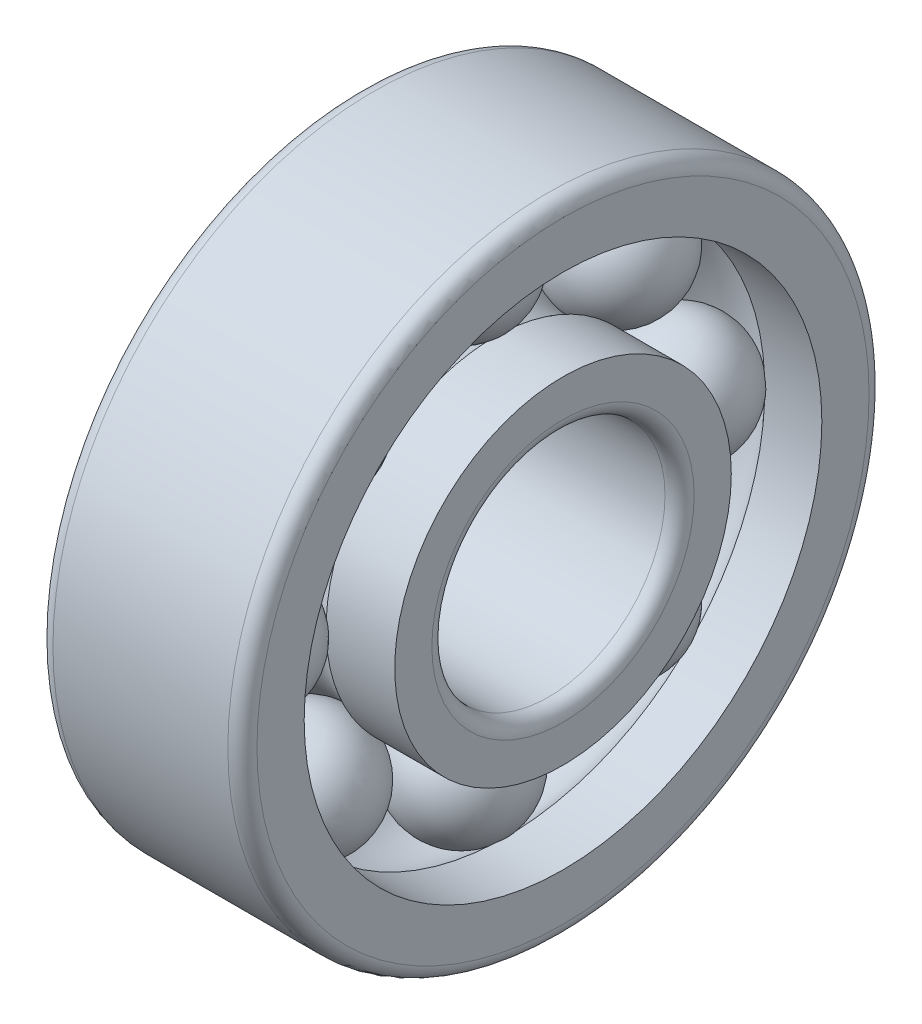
ISO-10303-21;
HEADER;
FILE_DESCRIPTION(('STEP AP214'),'2;1');
FILE_NAME('part.step','',(''),(''),'','','');
FILE_SCHEMA(('AUTOMOTIVE_DESIGN { 1 0 10303 214 1 1 1 1 }'));
ENDSEC;
DATA;
#1=APPLICATION_CONTEXT('core data for automotive mechanical design processes');
#2=APPLICATION_PROTOCOL_DEFINITION('international standard','automotive_design',2000,#1);
#3=PRODUCT_CONTEXT('',#1,'mechanical');
#4=PRODUCT('Part','Part','',(#3));
#5=PRODUCT_RELATED_PRODUCT_CATEGORY('part','',(#4));
#6=PRODUCT_DEFINITION_FORMATION('','',#4);
#7=PRODUCT_DEFINITION_CONTEXT('part definition',#1,'design');
#8=PRODUCT_DEFINITION('design','',#6,#7);
#9=PRODUCT_DEFINITION_SHAPE('','',#8);
#10=(LENGTH_UNIT() NAMED_UNIT(*) SI_UNIT(.MILLI.,.METRE.));
#11=(NAMED_UNIT(*) PLANE_ANGLE_UNIT() SI_UNIT($,.RADIAN.));
#12=(NAMED_UNIT(*) SI_UNIT($,.STERADIAN.) SOLID_ANGLE_UNIT());
#13=UNCERTAINTY_MEASURE_WITH_UNIT(LENGTH_MEASURE(1.E-05),#10,'distance_accuracy_value','');
#14=(GEOMETRIC_REPRESENTATION_CONTEXT(3) GLOBAL_UNCERTAINTY_ASSIGNED_CONTEXT((#13)) GLOBAL_UNIT_ASSIGNED_CONTEXT((#10,
#11,#12)) REPRESENTATION_CONTEXT('',''));
#15=CARTESIAN_POINT('',(0.,0.,0.));
#16=DIRECTION('',(0.,0.,1.));
#17=DIRECTION('',(1.,0.,0.));
#18=AXIS2_PLACEMENT_3D('',#15,#16,#17);
#19=CARTESIAN_POINT('',(5.,0.,0.));
#20=DIRECTION('',(1.,0.,0.));
#21=DIRECTION('',(0.,0.,-1.));
#22=AXIS2_PLACEMENT_3D('',#19,#20,#21);
#23=CYLINDRICAL_SURFACE('',#22,4.);
#24=CARTESIAN_POINT('',(3.,0.,0.));
#25=DIRECTION('',(1.,0.,0.));
#26=DIRECTION('',(0.,0.,-1.));
#27=AXIS2_PLACEMENT_3D('',#24,#25,#26);
#28=CIRCLE('',#27,4.);
#29=CARTESIAN_POINT('',(3.,0.,-4.));
#30=VERTEX_POINT('',#29);
#31=EDGE_CURVE('E1057',#30,#30,#28,.F.);
#32=ORIENTED_EDGE('',*,*,#31,.F.);
#33=EDGE_LOOP('',(#32));
#34=FACE_BOUND('',#33,.T.);
#35=CARTESIAN_POINT('',(-3.,0.,0.));
#36=DIRECTION('',(1.,0.,0.));
#37=DIRECTION('',(0.,0.,-1.));
#38=AXIS2_PLACEMENT_3D('',#35,#36,#37);
#39=CIRCLE('',#38,4.);
#40=CARTESIAN_POINT('',(-3.,0.,-4.));
#41=VERTEX_POINT('',#40);
#42=EDGE_CURVE('E1064',#41,#41,#39,.T.);
#43=ORIENTED_EDGE('',*,*,#42,.F.);
#44=EDGE_LOOP('',(#43));
#45=FACE_BOUND('',#44,.T.);
#46=ADVANCED_FACE('F16',(#34,#45),#23,.F.);
#47=CARTESIAN_POINT('',(-3.,0.,0.));
#48=DIRECTION('',(1.,0.,0.));
#49=DIRECTION('',(0.,0.,-1.));
#50=AXIS2_PLACEMENT_3D('',#47,#48,#49);
#51=TOROIDAL_SURFACE('',#50,4.5,0.5);
#52=CARTESIAN_POINT('',(-3.5,0.,0.));
#53=DIRECTION('',(-1.,0.,0.));
#54=DIRECTION('',(0.,0.,-1.));
#55=AXIS2_PLACEMENT_3D('',#52,#53,#54);
#56=CIRCLE('',#55,4.5);
#57=CARTESIAN_POINT('',(-3.5,0.,4.5));
#58=VERTEX_POINT('',#57);
#59=CARTESIAN_POINT('',(-3.5,0.,-4.5));
#60=VERTEX_POINT('',#59);
#61=EDGE_CURVE('E846',#58,#60,#56,.F.);
#62=ORIENTED_EDGE('',*,*,#61,.F.);
#63=CARTESIAN_POINT('',(-3.5,0.,0.));
#64=DIRECTION('',(-1.,0.,0.));
#65=DIRECTION('',(0.,0.,1.));
#66=AXIS2_PLACEMENT_3D('',#63,#64,#65);
#67=CIRCLE('',#66,4.5);
#68=EDGE_CURVE('E856',#60,#58,#67,.F.);
#69=ORIENTED_EDGE('',*,*,#68,.F.);
#70=EDGE_LOOP('',(#62,#69));
#71=FACE_BOUND('',#70,.T.);
#72=ORIENTED_EDGE('',*,*,#42,.T.);
#73=EDGE_LOOP('',(#72));
#74=FACE_BOUND('',#73,.T.);
#75=ADVANCED_FACE('F830',(#71,#74),#51,.T.);
#76=CARTESIAN_POINT('',(3.,0.,0.));
#77=DIRECTION('',(1.,0.,0.));
#78=DIRECTION('',(0.,0.,-1.));
#79=AXIS2_PLACEMENT_3D('',#76,#77,#78);
#80=TOROIDAL_SURFACE('',#79,4.5,0.5);
#81=ORIENTED_EDGE('',*,*,#31,.T.);
#82=EDGE_LOOP('',(#81));
#83=FACE_BOUND('',#82,.T.);
#84=CARTESIAN_POINT('',(3.5,0.,0.));
#85=DIRECTION('',(1.,0.,0.));
#86=DIRECTION('',(0.,0.,-1.));
#87=AXIS2_PLACEMENT_3D('',#84,#85,#86);
#88=CIRCLE('',#87,4.5);
#89=CARTESIAN_POINT('',(3.5,0.,4.5));
#90=VERTEX_POINT('',#89);
#91=CARTESIAN_POINT('',(3.5,0.,-4.5));
#92=VERTEX_POINT('',#91);
#93=EDGE_CURVE('E277',#90,#92,#88,.F.);
#94=ORIENTED_EDGE('',*,*,#93,.F.);
#95=CARTESIAN_POINT('',(3.5,0.,0.));
#96=DIRECTION('',(1.,0.,0.));
#97=DIRECTION('',(0.,0.,1.));
#98=AXIS2_PLACEMENT_3D('',#95,#96,#97);
#99=CIRCLE('',#98,4.5);
#100=EDGE_CURVE('E259',#92,#90,#99,.F.);
#101=ORIENTED_EDGE('',*,*,#100,.F.);
#102=EDGE_LOOP('',(#94,#101));
#103=FACE_BOUND('',#102,.T.);
#104=ADVANCED_FACE('F819',(#83,#103),#80,.T.);
#105=CARTESIAN_POINT('',(-3.5,4.5,0.));
#106=DIRECTION('',(-1.,0.,0.));
#107=DIRECTION('',(0.,0.,1.));
#108=AXIS2_PLACEMENT_3D('',#105,#106,#107);
#109=PLANE('',#108);
#110=ORIENTED_EDGE('',*,*,#61,.T.);
#111=ORIENTED_EDGE('',*,*,#68,.T.);
#112=EDGE_LOOP('',(#110,#111));
#113=FACE_BOUND('',#112,.T.);
#114=CARTESIAN_POINT('',(-3.5,0.,0.));
#115=DIRECTION('',(1.,0.,0.));
#116=DIRECTION('',(0.,0.,-1.));
#117=AXIS2_PLACEMENT_3D('',#114,#115,#116);
#118=CIRCLE('',#117,5.7741617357);
#119=CARTESIAN_POINT('',(-3.5,0.,-5.7741617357));
#120=VERTEX_POINT('',#119);
#121=EDGE_CURVE('E272',#120,#120,#118,.T.);
#122=ORIENTED_EDGE('',*,*,#121,.F.);
#123=EDGE_LOOP('',(#122));
#124=FACE_BOUND('',#123,.T.);
#125=ADVANCED_FACE('F829',(#113,#124),#109,.T.);
#126=CARTESIAN_POINT('',(0.,0.,0.));
#127=DIRECTION('',(1.,0.,0.));
#128=DIRECTION('',(0.,0.,-1.));
#129=AXIS2_PLACEMENT_3D('',#126,#127,#128);
#130=TOROIDAL_SURFACE('',#129,7.5,2.07100591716);
#131=CARTESIAN_POINT('',(1.14479159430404,5.76721671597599,-0.283116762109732));
#132=CARTESIAN_POINT('',(1.09621699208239,5.73499847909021,-0.282326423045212));
#133=CARTESIAN_POINT('',(1.0463103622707,5.70484710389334,-0.281583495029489));
#134=CARTESIAN_POINT('',(0.944126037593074,5.64884975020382,-0.2801989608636));
#135=CARTESIAN_POINT('',(0.891847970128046,5.62300445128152,-0.27955737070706));
#136=CARTESIAN_POINT('',(0.732254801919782,5.55234782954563,-0.277798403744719));
#137=CARTESIAN_POINT('',(0.621871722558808,5.51421122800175,-0.276841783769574));
#138=CARTESIAN_POINT('',(0.426007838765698,5.46451562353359,-0.275591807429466));
#139=CARTESIAN_POINT('',(0.341583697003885,5.44861035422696,-0.275190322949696));
#140=CARTESIAN_POINT('',(0.17143347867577,5.42738094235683,-0.27465404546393));
#141=CARTESIAN_POINT('',(0.0857082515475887,5.42205017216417,-0.274519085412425));
#142=CARTESIAN_POINT('',(-0.0703535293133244,5.42204815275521,-0.274519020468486));
#143=CARTESIAN_POINT('',(-0.14069562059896,5.42563833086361,-0.274609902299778));
#144=CARTESIAN_POINT('',(-0.280654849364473,5.43994668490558,-0.274971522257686));
#145=CARTESIAN_POINT('',(-0.350271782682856,5.45066681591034,-0.275242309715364));
#146=CARTESIAN_POINT('',(-0.53153816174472,5.48814614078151,-0.276186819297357));
#147=CARTESIAN_POINT('',(-0.642049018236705,5.52075446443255,-0.277006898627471));
#148=CARTESIAN_POINT('',(-0.818391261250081,5.58914868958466,-0.27871521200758));
#149=CARTESIAN_POINT('',(-0.886281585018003,5.61979514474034,-0.27947832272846));
#150=CARTESIAN_POINT('',(-1.01844533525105,5.68823414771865,-0.281173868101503));
#151=CARTESIAN_POINT('',(-1.08271498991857,5.7260339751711,-0.282106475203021));
#152=CARTESIAN_POINT('',(-1.14479159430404,5.76721671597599,-0.283116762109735));
#153=B_SPLINE_CURVE_WITH_KNOTS('',3,(#131,#132,#133,#134,#135,#136,#137,#138,#139,#140,#141,
#142,#143,#144,#145,#146,#147,#148,#149,#150,#151,#152),.UNSPECIFIED.,.F.,.F.,(4,2,2,2,2,2,2,2,
2,2,4),(0.,0.174762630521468,0.34955281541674,0.698035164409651,0.955173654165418,
1.21215092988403,1.42309045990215,1.63408785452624,1.97795867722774,2.20104198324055,
2.42435354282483),.UNSPECIFIED.);
#154=CARTESIAN_POINT('',(1.14479159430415,5.76721671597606,-0.283116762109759));
#155=VERTEX_POINT('',#154);
#156=CARTESIAN_POINT('',(-1.14479159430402,5.76721671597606,-0.283116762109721));
#157=VERTEX_POINT('',#156);
#158=EDGE_CURVE('E877',#155,#157,#153,.T.);
#159=ORIENTED_EDGE('',*,*,#158,.F.);
#160=CARTESIAN_POINT('',(1.144791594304,0.,0.));
#161=DIRECTION('',(1.,0.,0.));
#162=DIRECTION('',(0.,0.,-1.));
#163=AXIS2_PLACEMENT_3D('',#160,#161,#162);
#164=CIRCLE('',#163,5.7741617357);
#165=CARTESIAN_POINT('',(1.14479159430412,4.27823183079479,-3.87784426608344));
#166=VERTEX_POINT('',#165);
#167=EDGE_CURVE('E300',#166,#155,#164,.T.);
#168=ORIENTED_EDGE('',*,*,#167,.F.);
#169=CARTESIAN_POINT('',(-1.14479159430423,4.27823183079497,-3.87784426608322));
#170=CARTESIAN_POINT('',(-1.09621699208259,4.25489124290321,-3.85562138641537));
#171=CARTESIAN_POINT('',(-1.0463103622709,4.23304567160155,-3.8348264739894));
#172=CARTESIAN_POINT('',(-0.944126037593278,4.19247054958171,-3.7962093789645));
#173=CARTESIAN_POINT('',(-0.891847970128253,4.17374149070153,-3.77838766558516));
#174=CARTESIAN_POINT('',(-0.732254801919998,4.12253593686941,-3.72966966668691));
#175=CARTESIAN_POINT('',(-0.621871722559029,4.09489285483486,-3.70337944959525));
#176=CARTESIAN_POINT('',(-0.426007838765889,4.05886888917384,-3.66912321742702));
#177=CARTESIAN_POINT('',(-0.34158369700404,4.04733827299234,-3.65816038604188));
#178=CARTESIAN_POINT('',(-0.171433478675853,4.03194760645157,-3.64352813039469));
#179=CARTESIAN_POINT('',(-0.0857082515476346,4.02808275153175,-3.63985413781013));
#180=CARTESIAN_POINT('',(0.0703535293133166,4.02808127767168,-3.63985275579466));
#181=CARTESIAN_POINT('',(0.140695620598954,4.03068418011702,-3.64232713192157));
#182=CARTESIAN_POINT('',(0.28065484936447,4.04105741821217,-3.6521889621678));
#183=CARTESIAN_POINT('',(0.350271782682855,4.04882917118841,-3.6595777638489));
#184=CARTESIAN_POINT('',(0.531538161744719,4.07599892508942,-3.68541177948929));
#185=CARTESIAN_POINT('',(0.642049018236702,4.09963637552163,-3.70788946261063));
#186=CARTESIAN_POINT('',(0.818391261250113,4.14920635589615,-3.75504352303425));
#187=CARTESIAN_POINT('',(0.886281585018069,4.1714162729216,-3.77617423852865));
#188=CARTESIAN_POINT('',(1.01844533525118,4.22100888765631,-3.82336899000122));
#189=CARTESIAN_POINT('',(1.08271498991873,4.24839685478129,-3.84943805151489));
#190=CARTESIAN_POINT('',(1.14479159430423,4.27823183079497,-3.87784426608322));
#191=B_SPLINE_CURVE_WITH_KNOTS('',3,(#169,#170,#171,#172,#173,#174,#175,#176,#177,#178,#179,
#180,#181,#182,#183,#184,#185,#186,#187,#188,#189,#190),.UNSPECIFIED.,.F.,.F.,(4,2,2,2,2,2,2,2,
2,2,4),(0.,0.174762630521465,0.349552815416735,0.698035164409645,0.955173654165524,
1.21215092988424,1.42309045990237,1.63408785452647,1.97795867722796,2.20104198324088,
2.42435354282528),.UNSPECIFIED.);
#192=CARTESIAN_POINT('',(-1.14479159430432,4.27823183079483,-3.8778442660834));
#193=VERTEX_POINT('',#192);
#194=EDGE_CURVE('E882',#193,#166,#191,.T.);
#195=ORIENTED_EDGE('',*,*,#194,.F.);
#196=CARTESIAN_POINT('',(-1.144791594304,0.,0.));
#197=DIRECTION('',(1.,0.,0.));
#198=DIRECTION('',(0.,0.,-1.));
#199=AXIS2_PLACEMENT_3D('',#196,#197,#198);
#200=CIRCLE('',#199,5.7741617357);
#201=EDGE_CURVE('E286',#157,#193,#200,.F.);
#202=ORIENTED_EDGE('',*,*,#201,.F.);
#203=EDGE_LOOP('',(#159,#168,#195,#202));
#204=FACE_BOUND('',#203,.T.);
#205=ADVANCED_FACE('F869',(#204),#130,.F.);
#206=CARTESIAN_POINT('',(0.,0.,0.));
#207=DIRECTION('',(1.,0.,0.));
#208=DIRECTION('',(0.,0.,-1.));
#209=AXIS2_PLACEMENT_3D('',#206,#207,#208);
#210=TOROIDAL_SURFACE('',#209,7.5,2.07100591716);
#211=CARTESIAN_POINT('',(1.14479159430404,0.283116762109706,5.76721671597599));
#212=CARTESIAN_POINT('',(1.0962169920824,0.282326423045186,5.73499847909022));
#213=CARTESIAN_POINT('',(1.0463103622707,0.281583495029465,5.70484710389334));
#214=CARTESIAN_POINT('',(0.944126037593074,0.280198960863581,5.64884975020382));
#215=CARTESIAN_POINT('',(0.891847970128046,0.279557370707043,5.62300445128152));
#216=CARTESIAN_POINT('',(0.732254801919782,0.277798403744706,5.55234782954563));
#217=CARTESIAN_POINT('',(0.621871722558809,0.276841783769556,5.51421122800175));
#218=CARTESIAN_POINT('',(0.426007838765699,0.275591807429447,5.46451562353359));
#219=CARTESIAN_POINT('',(0.341583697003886,0.27519032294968,5.44861035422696));
#220=CARTESIAN_POINT('',(0.171433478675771,0.274654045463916,5.42738094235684));
#221=CARTESIAN_POINT('',(0.0857082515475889,0.274519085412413,5.42205017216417));
#222=CARTESIAN_POINT('',(-0.0703535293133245,0.274519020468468,5.42204815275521));
#223=CARTESIAN_POINT('',(-0.14069562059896,0.274609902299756,5.42563833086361));
#224=CARTESIAN_POINT('',(-0.280654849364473,0.274971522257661,5.43994668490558));
#225=CARTESIAN_POINT('',(-0.350271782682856,0.27524230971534,5.45066681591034));
#226=CARTESIAN_POINT('',(-0.53153816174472,0.276186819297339,5.48814614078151));
#227=CARTESIAN_POINT('',(-0.642049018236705,0.277006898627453,5.52075446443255));
#228=CARTESIAN_POINT('',(-0.81839126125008,0.278715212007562,5.58914868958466));
#229=CARTESIAN_POINT('',(-0.886281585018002,0.279478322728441,5.61979514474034));
#230=CARTESIAN_POINT('',(-1.01844533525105,0.281173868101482,5.68823414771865));
#231=CARTESIAN_POINT('',(-1.08271498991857,0.282106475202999,5.7260339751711));
#232=CARTESIAN_POINT('',(-1.14479159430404,0.283116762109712,5.76721671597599));
#233=B_SPLINE_CURVE_WITH_KNOTS('',3,(#211,#212,#213,#214,#215,#216,#217,#218,#219,#220,#221,
#222,#223,#224,#225,#226,#227,#228,#229,#230,#231,#232),.UNSPECIFIED.,.F.,.F.,(4,2,2,2,2,2,2,2,
2,2,4),(0.,0.174762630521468,0.34955281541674,0.69803516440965,0.955173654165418,
1.21215092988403,1.42309045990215,1.63408785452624,1.97795867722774,2.20104198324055,
2.42435354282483),.UNSPECIFIED.);
#234=CARTESIAN_POINT('',(1.14479159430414,0.283116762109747,5.76721671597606));
#235=VERTEX_POINT('',#234);
#236=CARTESIAN_POINT('',(-1.14479159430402,0.283116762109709,5.76721671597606));
#237=VERTEX_POINT('',#236);
#238=EDGE_CURVE('E456',#235,#237,#233,.T.);
#239=ORIENTED_EDGE('',*,*,#238,.F.);
#240=CARTESIAN_POINT('',(1.144791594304,0.,0.));
#241=DIRECTION('',(1.,0.,0.));
#242=DIRECTION('',(0.,0.,-1.));
#243=AXIS2_PLACEMENT_3D('',#240,#241,#242);
#244=CIRCLE('',#243,5.7741617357);
#245=CARTESIAN_POINT('',(1.14479159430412,3.87784426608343,4.27823183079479));
#246=VERTEX_POINT('',#245);
#247=EDGE_CURVE('E295',#246,#235,#244,.T.);
#248=ORIENTED_EDGE('',*,*,#247,.F.);
#249=CARTESIAN_POINT('',(-1.14479159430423,3.87784426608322,4.27823183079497));
#250=CARTESIAN_POINT('',(-1.09621699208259,3.85562138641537,4.2548912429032));
#251=CARTESIAN_POINT('',(-1.0463103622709,3.8348264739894,4.23304567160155));
#252=CARTESIAN_POINT('',(-0.944126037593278,3.7962093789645,4.19247054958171));
#253=CARTESIAN_POINT('',(-0.891847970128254,3.77838766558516,4.17374149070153));
#254=CARTESIAN_POINT('',(-0.732254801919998,3.72966966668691,4.1225359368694));
#255=CARTESIAN_POINT('',(-0.621871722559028,3.70337944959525,4.09489285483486));
#256=CARTESIAN_POINT('',(-0.426007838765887,3.66912321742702,4.05886888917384));
#257=CARTESIAN_POINT('',(-0.341583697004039,3.65816038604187,4.04733827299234));
#258=CARTESIAN_POINT('',(-0.171433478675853,3.64352813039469,4.03194760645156));
#259=CARTESIAN_POINT('',(-0.0857082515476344,3.63985413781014,4.02808275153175));
#260=CARTESIAN_POINT('',(0.0703535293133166,3.63985275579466,4.02808127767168));
#261=CARTESIAN_POINT('',(0.140695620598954,3.64232713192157,4.03068418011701));
#262=CARTESIAN_POINT('',(0.280654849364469,3.65218896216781,4.04105741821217));
#263=CARTESIAN_POINT('',(0.350271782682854,3.6595777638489,4.04882917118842));
#264=CARTESIAN_POINT('',(0.531538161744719,3.68541177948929,4.07599892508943));
#265=CARTESIAN_POINT('',(0.642049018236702,3.70788946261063,4.09963637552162));
#266=CARTESIAN_POINT('',(0.818391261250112,3.75504352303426,4.14920635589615));
#267=CARTESIAN_POINT('',(0.886281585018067,3.77617423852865,4.1714162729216));
#268=CARTESIAN_POINT('',(1.01844533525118,3.82336899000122,4.22100888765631));
#269=CARTESIAN_POINT('',(1.08271498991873,3.84943805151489,4.24839685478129));
#270=CARTESIAN_POINT('',(1.14479159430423,3.87784426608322,4.27823183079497));
#271=B_SPLINE_CURVE_WITH_KNOTS('',3,(#249,#250,#251,#252,#253,#254,#255,#256,#257,#258,#259,
#260,#261,#262,#263,#264,#265,#266,#267,#268,#269,#270),.UNSPECIFIED.,.F.,.F.,(4,2,2,2,2,2,2,2,
2,2,4),(0.,0.174762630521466,0.349552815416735,0.698035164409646,0.955173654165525,
1.21215092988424,1.42309045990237,1.63408785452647,1.97795867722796,2.20104198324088,
2.42435354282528),.UNSPECIFIED.);
#272=CARTESIAN_POINT('',(-1.14479159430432,3.87784426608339,4.27823183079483));
#273=VERTEX_POINT('',#272);
#274=EDGE_CURVE('E1312',#273,#246,#271,.T.);
#275=ORIENTED_EDGE('',*,*,#274,.F.);
#276=CARTESIAN_POINT('',(-1.144791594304,0.,0.));
#277=DIRECTION('',(1.,0.,0.));
#278=DIRECTION('',(0.,0.,-1.));
#279=AXIS2_PLACEMENT_3D('',#276,#277,#278);
#280=CIRCLE('',#279,5.7741617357);
#281=EDGE_CURVE('E290',#237,#273,#280,.F.);
#282=ORIENTED_EDGE('',*,*,#281,.F.);
#283=EDGE_LOOP('',(#239,#248,#275,#282));
#284=FACE_BOUND('',#283,.T.);
#285=ADVANCED_FACE('F872',(#284),#210,.F.);
#286=CARTESIAN_POINT('',(0.,0.,0.));
#287=DIRECTION('',(1.,0.,0.));
#288=DIRECTION('',(0.,0.,-1.));
#289=AXIS2_PLACEMENT_3D('',#286,#287,#288);
#290=TOROIDAL_SURFACE('',#289,7.5,2.07100591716);
#291=CARTESIAN_POINT('',(1.14479159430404,-5.76721671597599,0.283116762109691));
#292=CARTESIAN_POINT('',(1.09621699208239,-5.73499847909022,0.282326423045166));
#293=CARTESIAN_POINT('',(1.0463103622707,-5.70484710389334,0.281583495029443));
#294=CARTESIAN_POINT('',(0.944126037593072,-5.64884975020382,0.280198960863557));
#295=CARTESIAN_POINT('',(0.891847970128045,-5.62300445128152,0.27955737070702));
#296=CARTESIAN_POINT('',(0.73225480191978,-5.55234782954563,0.277798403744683));
#297=CARTESIAN_POINT('',(0.621871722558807,-5.51421122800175,0.276841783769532));
#298=CARTESIAN_POINT('',(0.426007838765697,-5.46451562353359,0.275591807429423));
#299=CARTESIAN_POINT('',(0.341583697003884,-5.44861035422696,0.275190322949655));
#300=CARTESIAN_POINT('',(0.17143347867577,-5.42738094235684,0.274654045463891));
#301=CARTESIAN_POINT('',(0.0857082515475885,-5.42205017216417,0.274519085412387));
#302=CARTESIAN_POINT('',(-0.0703535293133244,-5.42204815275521,0.274519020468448));
#303=CARTESIAN_POINT('',(-0.14069562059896,-5.42563833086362,0.27460990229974));
#304=CARTESIAN_POINT('',(-0.280654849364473,-5.43994668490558,0.274971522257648));
#305=CARTESIAN_POINT('',(-0.350271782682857,-5.45066681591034,0.275242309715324));
#306=CARTESIAN_POINT('',(-0.53153816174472,-5.48814614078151,0.276186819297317));
#307=CARTESIAN_POINT('',(-0.642049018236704,-5.52075446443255,0.277006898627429));
#308=CARTESIAN_POINT('',(-0.818391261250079,-5.58914868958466,0.278715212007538));
#309=CARTESIAN_POINT('',(-0.886281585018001,-5.61979514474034,0.279478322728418));
#310=CARTESIAN_POINT('',(-1.01844533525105,-5.68823414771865,0.28117386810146));
#311=CARTESIAN_POINT('',(-1.08271498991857,-5.7260339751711,0.282106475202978));
#312=CARTESIAN_POINT('',(-1.14479159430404,-5.76721671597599,0.283116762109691));
#313=B_SPLINE_CURVE_WITH_KNOTS('',3,(#291,#292,#293,#294,#295,#296,#297,#298,#299,#300,#301,
#302,#303,#304,#305,#306,#307,#308,#309,#310,#311,#312),.UNSPECIFIED.,.F.,.F.,(4,2,2,2,2,2,2,2,
2,2,4),(0.,0.174762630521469,0.349552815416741,0.698035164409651,0.955173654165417,
1.21215092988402,1.42309045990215,1.63408785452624,1.97795867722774,2.20104198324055,
2.42435354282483),.UNSPECIFIED.);
#314=CARTESIAN_POINT('',(1.14479159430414,-5.76721671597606,0.283116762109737));
#315=VERTEX_POINT('',#314);
#316=CARTESIAN_POINT('',(-1.14479159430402,-5.76721671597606,0.2831167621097));
#317=VERTEX_POINT('',#316);
#318=EDGE_CURVE('E634',#315,#317,#313,.T.);
#319=ORIENTED_EDGE('',*,*,#318,.F.);
#320=CARTESIAN_POINT('',(1.144791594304,0.,0.));
#321=DIRECTION('',(1.,0.,0.));
#322=DIRECTION('',(0.,0.,-1.));
#323=AXIS2_PLACEMENT_3D('',#320,#321,#322);
#324=CIRCLE('',#323,5.7741617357);
#325=CARTESIAN_POINT('',(1.14479159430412,-4.27823183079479,3.87784426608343));
#326=VERTEX_POINT('',#325);
#327=EDGE_CURVE('E313',#326,#315,#324,.T.);
#328=ORIENTED_EDGE('',*,*,#327,.F.);
#329=CARTESIAN_POINT('',(-1.14479159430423,-4.27823183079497,3.87784426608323));
#330=CARTESIAN_POINT('',(-1.09621699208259,-4.25489124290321,3.85562138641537));
#331=CARTESIAN_POINT('',(-1.0463103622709,-4.23304567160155,3.83482647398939));
#332=CARTESIAN_POINT('',(-0.944126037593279,-4.19247054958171,3.7962093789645));
#333=CARTESIAN_POINT('',(-0.891847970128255,-4.17374149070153,3.77838766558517));
#334=CARTESIAN_POINT('',(-0.732254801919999,-4.1225359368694,3.72966966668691));
#335=CARTESIAN_POINT('',(-0.62187172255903,-4.09489285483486,3.70337944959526));
#336=CARTESIAN_POINT('',(-0.426007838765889,-4.05886888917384,3.66912321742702));
#337=CARTESIAN_POINT('',(-0.34158369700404,-4.04733827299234,3.65816038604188));
#338=CARTESIAN_POINT('',(-0.171433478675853,-4.03194760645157,3.64352813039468));
#339=CARTESIAN_POINT('',(-0.0857082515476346,-4.02808275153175,3.63985413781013));
#340=CARTESIAN_POINT('',(0.0703535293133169,-4.02808127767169,3.63985275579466));
#341=CARTESIAN_POINT('',(0.140695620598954,-4.03068418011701,3.64232713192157));
#342=CARTESIAN_POINT('',(0.28065484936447,-4.04105741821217,3.65218896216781));
#343=CARTESIAN_POINT('',(0.350271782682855,-4.04882917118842,3.6595777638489));
#344=CARTESIAN_POINT('',(0.531538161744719,-4.07599892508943,3.68541177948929));
#345=CARTESIAN_POINT('',(0.642049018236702,-4.09963637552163,3.70788946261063));
#346=CARTESIAN_POINT('',(0.818391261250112,-4.14920635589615,3.75504352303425));
#347=CARTESIAN_POINT('',(0.886281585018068,-4.1714162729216,3.77617423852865));
#348=CARTESIAN_POINT('',(1.01844533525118,-4.22100888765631,3.82336899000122));
#349=CARTESIAN_POINT('',(1.08271498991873,-4.24839685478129,3.84943805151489));
#350=CARTESIAN_POINT('',(1.14479159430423,-4.27823183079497,3.87784426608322));
#351=B_SPLINE_CURVE_WITH_KNOTS('',3,(#329,#330,#331,#332,#333,#334,#335,#336,#337,#338,#339,
#340,#341,#342,#343,#344,#345,#346,#347,#348,#349,#350),.UNSPECIFIED.,.F.,.F.,(4,2,2,2,2,2,2,2,
2,2,4),(0.,0.174762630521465,0.349552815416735,0.698035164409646,0.955173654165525,
1.21215092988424,1.42309045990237,1.63408785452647,1.97795867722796,2.20104198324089,
2.42435354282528),.UNSPECIFIED.);
#352=CARTESIAN_POINT('',(-1.14479159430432,-4.27823183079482,3.8778442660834));
#353=VERTEX_POINT('',#352);
#354=EDGE_CURVE('E1327',#353,#326,#351,.T.);
#355=ORIENTED_EDGE('',*,*,#354,.F.);
#356=CARTESIAN_POINT('',(-1.144791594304,0.,0.));
#357=DIRECTION('',(1.,0.,0.));
#358=DIRECTION('',(0.,0.,-1.));
#359=AXIS2_PLACEMENT_3D('',#356,#357,#358);
#360=CIRCLE('',#359,5.7741617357);
#361=EDGE_CURVE('E284',#317,#353,#360,.F.);
#362=ORIENTED_EDGE('',*,*,#361,.F.);
#363=EDGE_LOOP('',(#319,#328,#355,#362));
#364=FACE_BOUND('',#363,.T.);
#365=ADVANCED_FACE('F1099',(#364),#290,.F.);
#366=CARTESIAN_POINT('',(0.,0.,0.));
#367=DIRECTION('',(1.,0.,0.));
#368=DIRECTION('',(0.,0.,-1.));
#369=AXIS2_PLACEMENT_3D('',#366,#367,#368);
#370=TOROIDAL_SURFACE('',#369,7.5,2.07100591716);
#371=CARTESIAN_POINT('',(1.14479159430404,-0.283116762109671,-5.76721671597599));
#372=CARTESIAN_POINT('',(1.09621699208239,-0.282326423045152,-5.73499847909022));
#373=CARTESIAN_POINT('',(1.0463103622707,-0.281583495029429,-5.70484710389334));
#374=CARTESIAN_POINT('',(0.944126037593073,-0.280198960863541,-5.64884975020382));
#375=CARTESIAN_POINT('',(0.891847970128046,-0.279557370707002,-5.62300445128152));
#376=CARTESIAN_POINT('',(0.732254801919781,-0.277798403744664,-5.55234782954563));
#377=CARTESIAN_POINT('',(0.621871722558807,-0.27684178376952,-5.51421122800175));
#378=CARTESIAN_POINT('',(0.426007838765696,-0.275591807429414,-5.46451562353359));
#379=CARTESIAN_POINT('',(0.341583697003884,-0.275190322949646,-5.44861035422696));
#380=CARTESIAN_POINT('',(0.17143347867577,-0.274654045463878,-5.42738094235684));
#381=CARTESIAN_POINT('',(0.0857082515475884,-0.274519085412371,-5.42205017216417));
#382=CARTESIAN_POINT('',(-0.0703535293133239,-0.274519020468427,-5.42204815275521));
#383=CARTESIAN_POINT('',(-0.140695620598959,-0.274609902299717,-5.42563833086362));
#384=CARTESIAN_POINT('',(-0.280654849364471,-0.274971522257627,-5.43994668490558));
#385=CARTESIAN_POINT('',(-0.350271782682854,-0.275242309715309,-5.45066681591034));
#386=CARTESIAN_POINT('',(-0.531538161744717,-0.276186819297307,-5.48814614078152));
#387=CARTESIAN_POINT('',(-0.642049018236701,-0.277006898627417,-5.52075446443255));
#388=CARTESIAN_POINT('',(-0.818391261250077,-0.278715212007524,-5.58914868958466));
#389=CARTESIAN_POINT('',(-0.886281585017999,-0.279478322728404,-5.61979514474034));
#390=CARTESIAN_POINT('',(-1.01844533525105,-0.281173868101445,-5.68823414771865));
#391=CARTESIAN_POINT('',(-1.08271498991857,-0.282106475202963,-5.7260339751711));
#392=CARTESIAN_POINT('',(-1.14479159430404,-0.283116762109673,-5.76721671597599));
#393=B_SPLINE_CURVE_WITH_KNOTS('',3,(#371,#372,#373,#374,#375,#376,#377,#378,#379,#380,#381,
#382,#383,#384,#385,#386,#387,#388,#389,#390,#391,#392),.UNSPECIFIED.,.F.,.F.,(4,2,2,2,2,2,2,2,
2,2,4),(0.,0.174762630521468,0.349552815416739,0.698035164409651,0.955173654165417,
1.21215092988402,1.42309045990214,1.63408785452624,1.97795867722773,2.20104198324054,
2.42435354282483),.UNSPECIFIED.);
#394=CARTESIAN_POINT('',(1.14479159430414,-0.283116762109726,-5.76721671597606));
#395=VERTEX_POINT('',#394);
#396=CARTESIAN_POINT('',(-1.14479159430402,-0.28311676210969,-5.76721671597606));
#397=VERTEX_POINT('',#396);
#398=EDGE_CURVE('E251',#395,#397,#393,.T.);
#399=ORIENTED_EDGE('',*,*,#398,.F.);
#400=CARTESIAN_POINT('',(1.144791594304,0.,0.));
#401=DIRECTION('',(1.,0.,0.));
#402=DIRECTION('',(0.,0.,-1.));
#403=AXIS2_PLACEMENT_3D('',#400,#401,#402);
#404=CIRCLE('',#403,5.7741617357);
#405=CARTESIAN_POINT('',(1.14479159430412,-3.87784426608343,-4.27823183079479));
#406=VERTEX_POINT('',#405);
#407=EDGE_CURVE('E310',#406,#395,#404,.T.);
#408=ORIENTED_EDGE('',*,*,#407,.F.);
#409=CARTESIAN_POINT('',(-1.14479159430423,-3.87784426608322,-4.27823183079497));
#410=CARTESIAN_POINT('',(-1.09621699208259,-3.85562138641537,-4.2548912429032));
#411=CARTESIAN_POINT('',(-1.0463103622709,-3.8348264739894,-4.23304567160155));
#412=CARTESIAN_POINT('',(-0.944126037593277,-3.7962093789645,-4.19247054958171));
#413=CARTESIAN_POINT('',(-0.891847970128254,-3.77838766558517,-4.17374149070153));
#414=CARTESIAN_POINT('',(-0.732254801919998,-3.72966966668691,-4.1225359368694));
#415=CARTESIAN_POINT('',(-0.621871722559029,-3.70337944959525,-4.09489285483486));
#416=CARTESIAN_POINT('',(-0.426007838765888,-3.66912321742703,-4.05886888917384));
#417=CARTESIAN_POINT('',(-0.34158369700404,-3.65816038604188,-4.04733827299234));
#418=CARTESIAN_POINT('',(-0.171433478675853,-3.64352813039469,-4.03194760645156));
#419=CARTESIAN_POINT('',(-0.0857082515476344,-3.63985413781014,-4.02808275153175));
#420=CARTESIAN_POINT('',(0.0703535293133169,-3.63985275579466,-4.02808127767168));
#421=CARTESIAN_POINT('',(0.140695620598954,-3.64232713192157,-4.03068418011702));
#422=CARTESIAN_POINT('',(0.28065484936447,-3.6521889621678,-4.04105741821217));
#423=CARTESIAN_POINT('',(0.350271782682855,-3.6595777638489,-4.04882917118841));
#424=CARTESIAN_POINT('',(0.53153816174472,-3.68541177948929,-4.07599892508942));
#425=CARTESIAN_POINT('',(0.642049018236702,-3.70788946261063,-4.09963637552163));
#426=CARTESIAN_POINT('',(0.818391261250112,-3.75504352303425,-4.14920635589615));
#427=CARTESIAN_POINT('',(0.886281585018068,-3.77617423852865,-4.1714162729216));
#428=CARTESIAN_POINT('',(1.01844533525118,-3.82336899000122,-4.2210088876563));
#429=CARTESIAN_POINT('',(1.08271498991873,-3.84943805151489,-4.24839685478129));
#430=CARTESIAN_POINT('',(1.14479159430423,-3.87784426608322,-4.27823183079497));
#431=B_SPLINE_CURVE_WITH_KNOTS('',3,(#409,#410,#411,#412,#413,#414,#415,#416,#417,#418,#419,
#420,#421,#422,#423,#424,#425,#426,#427,#428,#429,#430),.UNSPECIFIED.,.F.,.F.,(4,2,2,2,2,2,2,2,
2,2,4),(0.,0.174762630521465,0.349552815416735,0.698035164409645,0.955173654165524,
1.21215092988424,1.42309045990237,1.63408785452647,1.97795867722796,2.20104198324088,
2.42435354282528),.UNSPECIFIED.);
#432=CARTESIAN_POINT('',(-1.14479159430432,-3.87784426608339,-4.27823183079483));
#433=VERTEX_POINT('',#432);
#434=EDGE_CURVE('E246',#433,#406,#431,.T.);
#435=ORIENTED_EDGE('',*,*,#434,.F.);
#436=CARTESIAN_POINT('',(-1.144791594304,0.,0.));
#437=DIRECTION('',(1.,0.,0.));
#438=DIRECTION('',(0.,0.,-1.));
#439=AXIS2_PLACEMENT_3D('',#436,#437,#438);
#440=CIRCLE('',#439,5.7741617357);
#441=EDGE_CURVE('E267',#397,#433,#440,.F.);
#442=ORIENTED_EDGE('',*,*,#441,.F.);
#443=EDGE_LOOP('',(#399,#408,#435,#442));
#444=FACE_BOUND('',#443,.T.);
#445=ADVANCED_FACE('F275',(#444),#370,.F.);
#446=CARTESIAN_POINT('',(3.5,5.7741617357,0.));
#447=DIRECTION('',(1.,0.,0.));
#448=DIRECTION('',(0.,0.,-1.));
#449=AXIS2_PLACEMENT_3D('',#446,#447,#448);
#450=PLANE('',#449);
#451=ORIENTED_EDGE('',*,*,#100,.T.);
#452=ORIENTED_EDGE('',*,*,#93,.T.);
#453=EDGE_LOOP('',(#451,#452));
#454=FACE_BOUND('',#453,.T.);
#455=CARTESIAN_POINT('',(3.5,0.,0.));
#456=DIRECTION('',(1.,0.,0.));
#457=DIRECTION('',(0.,0.,-1.));
#458=AXIS2_PLACEMENT_3D('',#455,#456,#457);
#459=CIRCLE('',#458,5.7741617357);
#460=CARTESIAN_POINT('',(3.5,0.,-5.7741617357));
#461=VERTEX_POINT('',#460);
#462=EDGE_CURVE('E321',#461,#461,#459,.F.);
#463=ORIENTED_EDGE('',*,*,#462,.F.);
#464=EDGE_LOOP('',(#463));
#465=FACE_BOUND('',#464,.T.);
#466=ADVANCED_FACE('F1112',(#454,#465),#450,.T.);
#467=CARTESIAN_POINT('',(5.,0.,0.));
#468=DIRECTION('',(1.,0.,0.));
#469=DIRECTION('',(0.,0.,-1.));
#470=AXIS2_PLACEMENT_3D('',#467,#468,#469);
#471=CYLINDRICAL_SURFACE('',#470,5.7741617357);
#472=CARTESIAN_POINT('',(-1.14479159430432,0.,0.));
#473=DIRECTION('',(1.,0.,0.));
#474=DIRECTION('',(0.,0.,-1.));
#475=AXIS2_PLACEMENT_3D('',#472,#473,#474);
#476=CIRCLE('',#475,5.77416173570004);
#477=CARTESIAN_POINT('',(-1.14479159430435,-3.87784426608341,4.27823183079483));
#478=VERTEX_POINT('',#477);
#479=CARTESIAN_POINT('',(-1.14479159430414,-0.28311676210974,5.76721671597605));
#480=VERTEX_POINT('',#479);
#481=EDGE_CURVE('E307',#478,#480,#476,.F.);
#482=ORIENTED_EDGE('',*,*,#481,.T.);
#483=CARTESIAN_POINT('',(-1.14479159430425,-0.283116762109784,5.76721671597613));
#484=CARTESIAN_POINT('',(-1.15222151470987,-0.26001846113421,5.76835126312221));
#485=CARTESIAN_POINT('',(-1.15875687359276,-0.236633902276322,5.76935934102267));
#486=CARTESIAN_POINT('',(-1.16998549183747,-0.189414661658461,5.77110241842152));
#487=CARTESIAN_POINT('',(-1.1746785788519,-0.165579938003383,5.77183739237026));
#488=CARTESIAN_POINT('',(-1.18572458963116,-0.0947987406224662,5.77357254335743));
#489=CARTESIAN_POINT('',(-1.18942132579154,-0.0473993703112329,5.7741617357));
#490=CARTESIAN_POINT('',(-1.18942132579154,0.0473993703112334,5.7741617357));
#491=CARTESIAN_POINT('',(-1.18572458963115,0.0947987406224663,5.77357254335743));
#492=CARTESIAN_POINT('',(-1.1746785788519,0.165579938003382,5.77183739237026));
#493=CARTESIAN_POINT('',(-1.16998549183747,0.18941466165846,5.77110241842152));
#494=CARTESIAN_POINT('',(-1.15875687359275,0.236633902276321,5.76935934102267));
#495=CARTESIAN_POINT('',(-1.15222151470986,0.260018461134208,5.76835126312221));
#496=CARTESIAN_POINT('',(-1.14479159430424,0.283116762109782,5.76721671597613));
#497=B_SPLINE_CURVE_WITH_KNOTS('',3,(#483,#484,#485,#486,#487,#488,#489,#490,#491,#492,#493,
#494,#495,#496),.UNSPECIFIED.,.F.,.F.,(4,2,2,2,2,2,4),(0.,0.0728370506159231,0.145680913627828,
0.287701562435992,0.429722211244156,0.50256607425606,0.575403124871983),.UNSPECIFIED.);
#498=EDGE_CURVE('E294',#480,#237,#497,.T.);
#499=ORIENTED_EDGE('',*,*,#498,.T.);
#500=ORIENTED_EDGE('',*,*,#281,.T.);
#501=CARTESIAN_POINT('',(-1.14479159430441,3.87784426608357,4.27823183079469));
#502=CARTESIAN_POINT('',(-1.15222151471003,3.89497947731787,4.26270111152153));
#503=CARTESIAN_POINT('',(-1.15875687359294,3.91222767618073,4.24687855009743));
#504=CARTESIAN_POINT('',(-1.16998549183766,3.94684926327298,4.21472204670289));
#505=CARTESIAN_POINT('',(-1.1746785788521,3.96422266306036,4.19838805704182));
#506=CARTESIAN_POINT('',(-1.18572458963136,4.01549946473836,4.14956512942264));
#507=CARTESIAN_POINT('',(-1.18942132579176,4.04943250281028,4.11646533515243));
#508=CARTESIAN_POINT('',(-1.18942132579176,4.11646533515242,4.04943250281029));
#509=CARTESIAN_POINT('',(-1.18572458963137,4.14956512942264,4.01549946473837));
#510=CARTESIAN_POINT('',(-1.1746785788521,4.19838805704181,3.96422266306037));
#511=CARTESIAN_POINT('',(-1.16998549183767,4.21472204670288,3.94684926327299));
#512=CARTESIAN_POINT('',(-1.15875687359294,4.24687855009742,3.91222767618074));
#513=CARTESIAN_POINT('',(-1.15222151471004,4.26270111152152,3.89497947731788));
#514=CARTESIAN_POINT('',(-1.14479159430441,4.27823183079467,3.87784426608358));
#515=B_SPLINE_CURVE_WITH_KNOTS('',3,(#501,#502,#503,#504,#505,#506,#507,#508,#509,#510,#511,
#512,#513,#514),.UNSPECIFIED.,.F.,.F.,(4,2,2,2,2,2,4),(0.,0.072837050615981,0.145680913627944,
0.287701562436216,0.429722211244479,0.502566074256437,0.575403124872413),.UNSPECIFIED.);
#516=CARTESIAN_POINT('',(-1.14479159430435,4.27823183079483,3.87784426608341));
#517=VERTEX_POINT('',#516);
#518=EDGE_CURVE('E293',#273,#517,#515,.T.);
#519=ORIENTED_EDGE('',*,*,#518,.T.);
#520=CARTESIAN_POINT('',(-1.14479159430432,0.,0.));
#521=DIRECTION('',(1.,0.,0.));
#522=DIRECTION('',(0.,0.,-1.));
#523=AXIS2_PLACEMENT_3D('',#520,#521,#522);
#524=CIRCLE('',#523,5.77416173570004);
#525=CARTESIAN_POINT('',(-1.14479159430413,5.76721671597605,0.283116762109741));
#526=VERTEX_POINT('',#525);
#527=EDGE_CURVE('E298',#517,#526,#524,.F.);
#528=ORIENTED_EDGE('',*,*,#527,.T.);
#529=CARTESIAN_POINT('',(-1.14479159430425,5.76721671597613,0.283116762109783));
#530=CARTESIAN_POINT('',(-1.15222151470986,5.76835126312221,0.260018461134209));
#531=CARTESIAN_POINT('',(-1.15875687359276,5.76935934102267,0.236633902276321));
#532=CARTESIAN_POINT('',(-1.16998549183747,5.77110241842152,0.18941466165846));
#533=CARTESIAN_POINT('',(-1.1746785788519,5.77183739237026,0.165579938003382));
#534=CARTESIAN_POINT('',(-1.18572458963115,5.77357254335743,0.0947987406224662));
#535=CARTESIAN_POINT('',(-1.18942132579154,5.7741617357,0.0473993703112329));
#536=CARTESIAN_POINT('',(-1.18942132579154,5.7741617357,-0.0473993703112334));
#537=CARTESIAN_POINT('',(-1.18572458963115,5.77357254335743,-0.0947987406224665));
#538=CARTESIAN_POINT('',(-1.1746785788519,5.77183739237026,-0.165579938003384));
#539=CARTESIAN_POINT('',(-1.16998549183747,5.77110241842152,-0.189414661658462));
#540=CARTESIAN_POINT('',(-1.15875687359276,5.76935934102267,-0.236633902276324));
#541=CARTESIAN_POINT('',(-1.15222151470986,5.76835126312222,-0.260018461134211));
#542=CARTESIAN_POINT('',(-1.14479159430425,5.76721671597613,-0.283116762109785));
#543=B_SPLINE_CURVE_WITH_KNOTS('',3,(#529,#530,#531,#532,#533,#534,#535,#536,#537,#538,#539,
#540,#541,#542),.UNSPECIFIED.,.F.,.F.,(4,2,2,2,2,2,4),(0.,0.0728370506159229,0.145680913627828,
0.287701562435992,0.429722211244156,0.502566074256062,0.575403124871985),.UNSPECIFIED.);
#544=EDGE_CURVE('E289',#526,#157,#543,.T.);
#545=ORIENTED_EDGE('',*,*,#544,.T.);
#546=ORIENTED_EDGE('',*,*,#201,.T.);
#547=CARTESIAN_POINT('',(-1.14479159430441,4.27823183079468,-3.87784426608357));
#548=CARTESIAN_POINT('',(-1.15222151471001,4.26270111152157,-3.89497947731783));
#549=CARTESIAN_POINT('',(-1.1587568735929,4.24687855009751,-3.91222767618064));
#550=CARTESIAN_POINT('',(-1.16998549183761,4.21472204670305,-3.94684926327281));
#551=CARTESIAN_POINT('',(-1.17467857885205,4.19838805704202,-3.96422266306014));
#552=CARTESIAN_POINT('',(-1.18572458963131,4.14956512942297,-4.01549946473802));
#553=CARTESIAN_POINT('',(-1.18942132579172,4.11646533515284,-4.04943250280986));
#554=CARTESIAN_POINT('',(-1.18942132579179,4.04943250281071,-4.11646533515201));
#555=CARTESIAN_POINT('',(-1.18572458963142,4.01549946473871,-4.14956512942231));
#556=CARTESIAN_POINT('',(-1.17467857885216,3.96422266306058,-4.19838805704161));
#557=CARTESIAN_POINT('',(-1.16998549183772,3.94684926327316,-4.21472204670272));
#558=CARTESIAN_POINT('',(-1.15875687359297,3.91222767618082,-4.24687855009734));
#559=CARTESIAN_POINT('',(-1.15222151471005,3.89497947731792,-4.26270111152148));
#560=CARTESIAN_POINT('',(-1.14479159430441,3.87784426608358,-4.27823183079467));
#561=B_SPLINE_CURVE_WITH_KNOTS('',3,(#547,#548,#549,#550,#551,#552,#553,#554,#555,#556,#557,
#558,#559,#560),.UNSPECIFIED.,.F.,.F.,(4,2,2,2,2,2,4),(0.,0.0728370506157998,0.145680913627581,
0.28770156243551,0.429722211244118,0.502566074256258,0.575403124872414),.UNSPECIFIED.);
#562=CARTESIAN_POINT('',(-1.14479159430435,3.87784426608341,-4.27823183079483));
#563=VERTEX_POINT('',#562);
#564=EDGE_CURVE('E273',#193,#563,#561,.T.);
#565=ORIENTED_EDGE('',*,*,#564,.T.);
#566=CARTESIAN_POINT('',(-1.14479159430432,0.,0.));
#567=DIRECTION('',(1.,0.,0.));
#568=DIRECTION('',(0.,0.,-1.));
#569=AXIS2_PLACEMENT_3D('',#566,#567,#568);
#570=CIRCLE('',#569,5.77416173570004);
#571=CARTESIAN_POINT('',(-1.14479159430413,0.283116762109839,-5.76721671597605));
#572=VERTEX_POINT('',#571);
#573=EDGE_CURVE('E270',#563,#572,#570,.F.);
#574=ORIENTED_EDGE('',*,*,#573,.T.);
#575=CARTESIAN_POINT('',(-1.14479159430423,0.283116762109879,-5.76721671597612));
#576=CARTESIAN_POINT('',(-1.15222151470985,0.260018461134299,-5.76835126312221));
#577=CARTESIAN_POINT('',(-1.15875687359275,0.236633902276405,-5.76935934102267));
#578=CARTESIAN_POINT('',(-1.16998549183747,0.189414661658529,-5.77110241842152));
#579=CARTESIAN_POINT('',(-1.1746785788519,0.165579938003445,-5.77183739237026));
#580=CARTESIAN_POINT('',(-1.18572458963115,0.0947987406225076,-5.77357254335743));
#581=CARTESIAN_POINT('',(-1.18942132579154,0.0473993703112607,-5.7741617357));
#582=CARTESIAN_POINT('',(-1.18942132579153,-0.0473993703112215,-5.7741617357));
#583=CARTESIAN_POINT('',(-1.18572458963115,-0.0947987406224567,-5.77357254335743));
#584=CARTESIAN_POINT('',(-1.17467857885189,-0.165579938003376,-5.77183739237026));
#585=CARTESIAN_POINT('',(-1.16998549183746,-0.189414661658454,-5.77110241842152));
#586=CARTESIAN_POINT('',(-1.15875687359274,-0.236633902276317,-5.76935934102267));
#587=CARTESIAN_POINT('',(-1.15222151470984,-0.260018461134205,-5.76835126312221));
#588=CARTESIAN_POINT('',(-1.14479159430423,-0.28311676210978,-5.76721671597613));
#589=B_SPLINE_CURVE_WITH_KNOTS('',3,(#575,#576,#577,#578,#579,#580,#581,#582,#583,#584,#585,
#586,#587,#588),.UNSPECIFIED.,.F.,.F.,(4,2,2,2,2,2,4),(0.,0.0728370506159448,0.145680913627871,
0.287701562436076,0.429722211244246,0.502566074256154,0.575403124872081),.UNSPECIFIED.);
#590=EDGE_CURVE('E255',#572,#397,#589,.T.);
#591=ORIENTED_EDGE('',*,*,#590,.T.);
#592=ORIENTED_EDGE('',*,*,#441,.T.);
#593=CARTESIAN_POINT('',(-1.14479159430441,-3.87784426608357,-4.27823183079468));
#594=CARTESIAN_POINT('',(-1.15222151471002,-3.89497947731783,-4.26270111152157));
#595=CARTESIAN_POINT('',(-1.15875687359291,-3.91222767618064,-4.24687855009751));
#596=CARTESIAN_POINT('',(-1.16998549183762,-3.94684926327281,-4.21472204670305));
#597=CARTESIAN_POINT('',(-1.17467857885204,-3.96422266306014,-4.19838805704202));
#598=CARTESIAN_POINT('',(-1.18572458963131,-4.01549946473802,-4.14956512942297));
#599=CARTESIAN_POINT('',(-1.18942132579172,-4.04943250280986,-4.11646533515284));
#600=CARTESIAN_POINT('',(-1.18942132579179,-4.11646533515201,-4.04943250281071));
#601=CARTESIAN_POINT('',(-1.18572458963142,-4.14956512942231,-4.01549946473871));
#602=CARTESIAN_POINT('',(-1.17467857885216,-4.19838805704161,-3.96422266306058));
#603=CARTESIAN_POINT('',(-1.16998549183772,-4.21472204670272,-3.94684926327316));
#604=CARTESIAN_POINT('',(-1.15875687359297,-4.24687855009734,-3.91222767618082));
#605=CARTESIAN_POINT('',(-1.15222151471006,-4.26270111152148,-3.89497947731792));
#606=CARTESIAN_POINT('',(-1.14479159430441,-4.27823183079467,-3.87784426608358));
#607=B_SPLINE_CURVE_WITH_KNOTS('',3,(#593,#594,#595,#596,#597,#598,#599,#600,#601,#602,#603,
#604,#605,#606),.UNSPECIFIED.,.F.,.F.,(4,2,2,2,2,2,4),(0.,0.0728370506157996,0.145680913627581,
0.287701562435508,0.429722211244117,0.502566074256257,0.575403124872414),.UNSPECIFIED.);
#608=CARTESIAN_POINT('',(-1.14479159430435,-4.27823183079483,-3.87784426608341));
#609=VERTEX_POINT('',#608);
#610=EDGE_CURVE('E276',#433,#609,#607,.T.);
#611=ORIENTED_EDGE('',*,*,#610,.T.);
#612=CARTESIAN_POINT('',(-1.14479159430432,0.,0.));
#613=DIRECTION('',(1.,0.,0.));
#614=DIRECTION('',(0.,0.,-1.));
#615=AXIS2_PLACEMENT_3D('',#612,#613,#614);
#616=CIRCLE('',#615,5.77416173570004);
#617=CARTESIAN_POINT('',(-1.14479159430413,-5.76721671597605,-0.283116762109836));
#618=VERTEX_POINT('',#617);
#619=EDGE_CURVE('E318',#609,#618,#616,.F.);
#620=ORIENTED_EDGE('',*,*,#619,.T.);
#621=CARTESIAN_POINT('',(-1.14479159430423,-5.76721671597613,-0.283116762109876));
#622=CARTESIAN_POINT('',(-1.15222151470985,-5.76835126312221,-0.260018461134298));
#623=CARTESIAN_POINT('',(-1.15875687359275,-5.76935934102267,-0.236633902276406));
#624=CARTESIAN_POINT('',(-1.16998549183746,-5.77110241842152,-0.189414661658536));
#625=CARTESIAN_POINT('',(-1.1746785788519,-5.77183739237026,-0.165579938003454));
#626=CARTESIAN_POINT('',(-1.18572458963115,-5.77357254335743,-0.0947987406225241));
#627=CARTESIAN_POINT('',(-1.18942132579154,-5.7741617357,-0.0473993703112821));
#628=CARTESIAN_POINT('',(-1.18942132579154,-5.7741617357,0.0473993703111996));
#629=CARTESIAN_POINT('',(-1.18572458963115,-5.77357254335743,0.0947987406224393));
#630=CARTESIAN_POINT('',(-1.1746785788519,-5.77183739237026,0.165579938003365));
#631=CARTESIAN_POINT('',(-1.16998549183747,-5.77110241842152,0.189414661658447));
#632=CARTESIAN_POINT('',(-1.15875687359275,-5.76935934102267,0.236633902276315));
#633=CARTESIAN_POINT('',(-1.15222151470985,-5.76835126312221,0.260018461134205));
#634=CARTESIAN_POINT('',(-1.14479159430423,-5.76721671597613,0.283116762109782));
#635=B_SPLINE_CURVE_WITH_KNOTS('',3,(#621,#622,#623,#624,#625,#626,#627,#628,#629,#630,#631,
#632,#633,#634),.UNSPECIFIED.,.F.,.F.,(4,2,2,2,2,2,4),(0.,0.0728370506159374,0.145680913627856,
0.287701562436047,0.429722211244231,0.502566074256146,0.57540312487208),.UNSPECIFIED.);
#636=EDGE_CURVE('E279',#618,#317,#635,.T.);
#637=ORIENTED_EDGE('',*,*,#636,.T.);
#638=ORIENTED_EDGE('',*,*,#361,.T.);
#639=CARTESIAN_POINT('',(-1.14479159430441,-4.27823183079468,3.87784426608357));
#640=CARTESIAN_POINT('',(-1.15222151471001,-4.26270111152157,3.89497947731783));
#641=CARTESIAN_POINT('',(-1.1587568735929,-4.24687855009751,3.91222767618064));
#642=CARTESIAN_POINT('',(-1.16998549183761,-4.21472204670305,3.94684926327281));
#643=CARTESIAN_POINT('',(-1.17467857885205,-4.19838805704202,3.96422266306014));
#644=CARTESIAN_POINT('',(-1.18572458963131,-4.14956512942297,4.01549946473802));
#645=CARTESIAN_POINT('',(-1.18942132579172,-4.11646533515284,4.04943250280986));
#646=CARTESIAN_POINT('',(-1.18942132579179,-4.04943250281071,4.11646533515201));
#647=CARTESIAN_POINT('',(-1.18572458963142,-4.01549946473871,4.14956512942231));
#648=CARTESIAN_POINT('',(-1.17467857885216,-3.96422266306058,4.19838805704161));
#649=CARTESIAN_POINT('',(-1.16998549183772,-3.94684926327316,4.21472204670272));
#650=CARTESIAN_POINT('',(-1.15875687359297,-3.91222767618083,4.24687855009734));
#651=CARTESIAN_POINT('',(-1.15222151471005,-3.89497947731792,4.26270111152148));
#652=CARTESIAN_POINT('',(-1.14479159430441,-3.87784426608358,4.27823183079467));
#653=B_SPLINE_CURVE_WITH_KNOTS('',3,(#639,#640,#641,#642,#643,#644,#645,#646,#647,#648,#649,
#650,#651,#652),.UNSPECIFIED.,.F.,.F.,(4,2,2,2,2,2,4),(0.,0.0728370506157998,0.14568091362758,
0.287701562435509,0.429722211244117,0.502566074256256,0.575403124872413),.UNSPECIFIED.);
#654=EDGE_CURVE('E1297',#353,#478,#653,.T.);
#655=ORIENTED_EDGE('',*,*,#654,.T.);
#656=EDGE_LOOP('',(#482,#499,#500,#519,#528,#545,#546,#565,#574,#591,#592,#611,#620,#637,#638,#655));
#657=FACE_BOUND('',#656,.T.);
#658=ORIENTED_EDGE('',*,*,#121,.T.);
#659=EDGE_LOOP('',(#658));
#660=FACE_BOUND('',#659,.T.);
#661=ADVANCED_FACE('F264',(#657,#660),#471,.T.);
#662=CARTESIAN_POINT('',(5.,0.,0.));
#663=DIRECTION('',(1.,0.,0.));
#664=DIRECTION('',(0.,0.,-1.));
#665=AXIS2_PLACEMENT_3D('',#662,#663,#664);
#666=CYLINDRICAL_SURFACE('',#665,5.7741617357);
#667=ORIENTED_EDGE('',*,*,#462,.T.);
#668=EDGE_LOOP('',(#667));
#669=FACE_BOUND('',#668,.T.);
#670=CARTESIAN_POINT('',(1.14479159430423,-0.28311676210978,-5.76721671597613));
#671=CARTESIAN_POINT('',(1.15222151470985,-0.260018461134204,-5.76835126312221));
#672=CARTESIAN_POINT('',(1.15875687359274,-0.236633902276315,-5.76935934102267));
#673=CARTESIAN_POINT('',(1.16998549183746,-0.189414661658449,-5.77110241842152));
#674=CARTESIAN_POINT('',(1.17467857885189,-0.165579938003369,-5.77183739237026));
#675=CARTESIAN_POINT('',(1.18572458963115,-0.0947987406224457,-5.77357254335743));
#676=CARTESIAN_POINT('',(1.18942132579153,-0.0473993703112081,-5.7741617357));
#677=CARTESIAN_POINT('',(1.18942132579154,0.0473993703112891,-5.7741617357));
#678=CARTESIAN_POINT('',(1.18572458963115,0.0947987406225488,-5.77357254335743));
#679=CARTESIAN_POINT('',(1.17467857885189,0.165579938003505,-5.77183739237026));
#680=CARTESIAN_POINT('',(1.16998549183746,0.189414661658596,-5.77110241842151));
#681=CARTESIAN_POINT('',(1.15875687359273,0.236633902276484,-5.76935934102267));
#682=CARTESIAN_POINT('',(1.15222151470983,0.260018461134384,-5.76835126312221));
#683=CARTESIAN_POINT('',(1.14479159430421,0.28311676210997,-5.76721671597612));
#684=B_SPLINE_CURVE_WITH_KNOTS('',3,(#670,#671,#672,#673,#674,#675,#676,#677,#678,#679,#680,
#681,#682,#683),.UNSPECIFIED.,.F.,.F.,(4,2,2,2,2,2,4),(0.,0.0728370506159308,0.145680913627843,
0.287701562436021,0.429722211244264,0.502566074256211,0.575403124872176),.UNSPECIFIED.);
#685=CARTESIAN_POINT('',(1.14479159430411,0.283116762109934,-5.76721671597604));
#686=VERTEX_POINT('',#685);
#687=EDGE_CURVE('E257',#395,#686,#684,.T.);
#688=ORIENTED_EDGE('',*,*,#687,.T.);
#689=CARTESIAN_POINT('',(1.14479159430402,0.,0.));
#690=DIRECTION('',(1.,0.,0.));
#691=DIRECTION('',(0.,0.,-1.));
#692=AXIS2_PLACEMENT_3D('',#689,#690,#691);
#693=CIRCLE('',#692,5.77416173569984);
#694=CARTESIAN_POINT('',(1.14479159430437,3.87784426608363,-4.27823183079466));
#695=VERTEX_POINT('',#694);
#696=EDGE_CURVE('E323',#686,#695,#693,.T.);
#697=ORIENTED_EDGE('',*,*,#696,.T.);
#698=CARTESIAN_POINT('',(1.14479159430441,3.87784426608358,-4.27823183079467));
#699=CARTESIAN_POINT('',(1.15222151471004,3.89497947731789,-4.26270111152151));
#700=CARTESIAN_POINT('',(1.15875687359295,3.91222767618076,-4.24687855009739));
#701=CARTESIAN_POINT('',(1.16998549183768,3.94684926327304,-4.21472204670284));
#702=CARTESIAN_POINT('',(1.17467857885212,3.96422266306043,-4.19838805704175));
#703=CARTESIAN_POINT('',(1.18572458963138,4.01549946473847,-4.14956512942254));
#704=CARTESIAN_POINT('',(1.18942132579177,4.04943250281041,-4.1164653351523));
#705=CARTESIAN_POINT('',(1.18942132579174,4.11646533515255,-4.04943250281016));
#706=CARTESIAN_POINT('',(1.18572458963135,4.14956512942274,-4.01549946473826));
#707=CARTESIAN_POINT('',(1.17467857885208,4.19838805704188,-3.9642226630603));
#708=CARTESIAN_POINT('',(1.16998549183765,4.21472204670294,-3.94684926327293));
#709=CARTESIAN_POINT('',(1.15875687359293,4.24687855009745,-3.9122276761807));
#710=CARTESIAN_POINT('',(1.15222151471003,4.26270111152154,-3.89497947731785));
#711=CARTESIAN_POINT('',(1.14479159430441,4.27823183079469,-3.87784426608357));
#712=B_SPLINE_CURVE_WITH_KNOTS('',3,(#698,#699,#700,#701,#702,#703,#704,#705,#706,#707,#708,
#709,#710,#711),.UNSPECIFIED.,.F.,.F.,(4,2,2,2,2,2,4),(0.,0.0728370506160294,0.145680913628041,
0.287701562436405,0.429722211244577,0.502566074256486,0.575403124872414),.UNSPECIFIED.);
#713=EDGE_CURVE('E304',#695,#166,#712,.T.);
#714=ORIENTED_EDGE('',*,*,#713,.T.);
#715=ORIENTED_EDGE('',*,*,#167,.T.);
#716=CARTESIAN_POINT('',(1.14479159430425,5.76721671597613,-0.283116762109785));
#717=CARTESIAN_POINT('',(1.15222151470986,5.76835126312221,-0.260018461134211));
#718=CARTESIAN_POINT('',(1.15875687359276,5.76935934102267,-0.236633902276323));
#719=CARTESIAN_POINT('',(1.16998549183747,5.77110241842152,-0.189414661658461));
#720=CARTESIAN_POINT('',(1.1746785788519,5.77183739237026,-0.165579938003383));
#721=CARTESIAN_POINT('',(1.18572458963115,5.77357254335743,-0.0947987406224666));
#722=CARTESIAN_POINT('',(1.18942132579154,5.7741617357,-0.0473993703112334));
#723=CARTESIAN_POINT('',(1.18942132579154,5.7741617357,0.0473993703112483));
#724=CARTESIAN_POINT('',(1.18572458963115,5.77357254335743,0.0947987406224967));
#725=CARTESIAN_POINT('',(1.17467857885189,5.77183739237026,0.165579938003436));
#726=CARTESIAN_POINT('',(1.16998549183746,5.77110241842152,0.189414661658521));
#727=CARTESIAN_POINT('',(1.15875687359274,5.76935934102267,0.236633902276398));
#728=CARTESIAN_POINT('',(1.15222151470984,5.76835126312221,0.260018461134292));
#729=CARTESIAN_POINT('',(1.14479159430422,5.76721671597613,0.283116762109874));
#730=B_SPLINE_CURVE_WITH_KNOTS('',3,(#716,#717,#718,#719,#720,#721,#722,#723,#724,#725,#726,
#727,#728,#729),.UNSPECIFIED.,.F.,.F.,(4,2,2,2,2,2,4),(0.,0.0728370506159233,0.145680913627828,
0.287701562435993,0.429722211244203,0.502566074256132,0.575403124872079),.UNSPECIFIED.);
#731=CARTESIAN_POINT('',(1.14479159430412,5.76721671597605,0.283116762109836));
#732=VERTEX_POINT('',#731);
#733=EDGE_CURVE('E303',#155,#732,#730,.T.);
#734=ORIENTED_EDGE('',*,*,#733,.T.);
#735=CARTESIAN_POINT('',(1.14479159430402,0.,0.));
#736=DIRECTION('',(1.,0.,0.));
#737=DIRECTION('',(0.,0.,-1.));
#738=AXIS2_PLACEMENT_3D('',#735,#736,#737);
#739=CIRCLE('',#738,5.77416173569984);
#740=CARTESIAN_POINT('',(1.14479159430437,4.27823183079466,3.87784426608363));
#741=VERTEX_POINT('',#740);
#742=EDGE_CURVE('E587',#732,#741,#739,.T.);
#743=ORIENTED_EDGE('',*,*,#742,.T.);
#744=CARTESIAN_POINT('',(1.14479159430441,4.27823183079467,3.87784426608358));
#745=CARTESIAN_POINT('',(1.15222151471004,4.2627011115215,3.8949794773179));
#746=CARTESIAN_POINT('',(1.15875687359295,4.24687855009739,3.91222767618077));
#747=CARTESIAN_POINT('',(1.16998549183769,4.21472204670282,3.94684926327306));
#748=CARTESIAN_POINT('',(1.17467857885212,4.19838805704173,3.96422266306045));
#749=CARTESIAN_POINT('',(1.18572458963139,4.14956512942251,4.0154994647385));
#750=CARTESIAN_POINT('',(1.18942132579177,4.11646533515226,4.04943250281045));
#751=CARTESIAN_POINT('',(1.18942132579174,4.04943250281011,4.11646533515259));
#752=CARTESIAN_POINT('',(1.18572458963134,4.01549946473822,4.14956512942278));
#753=CARTESIAN_POINT('',(1.17467857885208,3.96422266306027,4.1983880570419));
#754=CARTESIAN_POINT('',(1.16998549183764,3.94684926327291,4.21472204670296));
#755=CARTESIAN_POINT('',(1.15875687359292,3.91222767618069,4.24687855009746));
#756=CARTESIAN_POINT('',(1.15222151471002,3.89497947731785,4.26270111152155));
#757=CARTESIAN_POINT('',(1.14479159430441,3.87784426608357,4.27823183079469));
#758=B_SPLINE_CURVE_WITH_KNOTS('',3,(#744,#745,#746,#747,#748,#749,#750,#751,#752,#753,#754,
#755,#756,#757),.UNSPECIFIED.,.F.,.F.,(4,2,2,2,2,2,4),(0.,0.0728370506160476,0.145680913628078,
0.28770156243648,0.429722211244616,0.502566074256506,0.575403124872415),.UNSPECIFIED.);
#759=EDGE_CURVE('E299',#741,#246,#758,.T.);
#760=ORIENTED_EDGE('',*,*,#759,.T.);
#761=ORIENTED_EDGE('',*,*,#247,.T.);
#762=CARTESIAN_POINT('',(1.14479159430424,0.283116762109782,5.76721671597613));
#763=CARTESIAN_POINT('',(1.15222151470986,0.260018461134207,5.76835126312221));
#764=CARTESIAN_POINT('',(1.15875687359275,0.236633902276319,5.76935934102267));
#765=CARTESIAN_POINT('',(1.16998549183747,0.189414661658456,5.77110241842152));
#766=CARTESIAN_POINT('',(1.1746785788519,0.165579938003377,5.77183739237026));
#767=CARTESIAN_POINT('',(1.18572458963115,0.0947987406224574,5.77357254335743));
#768=CARTESIAN_POINT('',(1.18942132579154,0.0473993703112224,5.7741617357));
#769=CARTESIAN_POINT('',(1.18942132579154,-0.0473993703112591,5.7741617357));
#770=CARTESIAN_POINT('',(1.18572458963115,-0.0947987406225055,5.77357254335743));
#771=CARTESIAN_POINT('',(1.17467857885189,-0.165579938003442,5.77183739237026));
#772=CARTESIAN_POINT('',(1.16998549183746,-0.189414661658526,5.77110241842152));
#773=CARTESIAN_POINT('',(1.15875687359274,-0.236633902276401,5.76935934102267));
#774=CARTESIAN_POINT('',(1.15222151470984,-0.260018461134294,5.76835126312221));
#775=CARTESIAN_POINT('',(1.14479159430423,-0.283116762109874,5.76721671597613));
#776=B_SPLINE_CURVE_WITH_KNOTS('',3,(#762,#763,#764,#765,#766,#767,#768,#769,#770,#771,#772,
#773,#774,#775),.UNSPECIFIED.,.F.,.F.,(4,2,2,2,2,2,4),(0.,0.0728370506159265,0.145680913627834,
0.287701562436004,0.429722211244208,0.502566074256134,0.575403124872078),.UNSPECIFIED.);
#777=CARTESIAN_POINT('',(1.14479159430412,-0.283116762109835,5.76721671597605));
#778=VERTEX_POINT('',#777);
#779=EDGE_CURVE('E309',#235,#778,#776,.T.);
#780=ORIENTED_EDGE('',*,*,#779,.T.);
#781=CARTESIAN_POINT('',(1.14479159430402,0.,0.));
#782=DIRECTION('',(1.,0.,0.));
#783=DIRECTION('',(0.,0.,-1.));
#784=AXIS2_PLACEMENT_3D('',#781,#782,#783);
#785=CIRCLE('',#784,5.77416173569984);
#786=CARTESIAN_POINT('',(1.14479159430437,-3.87784426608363,4.27823183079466));
#787=VERTEX_POINT('',#786);
#788=EDGE_CURVE('E588',#778,#787,#785,.T.);
#789=ORIENTED_EDGE('',*,*,#788,.T.);
#790=CARTESIAN_POINT('',(1.14479159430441,-3.87784426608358,4.27823183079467));
#791=CARTESIAN_POINT('',(1.15222151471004,-3.89497947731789,4.26270111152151));
#792=CARTESIAN_POINT('',(1.15875687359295,-3.91222767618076,4.2468785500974));
#793=CARTESIAN_POINT('',(1.16998549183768,-3.94684926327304,4.21472204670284));
#794=CARTESIAN_POINT('',(1.17467857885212,-3.96422266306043,4.19838805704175));
#795=CARTESIAN_POINT('',(1.18572458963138,-4.01549946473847,4.14956512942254));
#796=CARTESIAN_POINT('',(1.18942132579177,-4.04943250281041,4.1164653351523));
#797=CARTESIAN_POINT('',(1.18942132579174,-4.11646533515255,4.04943250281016));
#798=CARTESIAN_POINT('',(1.18572458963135,-4.14956512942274,4.01549946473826));
#799=CARTESIAN_POINT('',(1.17467857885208,-4.19838805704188,3.9642226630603));
#800=CARTESIAN_POINT('',(1.16998549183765,-4.21472204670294,3.94684926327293));
#801=CARTESIAN_POINT('',(1.15875687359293,-4.24687855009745,3.9122276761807));
#802=CARTESIAN_POINT('',(1.15222151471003,-4.26270111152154,3.89497947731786));
#803=CARTESIAN_POINT('',(1.14479159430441,-4.27823183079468,3.87784426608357));
#804=B_SPLINE_CURVE_WITH_KNOTS('',3,(#790,#791,#792,#793,#794,#795,#796,#797,#798,#799,#800,
#801,#802,#803),.UNSPECIFIED.,.F.,.F.,(4,2,2,2,2,2,4),(0.,0.0728370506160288,0.145680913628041,
0.287701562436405,0.429722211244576,0.502566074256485,0.575403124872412),.UNSPECIFIED.);
#805=EDGE_CURVE('E317',#787,#326,#804,.T.);
#806=ORIENTED_EDGE('',*,*,#805,.T.);
#807=ORIENTED_EDGE('',*,*,#327,.T.);
#808=CARTESIAN_POINT('',(1.14479159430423,-5.76721671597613,0.283116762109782));
#809=CARTESIAN_POINT('',(1.15222151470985,-5.76835126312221,0.260018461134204));
#810=CARTESIAN_POINT('',(1.15875687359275,-5.76935934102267,0.236633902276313));
#811=CARTESIAN_POINT('',(1.16998549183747,-5.77110241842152,0.189414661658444));
#812=CARTESIAN_POINT('',(1.1746785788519,-5.77183739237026,0.165579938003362));
#813=CARTESIAN_POINT('',(1.18572458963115,-5.77357254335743,0.0947987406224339));
#814=CARTESIAN_POINT('',(1.18942132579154,-5.7741617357,0.0473993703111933));
#815=CARTESIAN_POINT('',(1.18942132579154,-5.7741617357,-0.0473993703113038));
#816=CARTESIAN_POINT('',(1.18572458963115,-5.77357254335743,-0.0947987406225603));
#817=CARTESIAN_POINT('',(1.17467857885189,-5.77183739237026,-0.165579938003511));
#818=CARTESIAN_POINT('',(1.16998549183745,-5.77110241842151,-0.189414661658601));
#819=CARTESIAN_POINT('',(1.15875687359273,-5.76935934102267,-0.236633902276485));
#820=CARTESIAN_POINT('',(1.15222151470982,-5.76835126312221,-0.260018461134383));
#821=CARTESIAN_POINT('',(1.1447915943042,-5.76721671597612,-0.283116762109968));
#822=B_SPLINE_CURVE_WITH_KNOTS('',3,(#808,#809,#810,#811,#812,#813,#814,#815,#816,#817,#818,
#819,#820,#821),.UNSPECIFIED.,.F.,.F.,(4,2,2,2,2,2,4),(0.,0.0728370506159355,0.145680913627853,
0.28770156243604,0.429722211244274,0.502566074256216,0.575403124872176),.UNSPECIFIED.);
#823=CARTESIAN_POINT('',(1.14479159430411,-5.76721671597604,-0.283116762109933));
#824=VERTEX_POINT('',#823);
#825=EDGE_CURVE('E316',#315,#824,#822,.T.);
#826=ORIENTED_EDGE('',*,*,#825,.T.);
#827=CARTESIAN_POINT('',(1.14479159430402,0.,0.));
#828=DIRECTION('',(1.,0.,0.));
#829=DIRECTION('',(0.,0.,-1.));
#830=AXIS2_PLACEMENT_3D('',#827,#828,#829);
#831=CIRCLE('',#830,5.77416173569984);
#832=CARTESIAN_POINT('',(1.14479159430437,-4.27823183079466,-3.87784426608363));
#833=VERTEX_POINT('',#832);
#834=EDGE_CURVE('E355',#824,#833,#831,.T.);
#835=ORIENTED_EDGE('',*,*,#834,.T.);
#836=CARTESIAN_POINT('',(1.14479159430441,-4.27823183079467,-3.87784426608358));
#837=CARTESIAN_POINT('',(1.15222151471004,-4.26270111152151,-3.89497947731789));
#838=CARTESIAN_POINT('',(1.15875687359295,-4.2468785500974,-3.91222767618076));
#839=CARTESIAN_POINT('',(1.16998549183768,-4.21472204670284,-3.94684926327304));
#840=CARTESIAN_POINT('',(1.17467857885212,-4.19838805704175,-3.96422266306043));
#841=CARTESIAN_POINT('',(1.18572458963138,-4.14956512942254,-4.01549946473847));
#842=CARTESIAN_POINT('',(1.18942132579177,-4.1164653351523,-4.04943250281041));
#843=CARTESIAN_POINT('',(1.18942132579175,-4.04943250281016,-4.11646533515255));
#844=CARTESIAN_POINT('',(1.18572458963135,-4.01549946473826,-4.14956512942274));
#845=CARTESIAN_POINT('',(1.17467857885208,-3.9642226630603,-4.19838805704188));
#846=CARTESIAN_POINT('',(1.16998549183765,-3.94684926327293,-4.21472204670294));
#847=CARTESIAN_POINT('',(1.15875687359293,-3.9122276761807,-4.24687855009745));
#848=CARTESIAN_POINT('',(1.15222151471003,-3.89497947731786,-4.26270111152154));
#849=CARTESIAN_POINT('',(1.14479159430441,-3.87784426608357,-4.27823183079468));
#850=B_SPLINE_CURVE_WITH_KNOTS('',3,(#836,#837,#838,#839,#840,#841,#842,#843,#844,#845,#846,
#847,#848,#849),.UNSPECIFIED.,.F.,.F.,(4,2,2,2,2,2,4),(0.,0.0728370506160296,0.145680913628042,
0.287701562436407,0.429722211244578,0.502566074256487,0.575403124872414),.UNSPECIFIED.);
#851=EDGE_CURVE('E312',#833,#406,#850,.T.);
#852=ORIENTED_EDGE('',*,*,#851,.T.);
#853=ORIENTED_EDGE('',*,*,#407,.T.);
#854=EDGE_LOOP('',(#688,#697,#714,#715,#734,#743,#760,#761,#780,#789,#806,#807,#826,#835,#852,#853));
#855=FACE_BOUND('',#854,.T.);
#856=ADVANCED_FACE('F334',(#669,#855),#666,.T.);
#857=CARTESIAN_POINT('',(0.,0.,0.));
#858=DIRECTION('',(1.,0.,0.));
#859=DIRECTION('',(0.,0.,-1.));
#860=AXIS2_PLACEMENT_3D('',#857,#858,#859);
#861=TOROIDAL_SURFACE('',#860,7.5,2.07100591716);
#862=CARTESIAN_POINT('',(1.14479159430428,3.87784426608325,-4.27823183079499));
#863=CARTESIAN_POINT('',(1.09621699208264,3.85562138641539,-4.25489124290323));
#864=CARTESIAN_POINT('',(1.04631036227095,3.83482647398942,-4.23304567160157));
#865=CARTESIAN_POINT('',(0.944126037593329,3.79620937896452,-4.19247054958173));
#866=CARTESIAN_POINT('',(0.891847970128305,3.77838766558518,-4.17374149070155));
#867=CARTESIAN_POINT('',(0.732254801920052,3.72966966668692,-4.12253593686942));
#868=CARTESIAN_POINT('',(0.621871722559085,3.70337944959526,-4.09489285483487));
#869=CARTESIAN_POINT('',(0.426007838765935,3.66912321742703,-4.05886888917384));
#870=CARTESIAN_POINT('',(0.341583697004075,3.65816038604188,-4.04733827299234));
#871=CARTESIAN_POINT('',(0.171433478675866,3.64352813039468,-4.03194760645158));
#872=CARTESIAN_POINT('',(0.0857082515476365,3.6398541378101,-4.02808275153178));
#873=CARTESIAN_POINT('',(-0.0703535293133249,3.63985275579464,-4.02808127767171));
#874=CARTESIAN_POINT('',(-0.140695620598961,3.64232713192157,-4.03068418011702));
#875=CARTESIAN_POINT('',(-0.280654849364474,3.65218896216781,-4.04105741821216));
#876=CARTESIAN_POINT('',(-0.350271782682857,3.6595777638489,-4.04882917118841));
#877=CARTESIAN_POINT('',(-0.531538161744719,3.68541177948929,-4.07599892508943));
#878=CARTESIAN_POINT('',(-0.642049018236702,3.70788946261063,-4.09963637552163));
#879=CARTESIAN_POINT('',(-0.818391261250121,3.75504352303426,-4.14920635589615));
#880=CARTESIAN_POINT('',(-0.886281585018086,3.77617423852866,-4.1714162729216));
#881=CARTESIAN_POINT('',(-1.01844533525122,3.82336899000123,-4.22100888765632));
#882=CARTESIAN_POINT('',(-1.08271498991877,3.8494380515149,-4.24839685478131));
#883=CARTESIAN_POINT('',(-1.14479159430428,3.87784426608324,-4.278231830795));
#884=B_SPLINE_CURVE_WITH_KNOTS('',3,(#862,#863,#864,#865,#866,#867,#868,#869,#870,#871,#872,
#873,#874,#875,#876,#877,#878,#879,#880,#881,#882,#883),.UNSPECIFIED.,.F.,.F.,(4,2,2,2,2,2,2,2,
2,2,4),(0.,0.174762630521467,0.349552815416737,0.698035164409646,0.955173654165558,
1.21215092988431,1.42309045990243,1.63408785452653,1.97795867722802,2.20104198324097,
2.4243535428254),.UNSPECIFIED.);
#885=EDGE_CURVE('E342',#695,#563,#884,.T.);
#886=ORIENTED_EDGE('',*,*,#885,.F.);
#887=ORIENTED_EDGE('',*,*,#696,.F.);
#888=CARTESIAN_POINT('',(-1.14479159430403,0.283116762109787,-5.76721671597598));
#889=CARTESIAN_POINT('',(-1.09621699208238,0.282326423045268,-5.7349984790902));
#890=CARTESIAN_POINT('',(-1.04631036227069,0.281583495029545,-5.70484710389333));
#891=CARTESIAN_POINT('',(-0.944126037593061,0.280198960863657,-5.64884975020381));
#892=CARTESIAN_POINT('',(-0.891847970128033,0.279557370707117,-5.62300445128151));
#893=CARTESIAN_POINT('',(-0.732254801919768,0.277798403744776,-5.55234782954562));
#894=CARTESIAN_POINT('',(-0.621871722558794,0.276841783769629,-5.51421122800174));
#895=CARTESIAN_POINT('',(-0.426007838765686,0.275591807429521,-5.46451562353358));
#896=CARTESIAN_POINT('',(-0.341583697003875,0.275190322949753,-5.44861035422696));
#897=CARTESIAN_POINT('',(-0.171433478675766,0.274654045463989,-5.42738094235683));
#898=CARTESIAN_POINT('',(-0.0857082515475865,0.274519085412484,-5.42205017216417));
#899=CARTESIAN_POINT('',(0.070353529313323,0.274519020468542,-5.42204815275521));
#900=CARTESIAN_POINT('',(0.140695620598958,0.274609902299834,-5.42563833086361));
#901=CARTESIAN_POINT('',(0.280654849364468,0.274971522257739,-5.43994668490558));
#902=CARTESIAN_POINT('',(0.35027178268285,0.275242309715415,-5.45066681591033));
#903=CARTESIAN_POINT('',(0.531538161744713,0.276186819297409,-5.48814614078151));
#904=CARTESIAN_POINT('',(0.642049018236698,0.277006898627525,-5.52075446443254));
#905=CARTESIAN_POINT('',(0.818391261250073,0.278715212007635,-5.58914868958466));
#906=CARTESIAN_POINT('',(0.886281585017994,0.279478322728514,-5.61979514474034));
#907=CARTESIAN_POINT('',(1.01844533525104,0.281173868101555,-5.68823414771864));
#908=CARTESIAN_POINT('',(1.08271498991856,0.282106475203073,-5.72603397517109));
#909=CARTESIAN_POINT('',(1.14479159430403,0.283116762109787,-5.76721671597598));
#910=B_SPLINE_CURVE_WITH_KNOTS('',3,(#888,#889,#890,#891,#892,#893,#894,#895,#896,#897,#898,
#899,#900,#901,#902,#903,#904,#905,#906,#907,#908,#909),.UNSPECIFIED.,.F.,.F.,(4,2,2,2,2,2,2,2,
2,2,4),(0.,0.174762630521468,0.349552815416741,0.698035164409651,0.955173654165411,
1.21215092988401,1.42309045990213,1.63408785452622,1.97795867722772,2.20104198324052,
2.4243535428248),.UNSPECIFIED.);
#911=EDGE_CURVE('E349',#572,#686,#910,.T.);
#912=ORIENTED_EDGE('',*,*,#911,.F.);
#913=ORIENTED_EDGE('',*,*,#573,.F.);
#914=EDGE_LOOP('',(#886,#887,#912,#913));
#915=FACE_BOUND('',#914,.T.);
#916=ADVANCED_FACE('F328',(#915),#861,.F.);
#917=CARTESIAN_POINT('',(0.,0.,0.));
#918=DIRECTION('',(1.,0.,0.));
#919=DIRECTION('',(0.,0.,-1.));
#920=AXIS2_PLACEMENT_3D('',#917,#918,#919);
#921=TOROIDAL_SURFACE('',#920,7.5,2.07100591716);
#922=CARTESIAN_POINT('',(1.14479159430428,4.27823183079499,3.87784426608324));
#923=CARTESIAN_POINT('',(1.09621699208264,4.25489124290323,3.85562138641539));
#924=CARTESIAN_POINT('',(1.04631036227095,4.23304567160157,3.83482647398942));
#925=CARTESIAN_POINT('',(0.944126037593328,4.19247054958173,3.79620937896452));
#926=CARTESIAN_POINT('',(0.891847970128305,4.17374149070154,3.77838766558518));
#927=CARTESIAN_POINT('',(0.732254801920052,4.12253593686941,3.72966966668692));
#928=CARTESIAN_POINT('',(0.621871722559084,4.09489285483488,3.70337944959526));
#929=CARTESIAN_POINT('',(0.426007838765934,4.05886888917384,3.66912321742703));
#930=CARTESIAN_POINT('',(0.341583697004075,4.04733827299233,3.65816038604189));
#931=CARTESIAN_POINT('',(0.171433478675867,4.03194760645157,3.64352813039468));
#932=CARTESIAN_POINT('',(0.0857082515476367,4.02808275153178,3.63985413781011));
#933=CARTESIAN_POINT('',(-0.0703535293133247,4.02808127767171,3.63985275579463));
#934=CARTESIAN_POINT('',(-0.14069562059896,4.03068418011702,3.64232713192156));
#935=CARTESIAN_POINT('',(-0.280654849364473,4.04105741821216,3.65218896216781));
#936=CARTESIAN_POINT('',(-0.350271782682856,4.04882917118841,3.6595777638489));
#937=CARTESIAN_POINT('',(-0.531538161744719,4.07599892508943,3.68541177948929));
#938=CARTESIAN_POINT('',(-0.642049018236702,4.09963637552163,3.70788946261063));
#939=CARTESIAN_POINT('',(-0.818391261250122,4.14920635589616,3.75504352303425));
#940=CARTESIAN_POINT('',(-0.886281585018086,4.17141627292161,3.77617423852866));
#941=CARTESIAN_POINT('',(-1.01844533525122,4.22100888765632,3.82336899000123));
#942=CARTESIAN_POINT('',(-1.08271498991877,4.24839685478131,3.8494380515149));
#943=CARTESIAN_POINT('',(-1.14479159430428,4.27823183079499,3.87784426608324));
#944=B_SPLINE_CURVE_WITH_KNOTS('',3,(#922,#923,#924,#925,#926,#927,#928,#929,#930,#931,#932,
#933,#934,#935,#936,#937,#938,#939,#940,#941,#942,#943),.UNSPECIFIED.,.F.,.F.,(4,2,2,2,2,2,2,2,
2,2,4),(0.,0.174762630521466,0.349552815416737,0.698035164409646,0.955173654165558,
1.21215092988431,1.42309045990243,1.63408785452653,1.97795867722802,2.20104198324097,
2.4243535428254),.UNSPECIFIED.);
#945=EDGE_CURVE('E1006',#741,#517,#944,.T.);
#946=ORIENTED_EDGE('',*,*,#945,.F.);
#947=ORIENTED_EDGE('',*,*,#742,.F.);
#948=CARTESIAN_POINT('',(-1.14479159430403,5.76721671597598,0.283116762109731));
#949=CARTESIAN_POINT('',(-1.09621699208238,5.73499847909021,0.282326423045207));
#950=CARTESIAN_POINT('',(-1.04631036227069,5.70484710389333,0.281583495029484));
#951=CARTESIAN_POINT('',(-0.944126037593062,5.64884975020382,0.280198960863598));
#952=CARTESIAN_POINT('',(-0.891847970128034,5.62300445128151,0.27955737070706));
#953=CARTESIAN_POINT('',(-0.732254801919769,5.55234782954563,0.277798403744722));
#954=CARTESIAN_POINT('',(-0.621871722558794,5.51421122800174,0.276841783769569));
#955=CARTESIAN_POINT('',(-0.426007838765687,5.46451562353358,0.275591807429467));
#956=CARTESIAN_POINT('',(-0.341583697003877,5.44861035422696,0.275190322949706));
#957=CARTESIAN_POINT('',(-0.171433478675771,5.42738094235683,0.27465404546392));
#958=CARTESIAN_POINT('',(-0.0857082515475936,5.42205017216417,0.274519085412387));
#959=CARTESIAN_POINT('',(0.0703535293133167,5.42204815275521,0.274519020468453));
#960=CARTESIAN_POINT('',(0.140695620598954,5.42563833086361,0.274609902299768));
#961=CARTESIAN_POINT('',(0.28065484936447,5.43994668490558,0.274971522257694));
#962=CARTESIAN_POINT('',(0.350271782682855,5.45066681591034,0.275242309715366));
#963=CARTESIAN_POINT('',(0.53153816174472,5.48814614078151,0.276186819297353));
#964=CARTESIAN_POINT('',(0.642049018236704,5.52075446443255,0.27700689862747));
#965=CARTESIAN_POINT('',(0.818391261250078,5.58914868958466,0.27871521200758));
#966=CARTESIAN_POINT('',(0.886281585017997,5.61979514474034,0.279478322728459));
#967=CARTESIAN_POINT('',(1.01844533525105,5.68823414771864,0.281173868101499));
#968=CARTESIAN_POINT('',(1.08271498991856,5.72603397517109,0.282106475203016));
#969=CARTESIAN_POINT('',(1.14479159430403,5.76721671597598,0.28311676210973));
#970=B_SPLINE_CURVE_WITH_KNOTS('',3,(#948,#949,#950,#951,#952,#953,#954,#955,#956,#957,#958,
#959,#960,#961,#962,#963,#964,#965,#966,#967,#968,#969),.UNSPECIFIED.,.F.,.F.,(4,2,2,2,2,2,2,2,
2,2,4),(0.,0.174762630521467,0.349552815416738,0.69803516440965,0.955173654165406,
1.212150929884,1.42309045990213,1.63408785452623,1.97795867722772,2.20104198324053,
2.4243535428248),.UNSPECIFIED.);
#971=EDGE_CURVE('E1011',#526,#732,#970,.T.);
#972=ORIENTED_EDGE('',*,*,#971,.F.);
#973=ORIENTED_EDGE('',*,*,#527,.F.);
#974=EDGE_LOOP('',(#946,#947,#972,#973));
#975=FACE_BOUND('',#974,.T.);
#976=ADVANCED_FACE('F333',(#975),#921,.F.);
#977=CARTESIAN_POINT('',(0.,0.,0.));
#978=DIRECTION('',(1.,0.,0.));
#979=DIRECTION('',(0.,0.,-1.));
#980=AXIS2_PLACEMENT_3D('',#977,#978,#979);
#981=TOROIDAL_SURFACE('',#980,7.5,2.07100591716);
#982=CARTESIAN_POINT('',(1.14479159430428,-3.87784426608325,4.27823183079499));
#983=CARTESIAN_POINT('',(1.09621699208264,-3.85562138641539,4.25489124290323));
#984=CARTESIAN_POINT('',(1.04631036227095,-3.83482647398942,4.23304567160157));
#985=CARTESIAN_POINT('',(0.944126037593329,-3.79620937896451,4.19247054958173));
#986=CARTESIAN_POINT('',(0.891847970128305,-3.77838766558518,4.17374149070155));
#987=CARTESIAN_POINT('',(0.732254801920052,-3.72966966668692,4.12253593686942));
#988=CARTESIAN_POINT('',(0.621871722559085,-3.70337944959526,4.09489285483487));
#989=CARTESIAN_POINT('',(0.426007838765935,-3.66912321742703,4.05886888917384));
#990=CARTESIAN_POINT('',(0.341583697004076,-3.65816038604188,4.04733827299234));
#991=CARTESIAN_POINT('',(0.171433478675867,-3.64352813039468,4.03194760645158));
#992=CARTESIAN_POINT('',(0.085708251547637,-3.63985413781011,4.02808275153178));
#993=CARTESIAN_POINT('',(-0.0703535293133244,-3.63985275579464,4.02808127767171));
#994=CARTESIAN_POINT('',(-0.14069562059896,-3.64232713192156,4.03068418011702));
#995=CARTESIAN_POINT('',(-0.280654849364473,-3.65218896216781,4.04105741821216));
#996=CARTESIAN_POINT('',(-0.350271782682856,-3.6595777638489,4.04882917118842));
#997=CARTESIAN_POINT('',(-0.531538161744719,-3.68541177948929,4.07599892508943));
#998=CARTESIAN_POINT('',(-0.642049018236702,-3.70788946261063,4.09963637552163));
#999=CARTESIAN_POINT('',(-0.818391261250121,-3.75504352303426,4.14920635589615));
#1000=CARTESIAN_POINT('',(-0.886281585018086,-3.77617423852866,4.1714162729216));
#1001=CARTESIAN_POINT('',(-1.01844533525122,-3.82336899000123,4.22100888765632));
#1002=CARTESIAN_POINT('',(-1.08271498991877,-3.8494380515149,4.24839685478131));
#1003=CARTESIAN_POINT('',(-1.14479159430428,-3.87784426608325,4.27823183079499));
#1004=B_SPLINE_CURVE_WITH_KNOTS('',3,(#982,#983,#984,#985,#986,#987,#988,#989,#990,#991,#992,
#993,#994,#995,#996,#997,#998,#999,#1000,#1001,#1002,#1003),.UNSPECIFIED.,.F.,.F.,(4,2,2,2,2,2,
2,2,2,2,4),(0.,0.174762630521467,0.349552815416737,0.698035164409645,0.955173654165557,
1.21215092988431,1.42309045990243,1.63408785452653,1.97795867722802,2.20104198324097,
2.4243535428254),.UNSPECIFIED.);
#1005=EDGE_CURVE('E564',#787,#478,#1004,.T.);
#1006=ORIENTED_EDGE('',*,*,#1005,.F.);
#1007=ORIENTED_EDGE('',*,*,#788,.F.);
#1008=CARTESIAN_POINT('',(-1.14479159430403,-0.283116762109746,5.76721671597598));
#1009=CARTESIAN_POINT('',(-1.09621699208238,-0.282326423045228,5.73499847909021));
#1010=CARTESIAN_POINT('',(-1.04631036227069,-0.281583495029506,5.70484710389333));
#1011=CARTESIAN_POINT('',(-0.944126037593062,-0.280198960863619,5.64884975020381));
#1012=CARTESIAN_POINT('',(-0.891847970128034,-0.279557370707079,5.62300445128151));
#1013=CARTESIAN_POINT('',(-0.73225480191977,-0.277798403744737,5.55234782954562));
#1014=CARTESIAN_POINT('',(-0.621871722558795,-0.276841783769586,5.51421122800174));
#1015=CARTESIAN_POINT('',(-0.426007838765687,-0.27559180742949,5.46451562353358));
#1016=CARTESIAN_POINT('',(-0.341583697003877,-0.275190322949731,5.44861035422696));
#1017=CARTESIAN_POINT('',(-0.171433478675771,-0.274654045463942,5.42738094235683));
#1018=CARTESIAN_POINT('',(-0.0857082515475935,-0.274519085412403,5.42205017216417));
#1019=CARTESIAN_POINT('',(0.0703535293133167,-0.274519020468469,5.42204815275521));
#1020=CARTESIAN_POINT('',(0.140695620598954,-0.274609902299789,5.42563833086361));
#1021=CARTESIAN_POINT('',(0.28065484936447,-0.274971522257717,5.43994668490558));
#1022=CARTESIAN_POINT('',(0.350271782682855,-0.275242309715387,5.45066681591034));
#1023=CARTESIAN_POINT('',(0.53153816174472,-0.276186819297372,5.48814614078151));
#1024=CARTESIAN_POINT('',(0.642049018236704,-0.27700689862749,5.52075446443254));
#1025=CARTESIAN_POINT('',(0.818391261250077,-0.278715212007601,5.58914868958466));
#1026=CARTESIAN_POINT('',(0.886281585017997,-0.27947832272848,5.61979514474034));
#1027=CARTESIAN_POINT('',(1.01844533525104,-0.281173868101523,5.68823414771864));
#1028=CARTESIAN_POINT('',(1.08271498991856,-0.282106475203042,5.72603397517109));
#1029=CARTESIAN_POINT('',(1.14479159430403,-0.283116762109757,5.76721671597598));
#1030=B_SPLINE_CURVE_WITH_KNOTS('',3,(#1008,#1009,#1010,#1011,#1012,#1013,#1014,#1015,#1016,
#1017,#1018,#1019,#1020,#1021,#1022,#1023,#1024,#1025,#1026,#1027,#1028,#1029),.UNSPECIFIED.,
.F.,.F.,(4,2,2,2,2,2,2,2,2,2,4),(0.,0.174762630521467,0.349552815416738,0.698035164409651,
0.955173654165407,1.212150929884,1.42309045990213,1.63408785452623,1.97795867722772,
2.20104198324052,2.4243535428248),.UNSPECIFIED.);
#1031=EDGE_CURVE('E478',#480,#778,#1030,.T.);
#1032=ORIENTED_EDGE('',*,*,#1031,.F.);
#1033=ORIENTED_EDGE('',*,*,#481,.F.);
#1034=EDGE_LOOP('',(#1006,#1007,#1032,#1033));
#1035=FACE_BOUND('',#1034,.T.);
#1036=ADVANCED_FACE('F575',(#1035),#981,.F.);
#1037=CARTESIAN_POINT('',(0.,0.,0.));
#1038=DIRECTION('',(1.,0.,0.));
#1039=DIRECTION('',(0.,0.,-1.));
#1040=AXIS2_PLACEMENT_3D('',#1037,#1038,#1039);
#1041=TOROIDAL_SURFACE('',#1040,7.5,2.07100591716);
#1042=CARTESIAN_POINT('',(1.14479159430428,-4.27823183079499,-3.87784426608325));
#1043=CARTESIAN_POINT('',(1.09621699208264,-4.25489124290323,-3.85562138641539));
#1044=CARTESIAN_POINT('',(1.04631036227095,-4.23304567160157,-3.83482647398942));
#1045=CARTESIAN_POINT('',(0.944126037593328,-4.19247054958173,-3.79620937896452));
#1046=CARTESIAN_POINT('',(0.891847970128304,-4.17374149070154,-3.77838766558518));
#1047=CARTESIAN_POINT('',(0.732254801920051,-4.12253593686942,-3.72966966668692));
#1048=CARTESIAN_POINT('',(0.621871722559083,-4.09489285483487,-3.70337944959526));
#1049=CARTESIAN_POINT('',(0.426007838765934,-4.05886888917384,-3.66912321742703));
#1050=CARTESIAN_POINT('',(0.341583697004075,-4.04733827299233,-3.65816038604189));
#1051=CARTESIAN_POINT('',(0.171433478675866,-4.03194760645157,-3.64352813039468));
#1052=CARTESIAN_POINT('',(0.0857082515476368,-4.02808275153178,-3.63985413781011));
#1053=CARTESIAN_POINT('',(-0.0703535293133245,-4.02808127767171,-3.63985275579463));
#1054=CARTESIAN_POINT('',(-0.14069562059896,-4.03068418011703,-3.64232713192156));
#1055=CARTESIAN_POINT('',(-0.280654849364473,-4.04105741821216,-3.65218896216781));
#1056=CARTESIAN_POINT('',(-0.350271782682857,-4.04882917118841,-3.6595777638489));
#1057=CARTESIAN_POINT('',(-0.531538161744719,-4.07599892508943,-3.68541177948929));
#1058=CARTESIAN_POINT('',(-0.642049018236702,-4.09963637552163,-3.70788946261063));
#1059=CARTESIAN_POINT('',(-0.818391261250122,-4.14920635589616,-3.75504352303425));
#1060=CARTESIAN_POINT('',(-0.886281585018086,-4.17141627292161,-3.77617423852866));
#1061=CARTESIAN_POINT('',(-1.01844533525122,-4.22100888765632,-3.82336899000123));
#1062=CARTESIAN_POINT('',(-1.08271498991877,-4.24839685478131,-3.84943805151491));
#1063=CARTESIAN_POINT('',(-1.14479159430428,-4.27823183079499,-3.87784426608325));
#1064=B_SPLINE_CURVE_WITH_KNOTS('',3,(#1042,#1043,#1044,#1045,#1046,#1047,#1048,#1049,#1050,
#1051,#1052,#1053,#1054,#1055,#1056,#1057,#1058,#1059,#1060,#1061,#1062,#1063),.UNSPECIFIED.,
.F.,.F.,(4,2,2,2,2,2,2,2,2,2,4),(0.,0.174762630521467,0.349552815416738,0.698035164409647,
0.955173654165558,1.21215092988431,1.42309045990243,1.63408785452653,1.97795867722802,
2.20104198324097,2.4243535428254),.UNSPECIFIED.);
#1065=EDGE_CURVE('E600',#833,#609,#1064,.T.);
#1066=ORIENTED_EDGE('',*,*,#1065,.F.);
#1067=ORIENTED_EDGE('',*,*,#834,.F.);
#1068=CARTESIAN_POINT('',(-1.14479159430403,-5.76721671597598,-0.28311676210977));
#1069=CARTESIAN_POINT('',(-1.09621699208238,-5.7349984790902,-0.282326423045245));
#1070=CARTESIAN_POINT('',(-1.04631036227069,-5.70484710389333,-0.281583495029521));
#1071=CARTESIAN_POINT('',(-0.944126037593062,-5.64884975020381,-0.280198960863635));
#1072=CARTESIAN_POINT('',(-0.891847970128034,-5.62300445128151,-0.279557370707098));
#1073=CARTESIAN_POINT('',(-0.732254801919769,-5.55234782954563,-0.277798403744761));
#1074=CARTESIAN_POINT('',(-0.621871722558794,-5.51421122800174,-0.276841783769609));
#1075=CARTESIAN_POINT('',(-0.426007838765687,-5.46451562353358,-0.275591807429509));
#1076=CARTESIAN_POINT('',(-0.341583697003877,-5.44861035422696,-0.275190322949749));
#1077=CARTESIAN_POINT('',(-0.171433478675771,-5.42738094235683,-0.274654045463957));
#1078=CARTESIAN_POINT('',(-0.0857082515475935,-5.42205017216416,-0.274519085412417));
#1079=CARTESIAN_POINT('',(0.0703535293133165,-5.4220481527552,-0.274519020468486));
#1080=CARTESIAN_POINT('',(0.140695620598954,-5.42563833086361,-0.274609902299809));
#1081=CARTESIAN_POINT('',(0.280654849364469,-5.43994668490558,-0.274971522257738));
#1082=CARTESIAN_POINT('',(0.350271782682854,-5.45066681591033,-0.275242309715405));
#1083=CARTESIAN_POINT('',(0.53153816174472,-5.48814614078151,-0.276186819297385));
#1084=CARTESIAN_POINT('',(0.642049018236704,-5.52075446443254,-0.277006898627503));
#1085=CARTESIAN_POINT('',(0.818391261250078,-5.58914868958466,-0.278715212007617));
#1086=CARTESIAN_POINT('',(0.886281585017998,-5.61979514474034,-0.279478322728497));
#1087=CARTESIAN_POINT('',(1.01844533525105,-5.68823414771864,-0.28117386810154));
#1088=CARTESIAN_POINT('',(1.08271498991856,-5.72603397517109,-0.282106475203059));
#1089=CARTESIAN_POINT('',(1.14479159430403,-5.76721671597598,-0.283116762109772));
#1090=B_SPLINE_CURVE_WITH_KNOTS('',3,(#1068,#1069,#1070,#1071,#1072,#1073,#1074,#1075,#1076,
#1077,#1078,#1079,#1080,#1081,#1082,#1083,#1084,#1085,#1086,#1087,#1088,#1089),.UNSPECIFIED.,
.F.,.F.,(4,2,2,2,2,2,2,2,2,2,4),(0.,0.174762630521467,0.349552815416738,0.698035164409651,
0.955173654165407,1.212150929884,1.42309045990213,1.63408785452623,1.97795867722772,
2.20104198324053,2.4243535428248),.UNSPECIFIED.);
#1091=EDGE_CURVE('E605',#618,#824,#1090,.T.);
#1092=ORIENTED_EDGE('',*,*,#1091,.F.);
#1093=ORIENTED_EDGE('',*,*,#619,.F.);
#1094=EDGE_LOOP('',(#1066,#1067,#1092,#1093));
#1095=FACE_BOUND('',#1094,.T.);
#1096=ADVANCED_FACE('F579',(#1095),#1041,.F.);
#1097=CARTESIAN_POINT('',(0.,5.303300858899,-5.303300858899));
#1098=DIRECTION('',(0.,0.707106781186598,-0.707106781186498));
#1099=DIRECTION('',(1.,0.,0.));
#1100=AXIS2_PLACEMENT_3D('',#1097,#1098,#1099);
#1101=SPHERICAL_SURFACE('',#1100,2.09600591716);
#1102=CARTESIAN_POINT('',(-1.54363667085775,6.52297038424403,-6.0263726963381));
#1103=CARTESIAN_POINT('',(-1.55480367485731,6.48354552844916,-6.06905672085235));
#1104=CARTESIAN_POINT('',(-1.5631752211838,6.44332971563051,-6.11173571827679));
#1105=CARTESIAN_POINT('',(-1.57425707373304,6.36206690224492,-6.19627225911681));
#1106=CARTESIAN_POINT('',(-1.57701917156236,6.32103107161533,-6.23813375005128));
#1107=CARTESIAN_POINT('',(-1.57701917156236,6.23813375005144,-6.32103107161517));
#1108=CARTESIAN_POINT('',(-1.57425707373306,6.19627225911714,-6.3620669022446));
#1109=CARTESIAN_POINT('',(-1.56317522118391,6.11173571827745,-6.44332971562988));
#1110=CARTESIAN_POINT('',(-1.55480367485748,6.06905672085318,-6.48354552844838));
#1111=CARTESIAN_POINT('',(-1.54363667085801,6.0263726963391,-6.52297038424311));
#1112=B_SPLINE_CURVE_WITH_KNOTS('',3,(#1102,#1103,#1104,#1105,#1106,#1107,#1108,#1109,#1110,
#1111),.UNSPECIFIED.,.F.,.F.,(4,2,2,2,4),(0.,0.177429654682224,0.353213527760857,
0.5289974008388,0.70642705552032),.UNSPECIFIED.);
#1113=CARTESIAN_POINT('',(-1.5436366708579,6.52297038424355,-6.0263726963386));
#1114=VERTEX_POINT('',#1113);
#1115=CARTESIAN_POINT('',(-1.54363667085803,6.0263726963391,-6.52297038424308));
#1116=VERTEX_POINT('',#1115);
#1117=EDGE_CURVE('E933',#1114,#1116,#1112,.T.);
#1118=ORIENTED_EDGE('',*,*,#1117,.T.);
#1119=CARTESIAN_POINT('',(-1.54363667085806,6.0263726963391,-6.52297038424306));
#1120=CARTESIAN_POINT('',(-1.50482717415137,6.05644670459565,-6.55425799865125));
#1121=CARTESIAN_POINT('',(-1.46420668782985,6.08537426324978,-6.58434837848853));
#1122=CARTESIAN_POINT('',(-1.37959945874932,6.14076188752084,-6.64195523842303));
#1123=CARTESIAN_POINT('',(-1.33561277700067,6.1672219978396,-6.6694717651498));
#1124=CARTESIAN_POINT('',(-1.19899388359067,6.24263583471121,-6.74788785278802));
#1125=CARTESIAN_POINT('',(-1.10169497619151,6.28762913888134,-6.79466023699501));
#1126=CARTESIAN_POINT('',(-0.897581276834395,6.36565209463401,-6.87575620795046));
#1127=CARTESIAN_POINT('',(-0.790760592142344,6.39867427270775,-6.91007201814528));
#1128=CARTESIAN_POINT('',(-0.570779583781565,6.45175727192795,-6.96522966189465));
#1129=CARTESIAN_POINT('',(-0.457632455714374,6.4718440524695,-6.98609848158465));
#1130=CARTESIAN_POINT('',(-0.28631897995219,6.49180563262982,-7.00683656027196));
#1131=CARTESIAN_POINT('',(-0.229291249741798,6.49676477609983,-7.01198844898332));
#1132=CARTESIAN_POINT('',(-0.114843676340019,6.50338128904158,-7.01886206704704));
#1133=CARTESIAN_POINT('',(-0.057423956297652,6.50503965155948,-7.02058482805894));
#1134=CARTESIAN_POINT('',(0.07035217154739,6.50503981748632,-7.02058500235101));
#1135=CARTESIAN_POINT('',(0.140710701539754,6.50255088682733,-7.01799942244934));
#1136=CARTESIAN_POINT('',(0.280690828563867,6.49262095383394,-7.00768356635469));
#1137=CARTESIAN_POINT('',(0.350312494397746,6.48518041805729,-6.99995377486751));
#1138=CARTESIAN_POINT('',(0.475381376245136,6.46725014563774,-6.98132545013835));
#1139=CARTESIAN_POINT('',(0.531074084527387,6.45757614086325,-6.97127454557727));
#1140=CARTESIAN_POINT('',(0.641136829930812,6.43505355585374,-6.9478731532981));
#1141=CARTESIAN_POINT('',(0.695505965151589,6.42220287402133,-6.93452048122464));
#1142=CARTESIAN_POINT('',(0.857492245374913,6.37861504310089,-6.88922684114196));
#1143=CARTESIAN_POINT('',(0.962497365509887,6.34305564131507,-6.85227204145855));
#1144=CARTESIAN_POINT('',(1.16243831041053,6.26019451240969,-6.76614086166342));
#1145=CARTESIAN_POINT('',(1.25737038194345,6.21288843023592,-6.71695994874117));
#1146=CARTESIAN_POINT('',(1.38095077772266,6.13964587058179,-6.64079405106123));
#1147=CARTESIAN_POINT('',(1.41506074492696,6.11801651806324,-6.61829930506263));
#1148=CARTESIAN_POINT('',(1.48103334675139,6.07328602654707,-6.57177402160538));
#1149=CARTESIAN_POINT('',(1.51290154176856,6.05018882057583,-6.54774758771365));
#1150=CARTESIAN_POINT('',(1.54363667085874,6.02637269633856,-6.52297038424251));
#1151=B_SPLINE_CURVE_WITH_KNOTS('',3,(#1119,#1120,#1121,#1122,#1123,#1124,#1125,#1126,#1127,
#1128,#1129,#1130,#1131,#1132,#1133,#1134,#1135,#1136,#1137,#1138,#1139,#1140,#1141,#1142,#1143,
#1144,#1145,#1146,#1147,#1148,#1149,#1150),.UNSPECIFIED.,.F.,.F.,(4,2,2,2,2,2,2,2,2,2,2,2,2,2,2,
4),(0.,0.174550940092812,0.349098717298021,0.698159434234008,1.04743769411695,1.39601280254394,
1.56827244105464,1.74048024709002,1.9514582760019,2.16241642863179,2.33445729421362,
2.50661228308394,2.85543193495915,3.20438110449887,3.34299140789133,3.48124481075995),.UNSPECIFIED.);
#1152=CARTESIAN_POINT('',(1.5436366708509,6.02637269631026,-6.5229703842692));
#1153=VERTEX_POINT('',#1152);
#1154=EDGE_CURVE('E406',#1116,#1153,#1151,.T.);
#1155=ORIENTED_EDGE('',*,*,#1154,.T.);
#1156=CARTESIAN_POINT('',(1.54363667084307,6.02637269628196,-6.5229703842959));
#1157=CARTESIAN_POINT('',(1.55480367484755,6.06905672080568,-6.48354552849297));
#1158=CARTESIAN_POINT('',(1.56317522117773,6.11173571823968,-6.44332971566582));
#1159=CARTESIAN_POINT('',(1.57425707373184,6.19627225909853,-6.36206690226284));
#1160=CARTESIAN_POINT('',(1.57701917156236,6.23813375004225,-6.32103107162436));
#1161=CARTESIAN_POINT('',(1.57701917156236,6.32103107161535,-6.23813375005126));
#1162=CARTESIAN_POINT('',(1.57425707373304,6.36206690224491,-6.19627225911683));
#1163=CARTESIAN_POINT('',(1.5631752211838,6.44332971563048,-6.11173571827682));
#1164=CARTESIAN_POINT('',(1.55480367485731,6.48354552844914,-6.06905672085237));
#1165=CARTESIAN_POINT('',(1.54363667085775,6.52297038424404,-6.0263726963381));
#1166=B_SPLINE_CURVE_WITH_KNOTS('',3,(#1156,#1157,#1158,#1159,#1160,#1161,#1162,#1163,#1164,
#1165),.UNSPECIFIED.,.F.,.F.,(4,2,2,2,4),(0.,0.177429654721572,0.353213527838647,
0.52899740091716,0.706427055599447),.UNSPECIFIED.);
#1167=CARTESIAN_POINT('',(1.5436366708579,6.52297038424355,-6.0263726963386));
#1168=VERTEX_POINT('',#1167);
#1169=EDGE_CURVE('E537',#1153,#1168,#1166,.T.);
#1170=ORIENTED_EDGE('',*,*,#1169,.T.);
#1171=CARTESIAN_POINT('',(1.54363667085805,6.52297038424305,-6.02637269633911));
#1172=CARTESIAN_POINT('',(1.50482717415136,6.55425799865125,-6.05644670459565));
#1173=CARTESIAN_POINT('',(1.46420668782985,6.58434837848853,-6.08537426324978));
#1174=CARTESIAN_POINT('',(1.37959945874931,6.64195523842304,-6.14076188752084));
#1175=CARTESIAN_POINT('',(1.33561277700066,6.6694717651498,-6.1672219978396));
#1176=CARTESIAN_POINT('',(1.19899388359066,6.74788785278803,-6.24263583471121));
#1177=CARTESIAN_POINT('',(1.10169497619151,6.79466023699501,-6.28762913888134));
#1178=CARTESIAN_POINT('',(0.897581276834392,6.87575620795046,-6.36565209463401));
#1179=CARTESIAN_POINT('',(0.790760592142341,6.91007201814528,-6.39867427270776));
#1180=CARTESIAN_POINT('',(0.570779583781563,6.96522966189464,-6.45175727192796));
#1181=CARTESIAN_POINT('',(0.457632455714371,6.98609848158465,-6.4718440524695));
#1182=CARTESIAN_POINT('',(0.286318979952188,7.00683656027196,-6.49180563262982));
#1183=CARTESIAN_POINT('',(0.229291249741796,7.01198844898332,-6.49676477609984));
#1184=CARTESIAN_POINT('',(0.114843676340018,7.01886206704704,-6.50338128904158));
#1185=CARTESIAN_POINT('',(0.0574239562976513,7.02058482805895,-6.50503965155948));
#1186=CARTESIAN_POINT('',(-0.0703521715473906,7.02058500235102,-6.50503981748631));
#1187=CARTESIAN_POINT('',(-0.140710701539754,7.01799942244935,-6.50255088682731));
#1188=CARTESIAN_POINT('',(-0.280690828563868,7.0076835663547,-6.49262095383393));
#1189=CARTESIAN_POINT('',(-0.350312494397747,6.99995377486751,-6.48518041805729));
#1190=CARTESIAN_POINT('',(-0.475381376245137,6.98132545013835,-6.46725014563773));
#1191=CARTESIAN_POINT('',(-0.531074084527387,6.97127454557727,-6.45757614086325));
#1192=CARTESIAN_POINT('',(-0.641136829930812,6.94787315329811,-6.43505355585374));
#1193=CARTESIAN_POINT('',(-0.69550596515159,6.93452048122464,-6.42220287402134));
#1194=CARTESIAN_POINT('',(-0.857492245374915,6.88922684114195,-6.3786150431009));
#1195=CARTESIAN_POINT('',(-0.962497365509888,6.85227204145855,-6.34305564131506));
#1196=CARTESIAN_POINT('',(-1.16243831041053,6.76614086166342,-6.26019451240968));
#1197=CARTESIAN_POINT('',(-1.25737038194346,6.71695994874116,-6.21288843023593));
#1198=CARTESIAN_POINT('',(-1.38095077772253,6.64079405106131,-6.13964587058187));
#1199=CARTESIAN_POINT('',(-1.4150607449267,6.61829930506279,-6.1180165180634));
#1200=CARTESIAN_POINT('',(-1.48103334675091,6.57177402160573,-6.07328602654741));
#1201=CARTESIAN_POINT('',(-1.51290154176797,6.5477475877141,-6.05018882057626));
#1202=CARTESIAN_POINT('',(-1.54363667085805,6.52297038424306,-6.02637269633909));
#1203=B_SPLINE_CURVE_WITH_KNOTS('',3,(#1171,#1172,#1173,#1174,#1175,#1176,#1177,#1178,#1179,
#1180,#1181,#1182,#1183,#1184,#1185,#1186,#1187,#1188,#1189,#1190,#1191,#1192,#1193,#1194,#1195,
#1196,#1197,#1198,#1199,#1200,#1201,#1202),.UNSPECIFIED.,.F.,.F.,(4,2,2,2,2,2,2,2,2,2,2,2,2,2,2,
4),(0.,0.174550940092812,0.349098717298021,0.698159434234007,1.04743769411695,1.39601280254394,
1.56827244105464,1.74048024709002,1.9514582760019,2.16241642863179,2.33445729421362,
2.50661228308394,2.85543193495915,3.20438110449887,3.34299140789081,3.48124481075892),.UNSPECIFIED.);
#1204=EDGE_CURVE('E393',#1168,#1114,#1203,.T.);
#1205=ORIENTED_EDGE('',*,*,#1204,.T.);
#1206=EDGE_LOOP('',(#1118,#1155,#1170,#1205));
#1207=FACE_BOUND('',#1206,.T.);
#1208=ORIENTED_EDGE('',*,*,#885,.T.);
#1209=ORIENTED_EDGE('',*,*,#564,.F.);
#1210=ORIENTED_EDGE('',*,*,#194,.T.);
#1211=ORIENTED_EDGE('',*,*,#713,.F.);
#1212=EDGE_LOOP('',(#1208,#1209,#1210,#1211));
#1213=FACE_BOUND('',#1212,.T.);
#1214=ADVANCED_FACE('F417',(#1207,#1213),#1101,.T.);
#1215=CARTESIAN_POINT('',(0.,7.5,0.));
#1216=DIRECTION('',(0.,1.,0.));
#1217=DIRECTION('',(1.,0.,0.));
#1218=AXIS2_PLACEMENT_3D('',#1215,#1216,#1217);
#1219=SPHERICAL_SURFACE('',#1218,2.09600591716);
#1220=CARTESIAN_POINT('',(-1.54363667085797,8.87372559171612,0.351147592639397));
#1221=CARTESIAN_POINT('',(-1.5548036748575,8.87603017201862,0.293087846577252));
#1222=CARTESIAN_POINT('',(-1.56317522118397,8.87777190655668,0.23447236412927));
#1223=CARTESIAN_POINT('',(-1.57425707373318,8.88008678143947,0.117234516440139));
#1224=CARTESIAN_POINT('',(-1.57701917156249,8.88067061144,0.0586172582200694));
#1225=CARTESIAN_POINT('',(-1.57701917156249,8.88067061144,-0.058617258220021));
#1226=CARTESIAN_POINT('',(-1.57425707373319,8.88008678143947,-0.117234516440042));
#1227=CARTESIAN_POINT('',(-1.56317522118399,8.87777190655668,-0.234472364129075));
#1228=CARTESIAN_POINT('',(-1.55480367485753,8.87603017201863,-0.293087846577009));
#1229=CARTESIAN_POINT('',(-1.54363667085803,8.87372559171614,-0.351147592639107));
#1230=B_SPLINE_CURVE_WITH_KNOTS('',3,(#1220,#1221,#1222,#1223,#1224,#1225,#1226,#1227,#1228,
#1229),.UNSPECIFIED.,.F.,.F.,(4,2,2,2,4),(0.,0.177429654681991,0.353213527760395,
0.528997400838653,0.706427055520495),.UNSPECIFIED.);
#1231=CARTESIAN_POINT('',(-1.54363667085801,8.87372559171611,0.351147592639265));
#1232=VERTEX_POINT('',#1231);
#1233=CARTESIAN_POINT('',(-1.54363667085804,8.87372559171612,-0.351147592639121));
#1234=VERTEX_POINT('',#1233);
#1235=EDGE_CURVE('E930',#1232,#1234,#1230,.T.);
#1236=ORIENTED_EDGE('',*,*,#1235,.T.);
#1237=CARTESIAN_POINT('',(-1.54363667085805,8.8737255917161,-0.351147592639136));
#1238=CARTESIAN_POINT('',(-1.50482717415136,8.91711481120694,-0.352005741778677));
#1239=CARTESIAN_POINT('',(-1.46420668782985,8.95884679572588,-0.352827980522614));
#1240=CARTESIAN_POINT('',(-1.37959945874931,9.03874596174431,-0.35439721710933));
#1241=CARTESIAN_POINT('',(-1.33561277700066,9.07691320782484,-0.355144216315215));
#1242=CARTESIAN_POINT('',(-1.19899388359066,9.18568739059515,-0.357267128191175));
#1243=CARTESIAN_POINT('',(-1.1016949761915,9.25057553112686,-0.358525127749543));
#1244=CARTESIAN_POINT('',(-0.897581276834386,9.3630896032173,-0.360698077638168));
#1245=CARTESIAN_POINT('',(-0.790760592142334,9.41070475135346,-0.361612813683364));
#1246=CARTESIAN_POINT('',(-0.570779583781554,9.48724244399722,-0.363079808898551));
#1247=CARTESIAN_POINT('',(-0.457632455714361,9.51620242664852,-0.363632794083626));
#1248=CARTESIAN_POINT('',(-0.28631897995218,9.54498143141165,-0.364181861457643));
#1249=CARTESIAN_POINT('',(-0.229291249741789,9.5521310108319,-0.364318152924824));
#1250=CARTESIAN_POINT('',(-0.114843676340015,9.56166997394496,-0.364499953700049));
#1251=CARTESIAN_POINT('',(-0.0574239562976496,9.56406078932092,-0.364545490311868));
#1252=CARTESIAN_POINT('',(0.0703521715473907,9.56406102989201,-0.364545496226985));
#1253=CARTESIAN_POINT('',(0.140710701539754,9.56047280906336,-0.364477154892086));
#1254=CARTESIAN_POINT('',(0.280690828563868,9.54615687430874,-0.364204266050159));
#1255=CARTESIAN_POINT('',(0.350312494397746,9.53542983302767,-0.363999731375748));
#1256=CARTESIAN_POINT('',(0.475381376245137,9.50957900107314,-0.363506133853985));
#1257=CARTESIAN_POINT('',(0.531074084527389,9.49563138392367,-0.363239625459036));
#1258=CARTESIAN_POINT('',(0.641136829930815,9.4631582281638,-0.362618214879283));
#1259=CARTESIAN_POINT('',(0.695505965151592,9.44462965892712,-0.362263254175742));
#1260=CARTESIAN_POINT('',(0.857492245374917,9.38178096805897,-0.361057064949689));
#1261=CARTESIAN_POINT('',(0.962497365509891,9.33050568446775,-0.360070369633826));
#1262=CARTESIAN_POINT('',(1.16243831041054,9.21101007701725,-0.357758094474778));
#1263=CARTESIAN_POINT('',(1.25737038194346,9.14278346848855,-0.356432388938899));
#1264=CARTESIAN_POINT('',(1.38095077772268,9.03713573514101,-0.354365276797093));
#1265=CARTESIAN_POINT('',(1.41506074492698,9.00593528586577,-0.353753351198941));
#1266=CARTESIAN_POINT('',(1.48103334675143,8.94140770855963,-0.352484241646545));
#1267=CARTESIAN_POINT('',(1.5129015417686,8.90808626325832,-0.351827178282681));
#1268=CARTESIAN_POINT('',(1.54363667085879,8.87372559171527,-0.351147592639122));
#1269=B_SPLINE_CURVE_WITH_KNOTS('',3,(#1237,#1238,#1239,#1240,#1241,#1242,#1243,#1244,#1245,
#1246,#1247,#1248,#1249,#1250,#1251,#1252,#1253,#1254,#1255,#1256,#1257,#1258,#1259,#1260,#1261,
#1262,#1263,#1264,#1265,#1266,#1267,#1268),.UNSPECIFIED.,.F.,.F.,(4,2,2,2,2,2,2,2,2,2,2,2,2,2,2,
4),(0.,0.174550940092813,0.349098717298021,0.698159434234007,1.04743769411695,1.39601280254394,
1.56827244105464,1.74048024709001,1.95145827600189,2.16241642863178,2.33445729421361,
2.50661228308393,2.85543193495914,3.20438110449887,3.34299140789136,3.48124481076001),.UNSPECIFIED.);
#1270=CARTESIAN_POINT('',(1.54363667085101,8.87372559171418,-0.35114759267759));
#1271=VERTEX_POINT('',#1270);
#1272=EDGE_CURVE('E399',#1234,#1271,#1269,.T.);
#1273=ORIENTED_EDGE('',*,*,#1272,.T.);
#1274=CARTESIAN_POINT('',(1.54363667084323,8.87372559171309,-0.351147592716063));
#1275=CARTESIAN_POINT('',(1.5548036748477,8.87603017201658,-0.293087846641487));
#1276=CARTESIAN_POINT('',(1.56317522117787,8.87777190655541,-0.234472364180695));
#1277=CARTESIAN_POINT('',(1.57425707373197,8.88008678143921,-0.117234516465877));
#1278=CARTESIAN_POINT('',(1.57701917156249,8.88067061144,-0.0586172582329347));
#1279=CARTESIAN_POINT('',(1.57701917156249,8.88067061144,0.0586172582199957));
#1280=CARTESIAN_POINT('',(1.57425707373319,8.88008678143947,0.117234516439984));
#1281=CARTESIAN_POINT('',(1.563175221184,8.87777190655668,0.234472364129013));
#1282=CARTESIAN_POINT('',(1.55480367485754,8.87603017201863,0.293087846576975));
#1283=CARTESIAN_POINT('',(1.54363667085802,8.87372559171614,0.351147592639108));
#1284=B_SPLINE_CURVE_WITH_KNOTS('',3,(#1274,#1275,#1276,#1277,#1278,#1279,#1280,#1281,#1282,
#1283),.UNSPECIFIED.,.F.,.F.,(4,2,2,2,4),(0.,0.177429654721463,0.353213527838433,
0.528997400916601,0.706427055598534),.UNSPECIFIED.);
#1285=CARTESIAN_POINT('',(1.54363667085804,8.87372559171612,0.351147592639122));
#1286=VERTEX_POINT('',#1285);
#1287=EDGE_CURVE('E530',#1271,#1286,#1284,.T.);
#1288=ORIENTED_EDGE('',*,*,#1287,.T.);
#1289=CARTESIAN_POINT('',(1.54363667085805,8.8737255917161,0.351147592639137));
#1290=CARTESIAN_POINT('',(1.50482717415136,8.91711481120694,0.352005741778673));
#1291=CARTESIAN_POINT('',(1.46420668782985,8.95884679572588,0.352827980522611));
#1292=CARTESIAN_POINT('',(1.37959945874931,9.03874596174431,0.354397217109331));
#1293=CARTESIAN_POINT('',(1.33561277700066,9.07691320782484,0.355144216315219));
#1294=CARTESIAN_POINT('',(1.19899388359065,9.18568739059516,0.357267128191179));
#1295=CARTESIAN_POINT('',(1.1016949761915,9.25057553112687,0.358525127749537));
#1296=CARTESIAN_POINT('',(0.897581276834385,9.3630896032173,0.360698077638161));
#1297=CARTESIAN_POINT('',(0.790760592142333,9.41070475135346,0.361612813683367));
#1298=CARTESIAN_POINT('',(0.570779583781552,9.48724244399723,0.363079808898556));
#1299=CARTESIAN_POINT('',(0.45763245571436,9.51620242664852,0.363632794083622));
#1300=CARTESIAN_POINT('',(0.286318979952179,9.54498143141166,0.364181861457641));
#1301=CARTESIAN_POINT('',(0.229291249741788,9.5521310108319,0.364318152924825));
#1302=CARTESIAN_POINT('',(0.114843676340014,9.56166997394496,0.364499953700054));
#1303=CARTESIAN_POINT('',(0.0574239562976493,9.56406078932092,0.364545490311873));
#1304=CARTESIAN_POINT('',(-0.0703521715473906,9.56406102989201,0.364545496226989));
#1305=CARTESIAN_POINT('',(-0.140710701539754,9.56047280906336,0.364477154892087));
#1306=CARTESIAN_POINT('',(-0.280690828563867,9.54615687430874,0.364204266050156));
#1307=CARTESIAN_POINT('',(-0.350312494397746,9.53542983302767,0.363999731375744));
#1308=CARTESIAN_POINT('',(-0.475381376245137,9.50957900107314,0.363506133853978));
#1309=CARTESIAN_POINT('',(-0.531074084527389,9.49563138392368,0.363239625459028));
#1310=CARTESIAN_POINT('',(-0.641136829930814,9.4631582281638,0.362618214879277));
#1311=CARTESIAN_POINT('',(-0.695505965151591,9.44462965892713,0.362263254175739));
#1312=CARTESIAN_POINT('',(-0.857492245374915,9.38178096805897,0.361057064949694));
#1313=CARTESIAN_POINT('',(-0.96249736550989,9.33050568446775,0.360070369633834));
#1314=CARTESIAN_POINT('',(-1.16243831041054,9.21101007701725,0.357758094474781));
#1315=CARTESIAN_POINT('',(-1.25737038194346,9.14278346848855,0.356432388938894));
#1316=CARTESIAN_POINT('',(-1.38095077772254,9.03713573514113,0.354365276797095));
#1317=CARTESIAN_POINT('',(-1.4150607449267,9.00593528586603,0.353753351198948));
#1318=CARTESIAN_POINT('',(-1.48103334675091,8.94140770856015,0.352484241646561));
#1319=CARTESIAN_POINT('',(-1.51290154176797,8.90808626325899,0.3518271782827));
#1320=CARTESIAN_POINT('',(-1.54363667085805,8.8737255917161,0.351147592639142));
#1321=B_SPLINE_CURVE_WITH_KNOTS('',3,(#1289,#1290,#1291,#1292,#1293,#1294,#1295,#1296,#1297,
#1298,#1299,#1300,#1301,#1302,#1303,#1304,#1305,#1306,#1307,#1308,#1309,#1310,#1311,#1312,#1313,
#1314,#1315,#1316,#1317,#1318,#1319,#1320),.UNSPECIFIED.,.F.,.F.,(4,2,2,2,2,2,2,2,2,2,2,2,2,2,2,
4),(0.,0.174550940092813,0.349098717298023,0.698159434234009,1.04743769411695,1.39601280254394,
1.56827244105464,1.74048024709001,1.95145827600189,2.16241642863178,2.33445729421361,
2.50661228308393,2.85543193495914,3.20438110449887,3.3429914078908,3.48124481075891),.UNSPECIFIED.);
#1322=EDGE_CURVE('E939',#1286,#1232,#1321,.T.);
#1323=ORIENTED_EDGE('',*,*,#1322,.T.);
#1324=EDGE_LOOP('',(#1236,#1273,#1288,#1323));
#1325=FACE_BOUND('',#1324,.T.);
#1326=ORIENTED_EDGE('',*,*,#158,.T.);
#1327=ORIENTED_EDGE('',*,*,#544,.F.);
#1328=ORIENTED_EDGE('',*,*,#971,.T.);
#1329=ORIENTED_EDGE('',*,*,#733,.F.);
#1330=EDGE_LOOP('',(#1326,#1327,#1328,#1329));
#1331=FACE_BOUND('',#1330,.T.);
#1332=ADVANCED_FACE('F411',(#1325,#1331),#1219,.T.);
#1333=CARTESIAN_POINT('',(0.,5.303300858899,5.303300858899));
#1334=DIRECTION('',(0.,0.707106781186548,0.707106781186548));
#1335=DIRECTION('',(1.,0.,0.));
#1336=AXIS2_PLACEMENT_3D('',#1333,#1334,#1335);
#1337=SPHERICAL_SURFACE('',#1336,2.09600591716);
#1338=CARTESIAN_POINT('',(-1.54363667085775,6.0263726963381,6.52297038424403));
#1339=CARTESIAN_POINT('',(-1.55480367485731,6.06905672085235,6.48354552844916));
#1340=CARTESIAN_POINT('',(-1.5631752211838,6.11173571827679,6.44332971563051));
#1341=CARTESIAN_POINT('',(-1.57425707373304,6.19627225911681,6.36206690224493));
#1342=CARTESIAN_POINT('',(-1.57701917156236,6.23813375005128,6.32103107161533));
#1343=CARTESIAN_POINT('',(-1.57701917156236,6.32103107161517,6.23813375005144));
#1344=CARTESIAN_POINT('',(-1.57425707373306,6.3620669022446,6.19627225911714));
#1345=CARTESIAN_POINT('',(-1.56317522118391,6.44332971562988,6.11173571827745));
#1346=CARTESIAN_POINT('',(-1.55480367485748,6.48354552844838,6.06905672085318));
#1347=CARTESIAN_POINT('',(-1.54363667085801,6.52297038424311,6.0263726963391));
#1348=B_SPLINE_CURVE_WITH_KNOTS('',3,(#1338,#1339,#1340,#1341,#1342,#1343,#1344,#1345,#1346,
#1347),.UNSPECIFIED.,.F.,.F.,(4,2,2,2,4),(0.,0.177429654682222,0.353213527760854,
0.528997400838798,0.70642705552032),.UNSPECIFIED.);
#1349=CARTESIAN_POINT('',(-1.5436366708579,6.0263726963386,6.52297038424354));
#1350=VERTEX_POINT('',#1349);
#1351=CARTESIAN_POINT('',(-1.54363667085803,6.52297038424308,6.0263726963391));
#1352=VERTEX_POINT('',#1351);
#1353=EDGE_CURVE('E496',#1350,#1352,#1348,.T.);
#1354=ORIENTED_EDGE('',*,*,#1353,.T.);
#1355=CARTESIAN_POINT('',(-1.54363667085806,6.52297038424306,6.0263726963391));
#1356=CARTESIAN_POINT('',(-1.50482717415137,6.55425799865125,6.05644670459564));
#1357=CARTESIAN_POINT('',(-1.46420668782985,6.58434837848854,6.08537426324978));
#1358=CARTESIAN_POINT('',(-1.37959945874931,6.64195523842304,6.14076188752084));
#1359=CARTESIAN_POINT('',(-1.33561277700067,6.6694717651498,6.16722199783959));
#1360=CARTESIAN_POINT('',(-1.19899388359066,6.74788785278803,6.24263583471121));
#1361=CARTESIAN_POINT('',(-1.10169497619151,6.79466023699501,6.28762913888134));
#1362=CARTESIAN_POINT('',(-0.897581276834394,6.87575620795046,6.36565209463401));
#1363=CARTESIAN_POINT('',(-0.790760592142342,6.91007201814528,6.39867427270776));
#1364=CARTESIAN_POINT('',(-0.570779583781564,6.96522966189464,6.45175727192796));
#1365=CARTESIAN_POINT('',(-0.457632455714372,6.98609848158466,6.4718440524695));
#1366=CARTESIAN_POINT('',(-0.286318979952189,7.00683656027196,6.49180563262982));
#1367=CARTESIAN_POINT('',(-0.229291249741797,7.01198844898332,6.49676477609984));
#1368=CARTESIAN_POINT('',(-0.114843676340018,7.01886206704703,6.50338128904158));
#1369=CARTESIAN_POINT('',(-0.0574239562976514,7.02058482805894,6.50503965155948));
#1370=CARTESIAN_POINT('',(0.0703521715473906,7.02058500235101,6.50503981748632));
#1371=CARTESIAN_POINT('',(0.140710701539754,7.01799942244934,6.50255088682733));
#1372=CARTESIAN_POINT('',(0.280690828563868,7.00768356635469,6.49262095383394));
#1373=CARTESIAN_POINT('',(0.350312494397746,6.99995377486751,6.48518041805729));
#1374=CARTESIAN_POINT('',(0.475381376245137,6.98132545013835,6.46725014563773));
#1375=CARTESIAN_POINT('',(0.531074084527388,6.97127454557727,6.45757614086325));
#1376=CARTESIAN_POINT('',(0.641136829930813,6.9478731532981,6.43505355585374));
#1377=CARTESIAN_POINT('',(0.69550596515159,6.93452048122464,6.42220287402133));
#1378=CARTESIAN_POINT('',(0.857492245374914,6.88922684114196,6.37861504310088));
#1379=CARTESIAN_POINT('',(0.962497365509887,6.85227204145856,6.34305564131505));
#1380=CARTESIAN_POINT('',(1.16243831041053,6.76614086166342,6.26019451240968));
#1381=CARTESIAN_POINT('',(1.25737038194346,6.71695994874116,6.21288843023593));
#1382=CARTESIAN_POINT('',(1.38095077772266,6.64079405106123,6.13964587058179));
#1383=CARTESIAN_POINT('',(1.41506074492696,6.61829930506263,6.11801651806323));
#1384=CARTESIAN_POINT('',(1.48103334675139,6.57177402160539,6.07328602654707));
#1385=CARTESIAN_POINT('',(1.51290154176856,6.54774758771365,6.05018882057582));
#1386=CARTESIAN_POINT('',(1.54363667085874,6.52297038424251,6.02637269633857));
#1387=B_SPLINE_CURVE_WITH_KNOTS('',3,(#1355,#1356,#1357,#1358,#1359,#1360,#1361,#1362,#1363,
#1364,#1365,#1366,#1367,#1368,#1369,#1370,#1371,#1372,#1373,#1374,#1375,#1376,#1377,#1378,#1379,
#1380,#1381,#1382,#1383,#1384,#1385,#1386),.UNSPECIFIED.,.F.,.F.,(4,2,2,2,2,2,2,2,2,2,2,2,2,2,2,
4),(0.,0.174550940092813,0.349098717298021,0.698159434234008,1.04743769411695,1.39601280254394,
1.56827244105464,1.74048024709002,1.9514582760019,2.16241642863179,2.33445729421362,
2.50661228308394,2.85543193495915,3.20438110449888,3.34299140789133,3.48124481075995),.UNSPECIFIED.);
#1388=CARTESIAN_POINT('',(1.5436366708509,6.5229703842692,6.02637269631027));
#1389=VERTEX_POINT('',#1388);
#1390=EDGE_CURVE('E940',#1352,#1389,#1387,.T.);
#1391=ORIENTED_EDGE('',*,*,#1390,.T.);
#1392=CARTESIAN_POINT('',(1.54363667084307,6.5229703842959,6.02637269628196));
#1393=CARTESIAN_POINT('',(1.55480367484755,6.48354552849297,6.06905672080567));
#1394=CARTESIAN_POINT('',(1.56317522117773,6.44332971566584,6.11173571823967));
#1395=CARTESIAN_POINT('',(1.57425707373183,6.36206690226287,6.1962722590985));
#1396=CARTESIAN_POINT('',(1.57701917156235,6.3210310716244,6.23813375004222));
#1397=CARTESIAN_POINT('',(1.57701917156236,6.2381337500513,6.32103107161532));
#1398=CARTESIAN_POINT('',(1.57425707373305,6.19627225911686,6.36206690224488));
#1399=CARTESIAN_POINT('',(1.56317522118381,6.11173571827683,6.44332971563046));
#1400=CARTESIAN_POINT('',(1.55480367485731,6.06905672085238,6.48354552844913));
#1401=CARTESIAN_POINT('',(1.54363667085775,6.0263726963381,6.52297038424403));
#1402=B_SPLINE_CURVE_WITH_KNOTS('',3,(#1392,#1393,#1394,#1395,#1396,#1397,#1398,#1399,#1400,
#1401),.UNSPECIFIED.,.F.,.F.,(4,2,2,2,4),(0.,0.177429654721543,0.35321352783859,
0.528997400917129,0.706427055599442),.UNSPECIFIED.);
#1403=CARTESIAN_POINT('',(1.5436366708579,6.0263726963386,6.52297038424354));
#1404=VERTEX_POINT('',#1403);
#1405=EDGE_CURVE('E523',#1389,#1404,#1402,.T.);
#1406=ORIENTED_EDGE('',*,*,#1405,.T.);
#1407=CARTESIAN_POINT('',(1.54363667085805,6.0263726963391,6.52297038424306));
#1408=CARTESIAN_POINT('',(1.50482717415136,6.05644670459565,6.55425799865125));
#1409=CARTESIAN_POINT('',(1.46420668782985,6.08537426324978,6.58434837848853));
#1410=CARTESIAN_POINT('',(1.37959945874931,6.14076188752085,6.64195523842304));
#1411=CARTESIAN_POINT('',(1.33561277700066,6.1672219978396,6.6694717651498));
#1412=CARTESIAN_POINT('',(1.19899388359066,6.24263583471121,6.74788785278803));
#1413=CARTESIAN_POINT('',(1.10169497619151,6.28762913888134,6.79466023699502));
#1414=CARTESIAN_POINT('',(0.897581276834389,6.36565209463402,6.87575620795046));
#1415=CARTESIAN_POINT('',(0.790760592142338,6.39867427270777,6.91007201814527));
#1416=CARTESIAN_POINT('',(0.570779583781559,6.45175727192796,6.96522966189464));
#1417=CARTESIAN_POINT('',(0.457632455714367,6.47184405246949,6.98609848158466));
#1418=CARTESIAN_POINT('',(0.286318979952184,6.49180563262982,7.00683656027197));
#1419=CARTESIAN_POINT('',(0.229291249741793,6.49676477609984,7.01198844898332));
#1420=CARTESIAN_POINT('',(0.114843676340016,6.50338128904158,7.01886206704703));
#1421=CARTESIAN_POINT('',(0.0574239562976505,6.50503965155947,7.02058482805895));
#1422=CARTESIAN_POINT('',(-0.0703521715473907,6.50503981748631,7.02058500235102));
#1423=CARTESIAN_POINT('',(-0.140710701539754,6.50255088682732,7.01799942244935));
#1424=CARTESIAN_POINT('',(-0.280690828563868,6.49262095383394,7.00768356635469));
#1425=CARTESIAN_POINT('',(-0.350312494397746,6.48518041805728,6.99995377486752));
#1426=CARTESIAN_POINT('',(-0.475381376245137,6.46725014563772,6.98132545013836));
#1427=CARTESIAN_POINT('',(-0.531074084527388,6.45757614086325,6.97127454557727));
#1428=CARTESIAN_POINT('',(-0.641136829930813,6.43505355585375,6.9478731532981));
#1429=CARTESIAN_POINT('',(-0.69550596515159,6.42220287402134,6.93452048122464));
#1430=CARTESIAN_POINT('',(-0.857492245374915,6.37861504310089,6.88922684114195));
#1431=CARTESIAN_POINT('',(-0.962497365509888,6.34305564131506,6.85227204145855));
#1432=CARTESIAN_POINT('',(-1.16243831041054,6.26019451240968,6.76614086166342));
#1433=CARTESIAN_POINT('',(-1.25737038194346,6.21288843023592,6.71695994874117));
#1434=CARTESIAN_POINT('',(-1.38095077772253,6.13964587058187,6.64079405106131));
#1435=CARTESIAN_POINT('',(-1.4150607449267,6.1180165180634,6.61829930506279));
#1436=CARTESIAN_POINT('',(-1.48103334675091,6.07328602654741,6.57177402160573));
#1437=CARTESIAN_POINT('',(-1.51290154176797,6.05018882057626,6.5477475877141));
#1438=CARTESIAN_POINT('',(-1.54363667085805,6.02637269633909,6.52297038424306));
#1439=B_SPLINE_CURVE_WITH_KNOTS('',3,(#1407,#1408,#1409,#1410,#1411,#1412,#1413,#1414,#1415,
#1416,#1417,#1418,#1419,#1420,#1421,#1422,#1423,#1424,#1425,#1426,#1427,#1428,#1429,#1430,#1431,
#1432,#1433,#1434,#1435,#1436,#1437,#1438),.UNSPECIFIED.,.F.,.F.,(4,2,2,2,2,2,2,2,2,2,2,2,2,2,2,
4),(0.,0.174550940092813,0.349098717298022,0.698159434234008,1.04743769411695,1.39601280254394,
1.56827244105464,1.74048024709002,1.9514582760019,2.16241642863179,2.33445729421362,
2.50661228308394,2.85543193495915,3.20438110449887,3.34299140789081,3.48124481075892),.UNSPECIFIED.);
#1440=EDGE_CURVE('E689',#1404,#1350,#1439,.T.);
#1441=ORIENTED_EDGE('',*,*,#1440,.T.);
#1442=EDGE_LOOP('',(#1354,#1391,#1406,#1441));
#1443=FACE_BOUND('',#1442,.T.);
#1444=ORIENTED_EDGE('',*,*,#945,.T.);
#1445=ORIENTED_EDGE('',*,*,#518,.F.);
#1446=ORIENTED_EDGE('',*,*,#274,.T.);
#1447=ORIENTED_EDGE('',*,*,#759,.F.);
#1448=EDGE_LOOP('',(#1444,#1445,#1446,#1447));
#1449=FACE_BOUND('',#1448,.T.);
#1450=ADVANCED_FACE('F416',(#1443,#1449),#1337,.T.);
#1451=CARTESIAN_POINT('',(0.,0.,7.5));
#1452=DIRECTION('',(0.,0.,1.));
#1453=DIRECTION('',(1.,0.,0.));
#1454=AXIS2_PLACEMENT_3D('',#1451,#1452,#1453);
#1455=SPHERICAL_SURFACE('',#1454,2.09600591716);
#1456=CARTESIAN_POINT('',(-1.54363667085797,-0.351147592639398,8.87372559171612));
#1457=CARTESIAN_POINT('',(-1.5548036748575,-0.293087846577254,8.87603017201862));
#1458=CARTESIAN_POINT('',(-1.56317522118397,-0.234472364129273,8.87777190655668));
#1459=CARTESIAN_POINT('',(-1.57425707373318,-0.117234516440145,8.88008678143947));
#1460=CARTESIAN_POINT('',(-1.57701917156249,-0.0586172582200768,8.88067061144));
#1461=CARTESIAN_POINT('',(-1.57701917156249,0.0586172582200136,8.88067061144));
#1462=CARTESIAN_POINT('',(-1.57425707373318,0.117234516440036,8.88008678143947));
#1463=CARTESIAN_POINT('',(-1.56317522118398,0.234472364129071,8.87777190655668));
#1464=CARTESIAN_POINT('',(-1.55480367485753,0.293087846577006,8.87603017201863));
#1465=CARTESIAN_POINT('',(-1.54363667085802,0.351147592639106,8.87372559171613));
#1466=B_SPLINE_CURVE_WITH_KNOTS('',3,(#1456,#1457,#1458,#1459,#1460,#1461,#1462,#1463,#1464,
#1465),.UNSPECIFIED.,.F.,.F.,(4,2,2,2,4),(0.,0.177429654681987,0.353213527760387,
0.528997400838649,0.706427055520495),.UNSPECIFIED.);
#1467=CARTESIAN_POINT('',(-1.54363667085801,-0.351147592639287,8.87372559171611));
#1468=VERTEX_POINT('',#1467);
#1469=CARTESIAN_POINT('',(-1.54363667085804,0.351147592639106,8.87372559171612));
#1470=VERTEX_POINT('',#1469);
#1471=EDGE_CURVE('E571',#1468,#1470,#1466,.T.);
#1472=ORIENTED_EDGE('',*,*,#1471,.T.);
#1473=CARTESIAN_POINT('',(-1.54363667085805,0.351147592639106,8.8737255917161));
#1474=CARTESIAN_POINT('',(-1.50482717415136,0.352005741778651,8.91711481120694));
#1475=CARTESIAN_POINT('',(-1.46420668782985,0.352827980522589,8.95884679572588));
#1476=CARTESIAN_POINT('',(-1.37959945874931,0.354397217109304,9.03874596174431));
#1477=CARTESIAN_POINT('',(-1.33561277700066,0.355144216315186,9.07691320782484));
#1478=CARTESIAN_POINT('',(-1.19899388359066,0.35726712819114,9.18568739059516));
#1479=CARTESIAN_POINT('',(-1.10169497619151,0.358525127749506,9.25057553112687));
#1480=CARTESIAN_POINT('',(-0.897581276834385,0.360698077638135,9.3630896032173));
#1481=CARTESIAN_POINT('',(-0.790760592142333,0.361612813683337,9.41070475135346));
#1482=CARTESIAN_POINT('',(-0.570779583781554,0.363079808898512,9.48724244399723));
#1483=CARTESIAN_POINT('',(-0.457632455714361,0.363632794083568,9.51620242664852));
#1484=CARTESIAN_POINT('',(-0.28631897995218,0.364181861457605,9.54498143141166));
#1485=CARTESIAN_POINT('',(-0.229291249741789,0.3643181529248,9.5521310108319));
#1486=CARTESIAN_POINT('',(-0.114843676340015,0.364499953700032,9.56166997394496));
#1487=CARTESIAN_POINT('',(-0.0574239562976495,0.364545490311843,9.56406078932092));
#1488=CARTESIAN_POINT('',(0.0703521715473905,0.364545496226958,9.56406102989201));
#1489=CARTESIAN_POINT('',(0.140710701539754,0.364477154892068,9.56047280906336));
#1490=CARTESIAN_POINT('',(0.280690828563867,0.364204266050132,9.54615687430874));
#1491=CARTESIAN_POINT('',(0.350312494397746,0.363999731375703,9.53542983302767));
#1492=CARTESIAN_POINT('',(0.475381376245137,0.363506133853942,9.50957900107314));
#1493=CARTESIAN_POINT('',(0.531074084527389,0.363239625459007,9.49563138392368));
#1494=CARTESIAN_POINT('',(0.641136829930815,0.362618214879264,9.4631582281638));
#1495=CARTESIAN_POINT('',(0.695505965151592,0.362263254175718,9.44462965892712));
#1496=CARTESIAN_POINT('',(0.857492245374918,0.361057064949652,9.38178096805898));
#1497=CARTESIAN_POINT('',(0.962497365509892,0.360070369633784,9.33050568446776));
#1498=CARTESIAN_POINT('',(1.16243831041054,0.357758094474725,9.21101007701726));
#1499=CARTESIAN_POINT('',(1.25737038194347,0.35643238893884,9.14278346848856));
#1500=CARTESIAN_POINT('',(1.38095077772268,0.354365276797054,9.03713573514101));
#1501=CARTESIAN_POINT('',(1.41506074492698,0.353753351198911,9.00593528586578));
#1502=CARTESIAN_POINT('',(1.48103334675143,0.352484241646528,8.94140770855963));
#1503=CARTESIAN_POINT('',(1.5129015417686,0.351827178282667,8.90808626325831));
#1504=CARTESIAN_POINT('',(1.54363667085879,0.351147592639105,8.87372559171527));
#1505=B_SPLINE_CURVE_WITH_KNOTS('',3,(#1473,#1474,#1475,#1476,#1477,#1478,#1479,#1480,#1481,
#1482,#1483,#1484,#1485,#1486,#1487,#1488,#1489,#1490,#1491,#1492,#1493,#1494,#1495,#1496,#1497,
#1498,#1499,#1500,#1501,#1502,#1503,#1504),.UNSPECIFIED.,.F.,.F.,(4,2,2,2,2,2,2,2,2,2,2,2,2,2,2,
4),(0.,0.174550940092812,0.349098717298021,0.698159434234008,1.04743769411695,1.39601280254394,
1.56827244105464,1.74048024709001,1.95145827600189,2.16241642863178,2.33445729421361,
2.50661228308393,2.85543193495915,3.20438110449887,3.34299140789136,3.48124481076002),.UNSPECIFIED.);
#1506=CARTESIAN_POINT('',(1.54363667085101,0.35114759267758,8.87372559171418));
#1507=VERTEX_POINT('',#1506);
#1508=EDGE_CURVE('E464',#1470,#1507,#1505,.T.);
#1509=ORIENTED_EDGE('',*,*,#1508,.T.);
#1510=CARTESIAN_POINT('',(1.54363667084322,0.351147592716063,8.87372559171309));
#1511=CARTESIAN_POINT('',(1.5548036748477,0.293087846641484,8.87603017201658));
#1512=CARTESIAN_POINT('',(1.56317522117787,0.23447236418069,8.87777190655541));
#1513=CARTESIAN_POINT('',(1.57425707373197,0.117234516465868,8.88008678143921));
#1514=CARTESIAN_POINT('',(1.57701917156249,0.0586172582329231,8.88067061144));
#1515=CARTESIAN_POINT('',(1.57701917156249,-0.0586172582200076,8.88067061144));
#1516=CARTESIAN_POINT('',(1.57425707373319,-0.117234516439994,8.88008678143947));
#1517=CARTESIAN_POINT('',(1.563175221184,-0.23447236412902,8.87777190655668));
#1518=CARTESIAN_POINT('',(1.55480367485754,-0.29308784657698,8.87603017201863));
#1519=CARTESIAN_POINT('',(1.54363667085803,-0.351147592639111,8.87372559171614));
#1520=B_SPLINE_CURVE_WITH_KNOTS('',3,(#1510,#1511,#1512,#1513,#1514,#1515,#1516,#1517,#1518,
#1519),.UNSPECIFIED.,.F.,.F.,(4,2,2,2,4),(0.,0.17742965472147,0.353213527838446,
0.528997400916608,0.706427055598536),.UNSPECIFIED.);
#1521=CARTESIAN_POINT('',(1.54363667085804,-0.351147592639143,8.87372559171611));
#1522=VERTEX_POINT('',#1521);
#1523=EDGE_CURVE('E489',#1507,#1522,#1520,.T.);
#1524=ORIENTED_EDGE('',*,*,#1523,.T.);
#1525=CARTESIAN_POINT('',(1.54363667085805,-0.351147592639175,8.8737255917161));
#1526=CARTESIAN_POINT('',(1.50482717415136,-0.352005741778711,8.91711481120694));
#1527=CARTESIAN_POINT('',(1.46420668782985,-0.352827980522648,8.95884679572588));
#1528=CARTESIAN_POINT('',(1.37959945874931,-0.354397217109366,9.03874596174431));
#1529=CARTESIAN_POINT('',(1.33561277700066,-0.355144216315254,9.07691320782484));
#1530=CARTESIAN_POINT('',(1.19899388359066,-0.357267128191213,9.18568739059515));
#1531=CARTESIAN_POINT('',(1.1016949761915,-0.358525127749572,9.25057553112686));
#1532=CARTESIAN_POINT('',(0.897581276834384,-0.360698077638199,9.3630896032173));
#1533=CARTESIAN_POINT('',(0.790760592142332,-0.361612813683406,9.41070475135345));
#1534=CARTESIAN_POINT('',(0.570779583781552,-0.363079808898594,9.48724244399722));
#1535=CARTESIAN_POINT('',(0.457632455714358,-0.363632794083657,9.51620242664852));
#1536=CARTESIAN_POINT('',(0.286318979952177,-0.364181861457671,9.54498143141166));
#1537=CARTESIAN_POINT('',(0.229291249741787,-0.364318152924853,9.5521310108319));
#1538=CARTESIAN_POINT('',(0.114843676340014,-0.364499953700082,9.56166997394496));
#1539=CARTESIAN_POINT('',(0.0574239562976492,-0.364545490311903,9.56406078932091));
#1540=CARTESIAN_POINT('',(-0.0703521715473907,-0.364545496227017,9.56406102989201));
#1541=CARTESIAN_POINT('',(-0.140710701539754,-0.364477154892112,9.56047280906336));
#1542=CARTESIAN_POINT('',(-0.280690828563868,-0.364204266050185,9.54615687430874));
#1543=CARTESIAN_POINT('',(-0.350312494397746,-0.363999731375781,9.53542983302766));
#1544=CARTESIAN_POINT('',(-0.475381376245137,-0.363506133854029,9.50957900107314));
#1545=CARTESIAN_POINT('',(-0.531074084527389,-0.363239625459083,9.49563138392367));
#1546=CARTESIAN_POINT('',(-0.641136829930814,-0.362618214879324,9.4631582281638));
#1547=CARTESIAN_POINT('',(-0.695505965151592,-0.362263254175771,9.44462965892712));
#1548=CARTESIAN_POINT('',(-0.857492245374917,-0.361057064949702,9.38178096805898));
#1549=CARTESIAN_POINT('',(-0.962497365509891,-0.360070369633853,9.33050568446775));
#1550=CARTESIAN_POINT('',(-1.16243831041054,-0.357758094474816,9.21101007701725));
#1551=CARTESIAN_POINT('',(-1.25737038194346,-0.356432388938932,9.14278346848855));
#1552=CARTESIAN_POINT('',(-1.38095077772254,-0.354365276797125,9.03713573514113));
#1553=CARTESIAN_POINT('',(-1.41506074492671,-0.353753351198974,9.00593528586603));
#1554=CARTESIAN_POINT('',(-1.48103334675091,-0.352484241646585,8.94140770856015));
#1555=CARTESIAN_POINT('',(-1.51290154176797,-0.351827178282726,8.90808626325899));
#1556=CARTESIAN_POINT('',(-1.54363667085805,-0.351147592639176,8.8737255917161));
#1557=B_SPLINE_CURVE_WITH_KNOTS('',3,(#1525,#1526,#1527,#1528,#1529,#1530,#1531,#1532,#1533,
#1534,#1535,#1536,#1537,#1538,#1539,#1540,#1541,#1542,#1543,#1544,#1545,#1546,#1547,#1548,#1549,
#1550,#1551,#1552,#1553,#1554,#1555,#1556),.UNSPECIFIED.,.F.,.F.,(4,2,2,2,2,2,2,2,2,2,2,2,2,2,2,
4),(0.,0.174550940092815,0.349098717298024,0.69815943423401,1.04743769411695,1.39601280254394,
1.56827244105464,1.74048024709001,1.95145827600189,2.16241642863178,2.33445729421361,
2.50661228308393,2.85543193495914,3.20438110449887,3.3429914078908,3.48124481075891),.UNSPECIFIED.);
#1558=EDGE_CURVE('E445',#1522,#1468,#1557,.T.);
#1559=ORIENTED_EDGE('',*,*,#1558,.T.);
#1560=EDGE_LOOP('',(#1472,#1509,#1524,#1559));
#1561=FACE_BOUND('',#1560,.T.);
#1562=ORIENTED_EDGE('',*,*,#238,.T.);
#1563=ORIENTED_EDGE('',*,*,#498,.F.);
#1564=ORIENTED_EDGE('',*,*,#1031,.T.);
#1565=ORIENTED_EDGE('',*,*,#779,.F.);
#1566=EDGE_LOOP('',(#1562,#1563,#1564,#1565));
#1567=FACE_BOUND('',#1566,.T.);
#1568=ADVANCED_FACE('F435',(#1561,#1567),#1455,.T.);
#1569=CARTESIAN_POINT('',(0.,-5.303300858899,5.303300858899));
#1570=DIRECTION('',(0.,-0.707106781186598,0.707106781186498));
#1571=DIRECTION('',(1.,0.,0.));
#1572=AXIS2_PLACEMENT_3D('',#1569,#1570,#1571);
#1573=SPHERICAL_SURFACE('',#1572,2.09600591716);
#1574=CARTESIAN_POINT('',(-1.54363667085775,-6.52297038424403,6.0263726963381));
#1575=CARTESIAN_POINT('',(-1.55480367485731,-6.48354552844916,6.06905672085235));
#1576=CARTESIAN_POINT('',(-1.5631752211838,-6.44332971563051,6.11173571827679));
#1577=CARTESIAN_POINT('',(-1.57425707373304,-6.36206690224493,6.19627225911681));
#1578=CARTESIAN_POINT('',(-1.57701917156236,-6.32103107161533,6.23813375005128));
#1579=CARTESIAN_POINT('',(-1.57701917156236,-6.23813375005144,6.32103107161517));
#1580=CARTESIAN_POINT('',(-1.57425707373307,-6.19627225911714,6.3620669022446));
#1581=CARTESIAN_POINT('',(-1.56317522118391,-6.11173571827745,6.44332971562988));
#1582=CARTESIAN_POINT('',(-1.55480367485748,-6.06905672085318,6.48354552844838));
#1583=CARTESIAN_POINT('',(-1.54363667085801,-6.0263726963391,6.52297038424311));
#1584=B_SPLINE_CURVE_WITH_KNOTS('',3,(#1574,#1575,#1576,#1577,#1578,#1579,#1580,#1581,#1582,
#1583),.UNSPECIFIED.,.F.,.F.,(4,2,2,2,4),(0.,0.17742965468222,0.353213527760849,
0.528997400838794,0.706427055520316),.UNSPECIFIED.);
#1585=CARTESIAN_POINT('',(-1.5436366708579,-6.52297038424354,6.0263726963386));
#1586=VERTEX_POINT('',#1585);
#1587=CARTESIAN_POINT('',(-1.54363667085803,-6.0263726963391,6.52297038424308));
#1588=VERTEX_POINT('',#1587);
#1589=EDGE_CURVE('E563',#1586,#1588,#1584,.T.);
#1590=ORIENTED_EDGE('',*,*,#1589,.T.);
#1591=CARTESIAN_POINT('',(-1.54363667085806,-6.0263726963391,6.52297038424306));
#1592=CARTESIAN_POINT('',(-1.50482717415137,-6.05644670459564,6.55425799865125));
#1593=CARTESIAN_POINT('',(-1.46420668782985,-6.08537426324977,6.58434837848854));
#1594=CARTESIAN_POINT('',(-1.37959945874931,-6.14076188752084,6.64195523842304));
#1595=CARTESIAN_POINT('',(-1.33561277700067,-6.16722199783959,6.6694717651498));
#1596=CARTESIAN_POINT('',(-1.19899388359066,-6.2426358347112,6.74788785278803));
#1597=CARTESIAN_POINT('',(-1.10169497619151,-6.28762913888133,6.79466023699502));
#1598=CARTESIAN_POINT('',(-0.897581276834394,-6.36565209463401,6.87575620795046));
#1599=CARTESIAN_POINT('',(-0.790760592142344,-6.39867427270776,6.91007201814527));
#1600=CARTESIAN_POINT('',(-0.570779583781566,-6.45175727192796,6.96522966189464));
#1601=CARTESIAN_POINT('',(-0.457632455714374,-6.4718440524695,6.98609848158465));
#1602=CARTESIAN_POINT('',(-0.286318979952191,-6.49180563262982,7.00683656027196));
#1603=CARTESIAN_POINT('',(-0.229291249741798,-6.49676477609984,7.01198844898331));
#1604=CARTESIAN_POINT('',(-0.114843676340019,-6.50338128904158,7.01886206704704));
#1605=CARTESIAN_POINT('',(-0.0574239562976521,-6.50503965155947,7.02058482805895));
#1606=CARTESIAN_POINT('',(0.0703521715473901,-6.50503981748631,7.02058500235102));
#1607=CARTESIAN_POINT('',(0.140710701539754,-6.50255088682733,7.01799942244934));
#1608=CARTESIAN_POINT('',(0.280690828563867,-6.49262095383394,7.00768356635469));
#1609=CARTESIAN_POINT('',(0.350312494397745,-6.48518041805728,6.99995377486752));
#1610=CARTESIAN_POINT('',(0.475381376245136,-6.46725014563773,6.98132545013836));
#1611=CARTESIAN_POINT('',(0.531074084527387,-6.45757614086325,6.97127454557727));
#1612=CARTESIAN_POINT('',(0.641136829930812,-6.43505355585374,6.9478731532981));
#1613=CARTESIAN_POINT('',(0.695505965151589,-6.42220287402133,6.93452048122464));
#1614=CARTESIAN_POINT('',(0.857492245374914,-6.37861504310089,6.88922684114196));
#1615=CARTESIAN_POINT('',(0.962497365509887,-6.34305564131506,6.85227204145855));
#1616=CARTESIAN_POINT('',(1.16243831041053,-6.26019451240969,6.76614086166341));
#1617=CARTESIAN_POINT('',(1.25737038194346,-6.21288843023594,6.71695994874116));
#1618=CARTESIAN_POINT('',(1.38095077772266,-6.13964587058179,6.64079405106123));
#1619=CARTESIAN_POINT('',(1.41506074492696,-6.11801651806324,6.61829930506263));
#1620=CARTESIAN_POINT('',(1.48103334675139,-6.07328602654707,6.57177402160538));
#1621=CARTESIAN_POINT('',(1.51290154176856,-6.05018882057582,6.54774758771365));
#1622=CARTESIAN_POINT('',(1.54363667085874,-6.02637269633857,6.5229703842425));
#1623=B_SPLINE_CURVE_WITH_KNOTS('',3,(#1591,#1592,#1593,#1594,#1595,#1596,#1597,#1598,#1599,
#1600,#1601,#1602,#1603,#1604,#1605,#1606,#1607,#1608,#1609,#1610,#1611,#1612,#1613,#1614,#1615,
#1616,#1617,#1618,#1619,#1620,#1621,#1622),.UNSPECIFIED.,.F.,.F.,(4,2,2,2,2,2,2,2,2,2,2,2,2,2,2,
4),(0.,0.174550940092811,0.349098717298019,0.698159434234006,1.04743769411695,1.39601280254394,
1.56827244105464,1.74048024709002,1.9514582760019,2.16241642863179,2.33445729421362,
2.50661228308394,2.85543193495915,3.20438110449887,3.34299140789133,3.48124481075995),.UNSPECIFIED.);
#1624=CARTESIAN_POINT('',(1.5436366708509,-6.02637269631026,6.5229703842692));
#1625=VERTEX_POINT('',#1624);
#1626=EDGE_CURVE('E972',#1588,#1625,#1623,.T.);
#1627=ORIENTED_EDGE('',*,*,#1626,.T.);
#1628=CARTESIAN_POINT('',(1.54363667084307,-6.02637269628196,6.5229703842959));
#1629=CARTESIAN_POINT('',(1.55480367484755,-6.06905672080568,6.48354552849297));
#1630=CARTESIAN_POINT('',(1.56317522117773,-6.11173571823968,6.44332971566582));
#1631=CARTESIAN_POINT('',(1.57425707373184,-6.19627225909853,6.36206690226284));
#1632=CARTESIAN_POINT('',(1.57701917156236,-6.23813375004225,6.32103107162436));
#1633=CARTESIAN_POINT('',(1.57701917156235,-6.32103107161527,6.23813375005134));
#1634=CARTESIAN_POINT('',(1.57425707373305,-6.36206690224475,6.19627225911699));
#1635=CARTESIAN_POINT('',(1.56317522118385,-6.44332971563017,6.11173571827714));
#1636=CARTESIAN_POINT('',(1.55480367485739,-6.48354552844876,6.06905672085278));
#1637=CARTESIAN_POINT('',(1.54363667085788,-6.52297038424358,6.02637269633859));
#1638=B_SPLINE_CURVE_WITH_KNOTS('',3,(#1628,#1629,#1630,#1631,#1632,#1633,#1634,#1635,#1636,
#1637),.UNSPECIFIED.,.F.,.F.,(4,2,2,2,4),(0.,0.177429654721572,0.353213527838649,
0.528997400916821,0.70642705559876),.UNSPECIFIED.);
#1639=CARTESIAN_POINT('',(1.54363667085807,-6.52297038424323,6.02637269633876));
#1640=VERTEX_POINT('',#1639);
#1641=EDGE_CURVE('E557',#1625,#1640,#1638,.T.);
#1642=ORIENTED_EDGE('',*,*,#1641,.T.);
#1643=CARTESIAN_POINT('',(1.54363667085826,-6.52297038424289,6.02637269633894));
#1644=CARTESIAN_POINT('',(1.50482717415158,-6.55425799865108,6.0564467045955));
#1645=CARTESIAN_POINT('',(1.46420668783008,-6.58434837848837,6.08537426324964));
#1646=CARTESIAN_POINT('',(1.37959945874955,-6.64195523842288,6.1407618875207));
#1647=CARTESIAN_POINT('',(1.33561277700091,-6.66947176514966,6.16722199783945));
#1648=CARTESIAN_POINT('',(1.19899388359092,-6.74788785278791,6.24263583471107));
#1649=CARTESIAN_POINT('',(1.10169497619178,-6.7946602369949,6.28762913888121));
#1650=CARTESIAN_POINT('',(0.897581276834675,-6.87575620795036,6.36565209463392));
#1651=CARTESIAN_POINT('',(0.790760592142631,-6.91007201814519,6.39867427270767));
#1652=CARTESIAN_POINT('',(0.570779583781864,-6.96522966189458,6.4517572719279));
#1653=CARTESIAN_POINT('',(0.457632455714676,-6.98609848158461,6.47184405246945));
#1654=CARTESIAN_POINT('',(0.286318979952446,-7.00683656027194,6.4918056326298));
#1655=CARTESIAN_POINT('',(0.229291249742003,-7.0119884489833,6.49676477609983));
#1656=CARTESIAN_POINT('',(0.114843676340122,-7.01886206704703,6.50338128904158));
#1657=CARTESIAN_POINT('',(0.0574239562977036,-7.02058482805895,6.50503965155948));
#1658=CARTESIAN_POINT('',(-0.0703521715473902,-7.02058500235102,6.50503981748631));
#1659=CARTESIAN_POINT('',(-0.140710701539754,-7.01799942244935,6.50255088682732));
#1660=CARTESIAN_POINT('',(-0.280690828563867,-7.00768356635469,6.49262095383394));
#1661=CARTESIAN_POINT('',(-0.350312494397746,-6.99995377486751,6.48518041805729));
#1662=CARTESIAN_POINT('',(-0.475381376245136,-6.98132545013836,6.46725014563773));
#1663=CARTESIAN_POINT('',(-0.531074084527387,-6.97127454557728,6.45757614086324));
#1664=CARTESIAN_POINT('',(-0.641136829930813,-6.94787315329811,6.43505355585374));
#1665=CARTESIAN_POINT('',(-0.69550596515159,-6.93452048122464,6.42220287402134));
#1666=CARTESIAN_POINT('',(-0.857492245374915,-6.88922684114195,6.3786150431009));
#1667=CARTESIAN_POINT('',(-0.962497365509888,-6.85227204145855,6.34305564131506));
#1668=CARTESIAN_POINT('',(-1.16243831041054,-6.76614086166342,6.26019451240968));
#1669=CARTESIAN_POINT('',(-1.25737038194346,-6.71695994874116,6.21288843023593));
#1670=CARTESIAN_POINT('',(-1.38095077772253,-6.64079405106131,6.13964587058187));
#1671=CARTESIAN_POINT('',(-1.4150607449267,-6.61829930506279,6.1180165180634));
#1672=CARTESIAN_POINT('',(-1.48103334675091,-6.57177402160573,6.07328602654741));
#1673=CARTESIAN_POINT('',(-1.51290154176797,-6.5477475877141,6.05018882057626));
#1674=CARTESIAN_POINT('',(-1.54363667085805,-6.52297038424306,6.0263726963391));
#1675=B_SPLINE_CURVE_WITH_KNOTS('',3,(#1643,#1644,#1645,#1646,#1647,#1648,#1649,#1650,#1651,
#1652,#1653,#1654,#1655,#1656,#1657,#1658,#1659,#1660,#1661,#1662,#1663,#1664,#1665,#1666,#1667,
#1668,#1669,#1670,#1671,#1672,#1673,#1674),.UNSPECIFIED.,.F.,.F.,(4,2,2,2,2,2,2,2,2,2,2,2,2,2,2,
4),(0.,0.174550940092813,0.349098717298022,0.698159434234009,1.04743769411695,1.39601280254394,
1.5682724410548,1.74048024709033,1.95145827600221,2.1624164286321,2.33445729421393,
2.50661228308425,2.85543193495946,3.20438110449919,3.34299140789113,3.48124481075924),.UNSPECIFIED.);
#1676=EDGE_CURVE('E967',#1640,#1586,#1675,.T.);
#1677=ORIENTED_EDGE('',*,*,#1676,.T.);
#1678=EDGE_LOOP('',(#1590,#1627,#1642,#1677));
#1679=FACE_BOUND('',#1678,.T.);
#1680=ORIENTED_EDGE('',*,*,#1005,.T.);
#1681=ORIENTED_EDGE('',*,*,#654,.F.);
#1682=ORIENTED_EDGE('',*,*,#354,.T.);
#1683=ORIENTED_EDGE('',*,*,#805,.F.);
#1684=EDGE_LOOP('',(#1680,#1681,#1682,#1683));
#1685=FACE_BOUND('',#1684,.T.);
#1686=ADVANCED_FACE('F439',(#1679,#1685),#1573,.T.);
#1687=CARTESIAN_POINT('',(0.,-7.5,0.));
#1688=DIRECTION('',(0.,-1.,0.));
#1689=DIRECTION('',(1.,0.,0.));
#1690=AXIS2_PLACEMENT_3D('',#1687,#1688,#1689);
#1691=SPHERICAL_SURFACE('',#1690,2.09600591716);
#1692=CARTESIAN_POINT('',(-1.54363667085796,-8.87372559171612,-0.351147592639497));
#1693=CARTESIAN_POINT('',(-1.55480367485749,-8.87603017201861,-0.293087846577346));
#1694=CARTESIAN_POINT('',(-1.56317522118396,-8.87777190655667,-0.234472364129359));
#1695=CARTESIAN_POINT('',(-1.57425707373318,-8.88008678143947,-0.117234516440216));
#1696=CARTESIAN_POINT('',(-1.57701917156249,-8.88067061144,-0.058617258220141));
#1697=CARTESIAN_POINT('',(-1.57701917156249,-8.88067061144,0.058617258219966));
#1698=CARTESIAN_POINT('',(-1.57425707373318,-8.88008678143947,0.117234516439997));
#1699=CARTESIAN_POINT('',(-1.56317522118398,-8.87777190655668,0.234472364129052));
#1700=CARTESIAN_POINT('',(-1.55480367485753,-8.87603017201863,0.293087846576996));
#1701=CARTESIAN_POINT('',(-1.54363667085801,-8.87372559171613,0.351147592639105));
#1702=B_SPLINE_CURVE_WITH_KNOTS('',3,(#1692,#1693,#1694,#1695,#1696,#1697,#1698,#1699,#1700,
#1701),.UNSPECIFIED.,.F.,.F.,(4,2,2,2,4),(0.,0.177429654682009,0.353213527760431,
0.52899740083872,0.706427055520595),.UNSPECIFIED.);
#1703=CARTESIAN_POINT('',(-1.54363667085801,-8.87372559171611,-0.351147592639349));
#1704=VERTEX_POINT('',#1703);
#1705=CARTESIAN_POINT('',(-1.54363667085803,-8.87372559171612,0.351147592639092));
#1706=VERTEX_POINT('',#1705);
#1707=EDGE_CURVE('E602',#1704,#1706,#1702,.T.);
#1708=ORIENTED_EDGE('',*,*,#1707,.T.);
#1709=CARTESIAN_POINT('',(-1.54363667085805,-8.8737255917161,0.351147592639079));
#1710=CARTESIAN_POINT('',(-1.50482717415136,-8.91711481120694,0.352005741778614));
#1711=CARTESIAN_POINT('',(-1.46420668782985,-8.95884679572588,0.352827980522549));
#1712=CARTESIAN_POINT('',(-1.37959945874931,-9.03874596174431,0.354397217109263));
#1713=CARTESIAN_POINT('',(-1.33561277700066,-9.07691320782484,0.355144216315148));
#1714=CARTESIAN_POINT('',(-1.19899388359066,-9.18568739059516,0.357267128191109));
#1715=CARTESIAN_POINT('',(-1.1016949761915,-9.25057553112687,0.35852512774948));
#1716=CARTESIAN_POINT('',(-0.897581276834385,-9.3630896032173,0.360698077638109));
#1717=CARTESIAN_POINT('',(-0.790760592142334,-9.41070475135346,0.361612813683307));
#1718=CARTESIAN_POINT('',(-0.570779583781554,-9.48724244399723,0.363079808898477));
#1719=CARTESIAN_POINT('',(-0.457632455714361,-9.51620242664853,0.363632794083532));
#1720=CARTESIAN_POINT('',(-0.286318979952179,-9.54498143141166,0.364181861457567));
#1721=CARTESIAN_POINT('',(-0.229291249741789,-9.5521310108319,0.364318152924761));
#1722=CARTESIAN_POINT('',(-0.114843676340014,-9.56166997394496,0.364499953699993));
#1723=CARTESIAN_POINT('',(-0.0574239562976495,-9.56406078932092,0.364545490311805));
#1724=CARTESIAN_POINT('',(0.0703521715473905,-9.56406102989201,0.364545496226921));
#1725=CARTESIAN_POINT('',(0.140710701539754,-9.56047280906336,0.364477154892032));
#1726=CARTESIAN_POINT('',(0.280690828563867,-9.54615687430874,0.364204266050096));
#1727=CARTESIAN_POINT('',(0.350312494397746,-9.53542983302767,0.363999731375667));
#1728=CARTESIAN_POINT('',(0.475381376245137,-9.50957900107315,0.363506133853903));
#1729=CARTESIAN_POINT('',(0.531074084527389,-9.49563138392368,0.363239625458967));
#1730=CARTESIAN_POINT('',(0.641136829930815,-9.4631582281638,0.362618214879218));
#1731=CARTESIAN_POINT('',(0.695505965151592,-9.44462965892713,0.362263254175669));
#1732=CARTESIAN_POINT('',(0.857492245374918,-9.38178096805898,0.361057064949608));
#1733=CARTESIAN_POINT('',(0.962497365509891,-9.33050568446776,0.360070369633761));
#1734=CARTESIAN_POINT('',(1.16243831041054,-9.21101007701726,0.357758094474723));
#1735=CARTESIAN_POINT('',(1.25737038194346,-9.14278346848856,0.356432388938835));
#1736=CARTESIAN_POINT('',(1.38095077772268,-9.03713573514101,0.354365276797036));
#1737=CARTESIAN_POINT('',(1.41506074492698,-9.00593528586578,0.353753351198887));
#1738=CARTESIAN_POINT('',(1.48103334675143,-8.94140770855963,0.352484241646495));
#1739=CARTESIAN_POINT('',(1.5129015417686,-8.90808626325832,0.351827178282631));
#1740=CARTESIAN_POINT('',(1.54363667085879,-8.87372559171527,0.351147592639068));
#1741=B_SPLINE_CURVE_WITH_KNOTS('',3,(#1709,#1710,#1711,#1712,#1713,#1714,#1715,#1716,#1717,
#1718,#1719,#1720,#1721,#1722,#1723,#1724,#1725,#1726,#1727,#1728,#1729,#1730,#1731,#1732,#1733,
#1734,#1735,#1736,#1737,#1738,#1739,#1740),.UNSPECIFIED.,.F.,.F.,(4,2,2,2,2,2,2,2,2,2,2,2,2,2,2,
4),(0.,0.174550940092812,0.349098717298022,0.698159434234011,1.04743769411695,1.39601280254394,
1.56827244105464,1.74048024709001,1.95145827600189,2.16241642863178,2.33445729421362,
2.50661228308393,2.85543193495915,3.20438110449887,3.34299140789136,3.48124481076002),.UNSPECIFIED.);
#1742=CARTESIAN_POINT('',(1.543636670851,-8.87372559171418,0.351147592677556));
#1743=VERTEX_POINT('',#1742);
#1744=EDGE_CURVE('E641',#1706,#1743,#1741,.T.);
#1745=ORIENTED_EDGE('',*,*,#1744,.T.);
#1746=CARTESIAN_POINT('',(1.54363667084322,-8.87372559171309,0.351147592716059));
#1747=CARTESIAN_POINT('',(1.55480367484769,-8.87603017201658,0.293087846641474));
#1748=CARTESIAN_POINT('',(1.56317522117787,-8.87777190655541,0.234472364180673));
#1749=CARTESIAN_POINT('',(1.57425707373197,-8.88008678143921,0.117234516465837));
#1750=CARTESIAN_POINT('',(1.57701917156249,-8.88067061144,0.0586172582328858));
#1751=CARTESIAN_POINT('',(1.57701917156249,-8.88067061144,-0.0586172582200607));
#1752=CARTESIAN_POINT('',(1.57425707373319,-8.88008678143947,-0.117234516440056));
#1753=CARTESIAN_POINT('',(1.56317522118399,-8.87777190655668,-0.234472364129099));
#1754=CARTESIAN_POINT('',(1.55480367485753,-8.87603017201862,-0.293087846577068));
#1755=CARTESIAN_POINT('',(1.54363667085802,-8.87372559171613,-0.351147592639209));
#1756=B_SPLINE_CURVE_WITH_KNOTS('',3,(#1746,#1747,#1748,#1749,#1750,#1751,#1752,#1753,#1754,
#1755),.UNSPECIFIED.,.F.,.F.,(4,2,2,2,4),(0.,0.17742965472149,0.353213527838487,
0.528997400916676,0.706427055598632),.UNSPECIFIED.);
#1757=CARTESIAN_POINT('',(1.54363667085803,-8.87372559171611,-0.351147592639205));
#1758=VERTEX_POINT('',#1757);
#1759=EDGE_CURVE('E550',#1743,#1758,#1756,.T.);
#1760=ORIENTED_EDGE('',*,*,#1759,.T.);
#1761=CARTESIAN_POINT('',(1.54363667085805,-8.8737255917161,-0.351147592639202));
#1762=CARTESIAN_POINT('',(1.50482717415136,-8.91711481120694,-0.352005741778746));
#1763=CARTESIAN_POINT('',(1.46420668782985,-8.95884679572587,-0.352827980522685));
#1764=CARTESIAN_POINT('',(1.37959945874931,-9.0387459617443,-0.354397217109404));
#1765=CARTESIAN_POINT('',(1.33561277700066,-9.07691320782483,-0.355144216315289));
#1766=CARTESIAN_POINT('',(1.19899388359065,-9.18568739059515,-0.357267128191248));
#1767=CARTESIAN_POINT('',(1.1016949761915,-9.25057553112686,-0.358525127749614));
#1768=CARTESIAN_POINT('',(0.897581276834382,-9.3630896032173,-0.360698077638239));
#1769=CARTESIAN_POINT('',(0.79076059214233,-9.41070475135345,-0.361612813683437));
#1770=CARTESIAN_POINT('',(0.570779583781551,-9.48724244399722,-0.363079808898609));
#1771=CARTESIAN_POINT('',(0.457632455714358,-9.51620242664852,-0.363632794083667));
#1772=CARTESIAN_POINT('',(0.286318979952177,-9.54498143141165,-0.364181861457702));
#1773=CARTESIAN_POINT('',(0.229291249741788,-9.5521310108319,-0.364318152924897));
#1774=CARTESIAN_POINT('',(0.114843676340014,-9.56166997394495,-0.364499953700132));
#1775=CARTESIAN_POINT('',(0.0574239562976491,-9.56406078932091,-0.364545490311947));
#1776=CARTESIAN_POINT('',(-0.0703521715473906,-9.564061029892,-0.364545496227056));
#1777=CARTESIAN_POINT('',(-0.140710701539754,-9.56047280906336,-0.364477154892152));
#1778=CARTESIAN_POINT('',(-0.280690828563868,-9.54615687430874,-0.364204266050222));
#1779=CARTESIAN_POINT('',(-0.350312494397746,-9.53542983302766,-0.363999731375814));
#1780=CARTESIAN_POINT('',(-0.475381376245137,-9.50957900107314,-0.363506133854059));
#1781=CARTESIAN_POINT('',(-0.531074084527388,-9.49563138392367,-0.363239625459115));
#1782=CARTESIAN_POINT('',(-0.641136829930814,-9.4631582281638,-0.362618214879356));
#1783=CARTESIAN_POINT('',(-0.695505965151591,-9.44462965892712,-0.362263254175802));
#1784=CARTESIAN_POINT('',(-0.857492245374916,-9.38178096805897,-0.36105706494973));
#1785=CARTESIAN_POINT('',(-0.96249736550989,-9.33050568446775,-0.360070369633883));
#1786=CARTESIAN_POINT('',(-1.16243831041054,-9.21101007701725,-0.357758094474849));
#1787=CARTESIAN_POINT('',(-1.25737038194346,-9.14278346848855,-0.356432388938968));
#1788=CARTESIAN_POINT('',(-1.38095077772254,-9.03713573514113,-0.354365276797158));
#1789=CARTESIAN_POINT('',(-1.4150607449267,-9.00593528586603,-0.353753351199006));
#1790=CARTESIAN_POINT('',(-1.48103334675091,-8.94140770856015,-0.352484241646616));
#1791=CARTESIAN_POINT('',(-1.51290154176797,-8.90808626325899,-0.351827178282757));
#1792=CARTESIAN_POINT('',(-1.54363667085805,-8.8737255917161,-0.35114759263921));
#1793=B_SPLINE_CURVE_WITH_KNOTS('',3,(#1761,#1762,#1763,#1764,#1765,#1766,#1767,#1768,#1769,
#1770,#1771,#1772,#1773,#1774,#1775,#1776,#1777,#1778,#1779,#1780,#1781,#1782,#1783,#1784,#1785,
#1786,#1787,#1788,#1789,#1790,#1791,#1792),.UNSPECIFIED.,.F.,.F.,(4,2,2,2,2,2,2,2,2,2,2,2,2,2,2,
4),(0.,0.174550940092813,0.349098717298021,0.698159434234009,1.04743769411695,1.39601280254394,
1.56827244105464,1.74048024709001,1.95145827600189,2.16241642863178,2.33445729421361,
2.50661228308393,2.85543193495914,3.20438110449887,3.3429914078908,3.4812448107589),.UNSPECIFIED.);
#1794=EDGE_CURVE('E624',#1758,#1704,#1793,.T.);
#1795=ORIENTED_EDGE('',*,*,#1794,.T.);
#1796=EDGE_LOOP('',(#1708,#1745,#1760,#1795));
#1797=FACE_BOUND('',#1796,.T.);
#1798=ORIENTED_EDGE('',*,*,#318,.T.);
#1799=ORIENTED_EDGE('',*,*,#636,.F.);
#1800=ORIENTED_EDGE('',*,*,#1091,.T.);
#1801=ORIENTED_EDGE('',*,*,#825,.F.);
#1802=EDGE_LOOP('',(#1798,#1799,#1800,#1801));
#1803=FACE_BOUND('',#1802,.T.);
#1804=ADVANCED_FACE('F616',(#1797,#1803),#1691,.T.);
#1805=CARTESIAN_POINT('',(0.,-5.303300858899,-5.303300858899));
#1806=DIRECTION('',(0.,-0.707106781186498,-0.707106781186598));
#1807=DIRECTION('',(1.,0.,0.));
#1808=AXIS2_PLACEMENT_3D('',#1805,#1806,#1807);
#1809=SPHERICAL_SURFACE('',#1808,2.09600591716);
#1810=CARTESIAN_POINT('',(-1.54363667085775,-6.0263726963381,-6.52297038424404));
#1811=CARTESIAN_POINT('',(-1.55480367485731,-6.06905672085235,-6.48354552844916));
#1812=CARTESIAN_POINT('',(-1.5631752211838,-6.11173571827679,-6.44332971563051));
#1813=CARTESIAN_POINT('',(-1.57425707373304,-6.19627225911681,-6.36206690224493));
#1814=CARTESIAN_POINT('',(-1.57701917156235,-6.23813375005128,-6.32103107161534));
#1815=CARTESIAN_POINT('',(-1.57701917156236,-6.32103107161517,-6.23813375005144));
#1816=CARTESIAN_POINT('',(-1.57425707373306,-6.3620669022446,-6.19627225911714));
#1817=CARTESIAN_POINT('',(-1.56317522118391,-6.44332971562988,-6.11173571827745));
#1818=CARTESIAN_POINT('',(-1.55480367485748,-6.48354552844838,-6.06905672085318));
#1819=CARTESIAN_POINT('',(-1.54363667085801,-6.52297038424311,-6.0263726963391));
#1820=B_SPLINE_CURVE_WITH_KNOTS('',3,(#1810,#1811,#1812,#1813,#1814,#1815,#1816,#1817,#1818,
#1819),.UNSPECIFIED.,.F.,.F.,(4,2,2,2,4),(0.,0.177429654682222,0.353213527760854,
0.528997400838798,0.706427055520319),.UNSPECIFIED.);
#1821=CARTESIAN_POINT('',(-1.5436366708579,-6.0263726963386,-6.52297038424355));
#1822=VERTEX_POINT('',#1821);
#1823=CARTESIAN_POINT('',(-1.54363667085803,-6.52297038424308,-6.0263726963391));
#1824=VERTEX_POINT('',#1823);
#1825=EDGE_CURVE('E604',#1822,#1824,#1820,.T.);
#1826=ORIENTED_EDGE('',*,*,#1825,.T.);
#1827=CARTESIAN_POINT('',(-1.54363667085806,-6.52297038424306,-6.0263726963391));
#1828=CARTESIAN_POINT('',(-1.50482717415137,-6.55425799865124,-6.05644670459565));
#1829=CARTESIAN_POINT('',(-1.46420668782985,-6.58434837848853,-6.08537426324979));
#1830=CARTESIAN_POINT('',(-1.37959945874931,-6.64195523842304,-6.14076188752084));
#1831=CARTESIAN_POINT('',(-1.33561277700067,-6.6694717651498,-6.16722199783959));
#1832=CARTESIAN_POINT('',(-1.19899388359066,-6.74788785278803,-6.2426358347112));
#1833=CARTESIAN_POINT('',(-1.10169497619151,-6.79466023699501,-6.28762913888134));
#1834=CARTESIAN_POINT('',(-0.897581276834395,-6.87575620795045,-6.36565209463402));
#1835=CARTESIAN_POINT('',(-0.790760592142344,-6.91007201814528,-6.39867427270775));
#1836=CARTESIAN_POINT('',(-0.570779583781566,-6.96522966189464,-6.45175727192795));
#1837=CARTESIAN_POINT('',(-0.457632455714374,-6.98609848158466,-6.4718440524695));
#1838=CARTESIAN_POINT('',(-0.286318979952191,-7.00683656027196,-6.49180563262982));
#1839=CARTESIAN_POINT('',(-0.229291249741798,-7.01198844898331,-6.49676477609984));
#1840=CARTESIAN_POINT('',(-0.114843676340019,-7.01886206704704,-6.50338128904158));
#1841=CARTESIAN_POINT('',(-0.0574239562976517,-7.02058482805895,-6.50503965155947));
#1842=CARTESIAN_POINT('',(0.0703521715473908,-7.02058500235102,-6.50503981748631));
#1843=CARTESIAN_POINT('',(0.140710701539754,-7.01799942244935,-6.50255088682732));
#1844=CARTESIAN_POINT('',(0.280690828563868,-7.00768356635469,-6.49262095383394));
#1845=CARTESIAN_POINT('',(0.350312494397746,-6.99995377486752,-6.48518041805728));
#1846=CARTESIAN_POINT('',(0.475381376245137,-6.98132545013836,-6.46725014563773));
#1847=CARTESIAN_POINT('',(0.531074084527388,-6.97127454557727,-6.45757614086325));
#1848=CARTESIAN_POINT('',(0.641136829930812,-6.9478731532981,-6.43505355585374));
#1849=CARTESIAN_POINT('',(0.695505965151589,-6.93452048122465,-6.42220287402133));
#1850=CARTESIAN_POINT('',(0.857492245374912,-6.88922684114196,-6.37861504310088));
#1851=CARTESIAN_POINT('',(0.962497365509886,-6.85227204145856,-6.34305564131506));
#1852=CARTESIAN_POINT('',(1.16243831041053,-6.76614086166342,-6.26019451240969));
#1853=CARTESIAN_POINT('',(1.25737038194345,-6.71695994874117,-6.21288843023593));
#1854=CARTESIAN_POINT('',(1.38095077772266,-6.64079405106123,-6.13964587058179));
#1855=CARTESIAN_POINT('',(1.41506074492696,-6.61829930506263,-6.11801651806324));
#1856=CARTESIAN_POINT('',(1.48103334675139,-6.57177402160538,-6.07328602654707));
#1857=CARTESIAN_POINT('',(1.51290154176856,-6.54774758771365,-6.05018882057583));
#1858=CARTESIAN_POINT('',(1.54363667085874,-6.52297038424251,-6.02637269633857));
#1859=B_SPLINE_CURVE_WITH_KNOTS('',3,(#1827,#1828,#1829,#1830,#1831,#1832,#1833,#1834,#1835,
#1836,#1837,#1838,#1839,#1840,#1841,#1842,#1843,#1844,#1845,#1846,#1847,#1848,#1849,#1850,#1851,
#1852,#1853,#1854,#1855,#1856,#1857,#1858),.UNSPECIFIED.,.F.,.F.,(4,2,2,2,2,2,2,2,2,2,2,2,2,2,2,
4),(0.,0.174550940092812,0.34909871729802,0.698159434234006,1.04743769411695,1.39601280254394,
1.56827244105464,1.74048024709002,1.9514582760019,2.16241642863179,2.33445729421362,
2.50661228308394,2.85543193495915,3.20438110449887,3.34299140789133,3.48124481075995),.UNSPECIFIED.);
#1860=CARTESIAN_POINT('',(1.5436366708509,-6.5229703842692,-6.02637269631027));
#1861=VERTEX_POINT('',#1860);
#1862=EDGE_CURVE('E1257',#1824,#1861,#1859,.T.);
#1863=ORIENTED_EDGE('',*,*,#1862,.T.);
#1864=CARTESIAN_POINT('',(1.54363667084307,-6.5229703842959,-6.02637269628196));
#1865=CARTESIAN_POINT('',(1.55480367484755,-6.48354552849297,-6.06905672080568));
#1866=CARTESIAN_POINT('',(1.56317522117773,-6.44332971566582,-6.11173571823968));
#1867=CARTESIAN_POINT('',(1.57425707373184,-6.36206690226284,-6.19627225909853));
#1868=CARTESIAN_POINT('',(1.57701917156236,-6.32103107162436,-6.23813375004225));
#1869=CARTESIAN_POINT('',(1.57701917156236,-6.23813375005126,-6.32103107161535));
#1870=CARTESIAN_POINT('',(1.57425707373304,-6.19627225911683,-6.36206690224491));
#1871=CARTESIAN_POINT('',(1.5631752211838,-6.11173571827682,-6.44332971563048));
#1872=CARTESIAN_POINT('',(1.55480367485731,-6.06905672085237,-6.48354552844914));
#1873=CARTESIAN_POINT('',(1.54363667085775,-6.0263726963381,-6.52297038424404));
#1874=B_SPLINE_CURVE_WITH_KNOTS('',3,(#1864,#1865,#1866,#1867,#1868,#1869,#1870,#1871,#1872,
#1873),.UNSPECIFIED.,.F.,.F.,(4,2,2,2,4),(0.,0.17742965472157,0.353213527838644,
0.528997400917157,0.706427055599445),.UNSPECIFIED.);
#1875=CARTESIAN_POINT('',(1.5436366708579,-6.0263726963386,-6.52297038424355));
#1876=VERTEX_POINT('',#1875);
#1877=EDGE_CURVE('E543',#1861,#1876,#1874,.T.);
#1878=ORIENTED_EDGE('',*,*,#1877,.T.);
#1879=CARTESIAN_POINT('',(1.54363667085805,-6.0263726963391,-6.52297038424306));
#1880=CARTESIAN_POINT('',(1.50482717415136,-6.05644670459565,-6.55425799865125));
#1881=CARTESIAN_POINT('',(1.46420668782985,-6.08537426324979,-6.58434837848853));
#1882=CARTESIAN_POINT('',(1.37959945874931,-6.14076188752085,-6.64195523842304));
#1883=CARTESIAN_POINT('',(1.33561277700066,-6.1672219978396,-6.6694717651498));
#1884=CARTESIAN_POINT('',(1.19899388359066,-6.2426358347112,-6.74788785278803));
#1885=CARTESIAN_POINT('',(1.10169497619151,-6.28762913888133,-6.79466023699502));
#1886=CARTESIAN_POINT('',(0.897581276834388,-6.36565209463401,-6.87575620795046));
#1887=CARTESIAN_POINT('',(0.790760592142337,-6.39867427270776,-6.91007201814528));
#1888=CARTESIAN_POINT('',(0.570779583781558,-6.45175727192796,-6.96522966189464));
#1889=CARTESIAN_POINT('',(0.457632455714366,-6.4718440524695,-6.98609848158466));
#1890=CARTESIAN_POINT('',(0.286318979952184,-6.49180563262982,-7.00683656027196));
#1891=CARTESIAN_POINT('',(0.229291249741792,-6.49676477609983,-7.01198844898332));
#1892=CARTESIAN_POINT('',(0.114843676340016,-6.50338128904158,-7.01886206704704));
#1893=CARTESIAN_POINT('',(0.0574239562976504,-6.50503965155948,-7.02058482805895));
#1894=CARTESIAN_POINT('',(-0.0703521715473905,-6.50503981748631,-7.02058500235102));
#1895=CARTESIAN_POINT('',(-0.140710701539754,-6.50255088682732,-7.01799942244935));
#1896=CARTESIAN_POINT('',(-0.280690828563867,-6.49262095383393,-7.0076835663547));
#1897=CARTESIAN_POINT('',(-0.350312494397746,-6.48518041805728,-6.99995377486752));
#1898=CARTESIAN_POINT('',(-0.475381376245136,-6.46725014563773,-6.98132545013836));
#1899=CARTESIAN_POINT('',(-0.531074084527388,-6.45757614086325,-6.97127454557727));
#1900=CARTESIAN_POINT('',(-0.641136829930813,-6.43505355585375,-6.9478731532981));
#1901=CARTESIAN_POINT('',(-0.69550596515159,-6.42220287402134,-6.93452048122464));
#1902=CARTESIAN_POINT('',(-0.857492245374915,-6.3786150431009,-6.88922684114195));
#1903=CARTESIAN_POINT('',(-0.962497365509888,-6.34305564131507,-6.85227204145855));
#1904=CARTESIAN_POINT('',(-1.16243831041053,-6.26019451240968,-6.76614086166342));
#1905=CARTESIAN_POINT('',(-1.25737038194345,-6.21288843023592,-6.71695994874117));
#1906=CARTESIAN_POINT('',(-1.38095077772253,-6.13964587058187,-6.64079405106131));
#1907=CARTESIAN_POINT('',(-1.4150607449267,-6.1180165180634,-6.6182993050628));
#1908=CARTESIAN_POINT('',(-1.48103334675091,-6.07328602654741,-6.57177402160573));
#1909=CARTESIAN_POINT('',(-1.51290154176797,-6.05018882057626,-6.5477475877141));
#1910=CARTESIAN_POINT('',(-1.54363667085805,-6.0263726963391,-6.52297038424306));
#1911=B_SPLINE_CURVE_WITH_KNOTS('',3,(#1879,#1880,#1881,#1882,#1883,#1884,#1885,#1886,#1887,
#1888,#1889,#1890,#1891,#1892,#1893,#1894,#1895,#1896,#1897,#1898,#1899,#1900,#1901,#1902,#1903,
#1904,#1905,#1906,#1907,#1908,#1909,#1910),.UNSPECIFIED.,.F.,.F.,(4,2,2,2,2,2,2,2,2,2,2,2,2,2,2,
4),(0.,0.174550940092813,0.349098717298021,0.698159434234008,1.04743769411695,1.39601280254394,
1.56827244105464,1.74048024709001,1.95145827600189,2.16241642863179,2.33445729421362,
2.50661228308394,2.85543193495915,3.20438110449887,3.34299140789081,3.48124481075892),.UNSPECIFIED.);
#1912=EDGE_CURVE('E699',#1876,#1822,#1911,.T.);
#1913=ORIENTED_EDGE('',*,*,#1912,.T.);
#1914=EDGE_LOOP('',(#1826,#1863,#1878,#1913));
#1915=FACE_BOUND('',#1914,.T.);
#1916=ORIENTED_EDGE('',*,*,#1065,.T.);
#1917=ORIENTED_EDGE('',*,*,#610,.F.);
#1918=ORIENTED_EDGE('',*,*,#434,.T.);
#1919=ORIENTED_EDGE('',*,*,#851,.F.);
#1920=EDGE_LOOP('',(#1916,#1917,#1918,#1919));
#1921=FACE_BOUND('',#1920,.T.);
#1922=ADVANCED_FACE('F363',(#1915,#1921),#1809,.T.);
#1923=CARTESIAN_POINT('',(0.,0.,-7.5));
#1924=DIRECTION('',(0.,0.,-1.));
#1925=DIRECTION('',(1.,0.,0.));
#1926=AXIS2_PLACEMENT_3D('',#1923,#1924,#1925);
#1927=SPHERICAL_SURFACE('',#1926,2.09600591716);
#1928=CARTESIAN_POINT('',(1.54363667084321,-0.351147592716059,-8.87372559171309));
#1929=CARTESIAN_POINT('',(1.55480367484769,-0.293087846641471,-8.87603017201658));
#1930=CARTESIAN_POINT('',(1.56317522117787,-0.234472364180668,-8.87777190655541));
#1931=CARTESIAN_POINT('',(1.57425707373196,-0.117234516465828,-8.88008678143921));
#1932=CARTESIAN_POINT('',(1.57701917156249,-0.058617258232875,-8.88067061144));
#1933=CARTESIAN_POINT('',(1.57701917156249,0.058617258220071,-8.88067061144));
#1934=CARTESIAN_POINT('',(1.57425707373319,0.117234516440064,-8.88008678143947));
#1935=CARTESIAN_POINT('',(1.563175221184,0.234472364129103,-8.87777190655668));
#1936=CARTESIAN_POINT('',(1.55480367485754,0.293087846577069,-8.87603017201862));
#1937=CARTESIAN_POINT('',(1.54363667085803,0.351147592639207,-8.87372559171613));
#1938=B_SPLINE_CURVE_WITH_KNOTS('',3,(#1928,#1929,#1930,#1931,#1932,#1933,#1934,#1935,#1936,
#1937),.UNSPECIFIED.,.F.,.F.,(4,2,2,2,4),(0.,0.177429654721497,0.3532135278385,
0.528997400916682,0.70642705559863),.UNSPECIFIED.);
#1939=CARTESIAN_POINT('',(1.543636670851,-0.351147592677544,-8.87372559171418));
#1940=VERTEX_POINT('',#1939);
#1941=CARTESIAN_POINT('',(1.54363667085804,0.351147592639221,-8.87372559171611));
#1942=VERTEX_POINT('',#1941);
#1943=EDGE_CURVE('E516',#1940,#1942,#1938,.T.);
#1944=ORIENTED_EDGE('',*,*,#1943,.T.);
#1945=CARTESIAN_POINT('',(1.54363667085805,0.351147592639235,-8.8737255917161));
#1946=CARTESIAN_POINT('',(1.50482717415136,0.352005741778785,-8.91711481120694));
#1947=CARTESIAN_POINT('',(1.46420668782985,0.352827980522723,-8.95884679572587));
#1948=CARTESIAN_POINT('',(1.37959945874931,0.354397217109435,-9.0387459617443));
#1949=CARTESIAN_POINT('',(1.33561277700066,0.355144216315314,-9.07691320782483));
#1950=CARTESIAN_POINT('',(1.19899388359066,0.357267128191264,-9.18568739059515));
#1951=CARTESIAN_POINT('',(1.1016949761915,0.358525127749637,-9.25057553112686));
#1952=CARTESIAN_POINT('',(0.897581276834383,0.360698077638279,-9.36308960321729));
#1953=CARTESIAN_POINT('',(0.790760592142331,0.361612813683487,-9.41070475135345));
#1954=CARTESIAN_POINT('',(0.570779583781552,0.363079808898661,-9.48724244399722));
#1955=CARTESIAN_POINT('',(0.45763245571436,0.36363279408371,-9.51620242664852));
#1956=CARTESIAN_POINT('',(0.286318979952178,0.364181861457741,-9.54498143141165));
#1957=CARTESIAN_POINT('',(0.229291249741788,0.364318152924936,-9.5521310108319));
#1958=CARTESIAN_POINT('',(0.114843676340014,0.364499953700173,-9.56166997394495));
#1959=CARTESIAN_POINT('',(0.0574239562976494,0.364545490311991,-9.56406078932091));
#1960=CARTESIAN_POINT('',(-0.0703521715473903,0.364545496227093,-9.564061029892));
#1961=CARTESIAN_POINT('',(-0.140710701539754,0.364477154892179,-9.56047280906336));
#1962=CARTESIAN_POINT('',(-0.280690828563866,0.364204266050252,-9.54615687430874));
#1963=CARTESIAN_POINT('',(-0.350312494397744,0.363999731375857,-9.53542983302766));
#1964=CARTESIAN_POINT('',(-0.475381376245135,0.3635061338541,-9.50957900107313));
#1965=CARTESIAN_POINT('',(-0.531074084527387,0.363239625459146,-9.49563138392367));
#1966=CARTESIAN_POINT('',(-0.641136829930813,0.362618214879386,-9.4631582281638));
#1967=CARTESIAN_POINT('',(-0.695505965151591,0.362263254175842,-9.44462965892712));
#1968=CARTESIAN_POINT('',(-0.857492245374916,0.361057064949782,-9.38178096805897));
#1969=CARTESIAN_POINT('',(-0.962497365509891,0.360070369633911,-9.33050568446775));
#1970=CARTESIAN_POINT('',(-1.16243831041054,0.35775809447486,-9.21101007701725));
#1971=CARTESIAN_POINT('',(-1.25737038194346,0.356432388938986,-9.14278346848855));
#1972=CARTESIAN_POINT('',(-1.38095077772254,0.35436527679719,-9.03713573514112));
#1973=CARTESIAN_POINT('',(-1.41506074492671,0.353753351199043,-9.00593528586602));
#1974=CARTESIAN_POINT('',(-1.48103334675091,0.352484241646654,-8.94140770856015));
#1975=CARTESIAN_POINT('',(-1.51290154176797,0.351827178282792,-8.90808626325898));
#1976=CARTESIAN_POINT('',(-1.54363667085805,0.351147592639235,-8.8737255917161));
#1977=B_SPLINE_CURVE_WITH_KNOTS('',3,(#1945,#1946,#1947,#1948,#1949,#1950,#1951,#1952,#1953,
#1954,#1955,#1956,#1957,#1958,#1959,#1960,#1961,#1962,#1963,#1964,#1965,#1966,#1967,#1968,#1969,
#1970,#1971,#1972,#1973,#1974,#1975,#1976),.UNSPECIFIED.,.F.,.F.,(4,2,2,2,2,2,2,2,2,2,2,2,2,2,2,
4),(0.,0.174550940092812,0.349098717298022,0.698159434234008,1.04743769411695,1.39601280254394,
1.56827244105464,1.74048024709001,1.95145827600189,2.16241642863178,2.33445729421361,
2.50661228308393,2.85543193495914,3.20438110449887,3.3429914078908,3.4812448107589),.UNSPECIFIED.);
#1978=CARTESIAN_POINT('',(-1.54363667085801,0.351147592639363,-8.87372559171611));
#1979=VERTEX_POINT('',#1978);
#1980=EDGE_CURVE('E1265',#1942,#1979,#1977,.T.);
#1981=ORIENTED_EDGE('',*,*,#1980,.T.);
#1982=CARTESIAN_POINT('',(-1.54363667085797,0.351147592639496,-8.87372559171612));
#1983=CARTESIAN_POINT('',(-1.5548036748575,0.293087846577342,-8.87603017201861));
#1984=CARTESIAN_POINT('',(-1.56317522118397,0.234472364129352,-8.87777190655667));
#1985=CARTESIAN_POINT('',(-1.57425707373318,0.117234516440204,-8.88008678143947));
#1986=CARTESIAN_POINT('',(-1.57701917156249,0.0586172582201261,-8.88067061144));
#1987=CARTESIAN_POINT('',(-1.57701917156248,-0.058617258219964,-8.88067061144));
#1988=CARTESIAN_POINT('',(-1.57425707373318,-0.117234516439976,-8.88008678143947));
#1989=CARTESIAN_POINT('',(-1.56317522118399,-0.234472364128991,-8.87777190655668));
#1990=CARTESIAN_POINT('',(-1.55480367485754,-0.293087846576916,-8.87603017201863));
#1991=CARTESIAN_POINT('',(-1.54363667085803,-0.351147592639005,-8.87372559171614));
#1992=B_SPLINE_CURVE_WITH_KNOTS('',3,(#1982,#1983,#1984,#1985,#1986,#1987,#1988,#1989,#1990,
#1991),.UNSPECIFIED.,.F.,.F.,(4,2,2,2,4),(0.,0.177429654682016,0.353213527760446,
0.528997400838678,0.706427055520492),.UNSPECIFIED.);
#1993=CARTESIAN_POINT('',(-1.54363667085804,-0.351147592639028,-8.87372559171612));
#1994=VERTEX_POINT('',#1993);
#1995=EDGE_CURVE('E1260',#1979,#1994,#1992,.T.);
#1996=ORIENTED_EDGE('',*,*,#1995,.T.);
#1997=CARTESIAN_POINT('',(-1.54363667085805,-0.351147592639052,-8.8737255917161));
#1998=CARTESIAN_POINT('',(-1.50482717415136,-0.352005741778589,-8.91711481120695));
#1999=CARTESIAN_POINT('',(-1.46420668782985,-0.352827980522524,-8.95884679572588));
#2000=CARTESIAN_POINT('',(-1.37959945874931,-0.354397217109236,-9.03874596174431));
#2001=CARTESIAN_POINT('',(-1.33561277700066,-0.35514421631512,-9.07691320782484));
#2002=CARTESIAN_POINT('',(-1.19899388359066,-0.357267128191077,-9.18568739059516));
#2003=CARTESIAN_POINT('',(-1.1016949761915,-0.358525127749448,-9.25057553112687));
#2004=CARTESIAN_POINT('',(-0.897581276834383,-0.360698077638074,-9.3630896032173));
#2005=CARTESIAN_POINT('',(-0.790760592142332,-0.361612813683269,-9.41070475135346));
#2006=CARTESIAN_POINT('',(-0.570779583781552,-0.363079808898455,-9.48724244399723));
#2007=CARTESIAN_POINT('',(-0.457632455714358,-0.363632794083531,-9.51620242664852));
#2008=CARTESIAN_POINT('',(-0.286318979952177,-0.364181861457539,-9.54498143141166));
#2009=CARTESIAN_POINT('',(-0.229291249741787,-0.364318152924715,-9.55213101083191));
#2010=CARTESIAN_POINT('',(-0.114843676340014,-0.364499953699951,-9.56166997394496));
#2011=CARTESIAN_POINT('',(-0.0574239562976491,-0.364545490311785,-9.56406078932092));
#2012=CARTESIAN_POINT('',(0.0703521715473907,-0.364545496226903,-9.56406102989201));
#2013=CARTESIAN_POINT('',(0.140710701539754,-0.364477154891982,-9.56047280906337));
#2014=CARTESIAN_POINT('',(0.280690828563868,-0.36420426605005,-9.54615687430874));
#2015=CARTESIAN_POINT('',(0.350312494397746,-0.363999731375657,-9.53542983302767));
#2016=CARTESIAN_POINT('',(0.475381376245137,-0.3635061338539,-9.50957900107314));
#2017=CARTESIAN_POINT('',(0.531074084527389,-0.363239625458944,-9.49563138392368));
#2018=CARTESIAN_POINT('',(0.641136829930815,-0.362618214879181,-9.4631582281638));
#2019=CARTESIAN_POINT('',(0.695505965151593,-0.362263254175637,-9.44462965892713));
#2020=CARTESIAN_POINT('',(0.857492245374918,-0.361057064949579,-9.38178096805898));
#2021=CARTESIAN_POINT('',(0.962497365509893,-0.360070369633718,-9.33050568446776));
#2022=CARTESIAN_POINT('',(1.16243831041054,-0.357758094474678,-9.21101007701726));
#2023=CARTESIAN_POINT('',(1.25737038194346,-0.356432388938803,-9.14278346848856));
#2024=CARTESIAN_POINT('',(1.38095077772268,-0.354365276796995,-9.03713573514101));
#2025=CARTESIAN_POINT('',(1.41506074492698,-0.35375335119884,-9.00593528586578));
#2026=CARTESIAN_POINT('',(1.48103334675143,-0.352484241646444,-8.94140770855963));
#2027=CARTESIAN_POINT('',(1.5129015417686,-0.351827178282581,-8.90808626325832));
#2028=CARTESIAN_POINT('',(1.54363667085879,-0.351147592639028,-8.87372559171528));
#2029=B_SPLINE_CURVE_WITH_KNOTS('',3,(#1997,#1998,#1999,#2000,#2001,#2002,#2003,#2004,#2005,
#2006,#2007,#2008,#2009,#2010,#2011,#2012,#2013,#2014,#2015,#2016,#2017,#2018,#2019,#2020,#2021,
#2022,#2023,#2024,#2025,#2026,#2027,#2028),.UNSPECIFIED.,.F.,.F.,(4,2,2,2,2,2,2,2,2,2,2,2,2,2,2,
4),(0.,0.174550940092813,0.349098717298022,0.698159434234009,1.04743769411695,1.39601280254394,
1.56827244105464,1.74048024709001,1.95145827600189,2.16241642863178,2.33445729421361,
2.50661228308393,2.85543193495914,3.20438110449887,3.34299140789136,3.48124481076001),.UNSPECIFIED.);
#2030=EDGE_CURVE('E693',#1994,#1940,#2029,.T.);
#2031=ORIENTED_EDGE('',*,*,#2030,.T.);
#2032=EDGE_LOOP('',(#1944,#1981,#1996,#2031));
#2033=FACE_BOUND('',#2032,.T.);
#2034=ORIENTED_EDGE('',*,*,#911,.T.);
#2035=ORIENTED_EDGE('',*,*,#687,.F.);
#2036=ORIENTED_EDGE('',*,*,#398,.T.);
#2037=ORIENTED_EDGE('',*,*,#590,.F.);
#2038=EDGE_LOOP('',(#2034,#2035,#2036,#2037));
#2039=FACE_BOUND('',#2038,.T.);
#2040=ADVANCED_FACE('F254',(#2033,#2039),#1927,.T.);
#2041=CARTESIAN_POINT('',(0.,0.,0.));
#2042=DIRECTION('',(-1.,0.,0.));
#2043=DIRECTION('',(0.,0.,1.));
#2044=AXIS2_PLACEMENT_3D('',#2041,#2042,#2043);
#2045=TOROIDAL_SURFACE('',#2044,7.5,2.07100591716);
#2046=ORIENTED_EDGE('',*,*,#1154,.F.);
#2047=CARTESIAN_POINT('',(-1.543636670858,0.,0.));
#2048=DIRECTION('',(-1.,0.,0.));
#2049=DIRECTION('',(0.,0.,1.));
#2050=AXIS2_PLACEMENT_3D('',#2047,#2048,#2049);
#2051=CIRCLE('',#2050,8.88067061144);
#2052=EDGE_CURVE('E714',#1116,#1979,#2051,.T.);
#2053=ORIENTED_EDGE('',*,*,#2052,.T.);
#2054=ORIENTED_EDGE('',*,*,#1980,.F.);
#2055=CARTESIAN_POINT('',(1.543636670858,0.,0.));
#2056=DIRECTION('',(-1.,0.,0.));
#2057=DIRECTION('',(0.,0.,1.));
#2058=AXIS2_PLACEMENT_3D('',#2055,#2056,#2057);
#2059=CIRCLE('',#2058,8.88067061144);
#2060=EDGE_CURVE('E704',#1942,#1153,#2059,.F.);
#2061=ORIENTED_EDGE('',*,*,#2060,.T.);
#2062=EDGE_LOOP('',(#2046,#2053,#2054,#2061));
#2063=FACE_BOUND('',#2062,.T.);
#2064=ADVANCED_FACE('F362',(#2063),#2045,.F.);
#2065=CARTESIAN_POINT('',(0.,0.,0.));
#2066=DIRECTION('',(-1.,0.,0.));
#2067=DIRECTION('',(0.,0.,1.));
#2068=AXIS2_PLACEMENT_3D('',#2065,#2066,#2067);
#2069=TOROIDAL_SURFACE('',#2068,7.5,2.07100591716);
#2070=ORIENTED_EDGE('',*,*,#1204,.F.);
#2071=CARTESIAN_POINT('',(1.543636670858,0.,0.));
#2072=DIRECTION('',(-1.,0.,0.));
#2073=DIRECTION('',(0.,0.,1.));
#2074=AXIS2_PLACEMENT_3D('',#2071,#2072,#2073);
#2075=CIRCLE('',#2074,8.88067061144);
#2076=EDGE_CURVE('E720',#1168,#1271,#2075,.F.);
#2077=ORIENTED_EDGE('',*,*,#2076,.T.);
#2078=ORIENTED_EDGE('',*,*,#1272,.F.);
#2079=CARTESIAN_POINT('',(-1.543636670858,0.,0.));
#2080=DIRECTION('',(-1.,0.,0.));
#2081=DIRECTION('',(0.,0.,1.));
#2082=AXIS2_PLACEMENT_3D('',#2079,#2080,#2081);
#2083=CIRCLE('',#2082,8.88067061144);
#2084=EDGE_CURVE('E696',#1234,#1114,#2083,.T.);
#2085=ORIENTED_EDGE('',*,*,#2084,.T.);
#2086=EDGE_LOOP('',(#2070,#2077,#2078,#2085));
#2087=FACE_BOUND('',#2086,.T.);
#2088=ADVANCED_FACE('F383',(#2087),#2069,.F.);
#2089=CARTESIAN_POINT('',(0.,0.,0.));
#2090=DIRECTION('',(-1.,0.,0.));
#2091=DIRECTION('',(0.,0.,1.));
#2092=AXIS2_PLACEMENT_3D('',#2089,#2090,#2091);
#2093=TOROIDAL_SURFACE('',#2092,7.5,2.07100591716);
#2094=ORIENTED_EDGE('',*,*,#1390,.F.);
#2095=CARTESIAN_POINT('',(-1.543636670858,0.,0.));
#2096=DIRECTION('',(-1.,0.,0.));
#2097=DIRECTION('',(0.,0.,1.));
#2098=AXIS2_PLACEMENT_3D('',#2095,#2096,#2097);
#2099=CIRCLE('',#2098,8.88067061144);
#2100=EDGE_CURVE('E692',#1352,#1232,#2099,.T.);
#2101=ORIENTED_EDGE('',*,*,#2100,.T.);
#2102=ORIENTED_EDGE('',*,*,#1322,.F.);
#2103=CARTESIAN_POINT('',(1.543636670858,0.,0.));
#2104=DIRECTION('',(-1.,0.,0.));
#2105=DIRECTION('',(0.,0.,1.));
#2106=AXIS2_PLACEMENT_3D('',#2103,#2104,#2105);
#2107=CIRCLE('',#2106,8.88067061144);
#2108=EDGE_CURVE('E717',#1286,#1389,#2107,.F.);
#2109=ORIENTED_EDGE('',*,*,#2108,.T.);
#2110=EDGE_LOOP('',(#2094,#2101,#2102,#2109));
#2111=FACE_BOUND('',#2110,.T.);
#2112=ADVANCED_FACE('F387',(#2111),#2093,.F.);
#2113=CARTESIAN_POINT('',(0.,0.,0.));
#2114=DIRECTION('',(-1.,0.,0.));
#2115=DIRECTION('',(0.,0.,1.));
#2116=AXIS2_PLACEMENT_3D('',#2113,#2114,#2115);
#2117=TOROIDAL_SURFACE('',#2116,7.5,2.07100591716);
#2118=ORIENTED_EDGE('',*,*,#1508,.F.);
#2119=CARTESIAN_POINT('',(-1.543636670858,0.,0.));
#2120=DIRECTION('',(-1.,0.,0.));
#2121=DIRECTION('',(0.,0.,1.));
#2122=AXIS2_PLACEMENT_3D('',#2119,#2120,#2121);
#2123=CIRCLE('',#2122,8.88067061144);
#2124=EDGE_CURVE('E686',#1470,#1350,#2123,.T.);
#2125=ORIENTED_EDGE('',*,*,#2124,.T.);
#2126=ORIENTED_EDGE('',*,*,#1440,.F.);
#2127=CARTESIAN_POINT('',(1.543636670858,0.,0.));
#2128=DIRECTION('',(-1.,0.,0.));
#2129=DIRECTION('',(0.,0.,1.));
#2130=AXIS2_PLACEMENT_3D('',#2127,#2128,#2129);
#2131=CIRCLE('',#2130,8.88067061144);
#2132=EDGE_CURVE('E688',#1404,#1507,#2131,.F.);
#2133=ORIENTED_EDGE('',*,*,#2132,.T.);
#2134=EDGE_LOOP('',(#2118,#2125,#2126,#2133));
#2135=FACE_BOUND('',#2134,.T.);
#2136=ADVANCED_FACE('F685',(#2135),#2117,.F.);
#2137=CARTESIAN_POINT('',(0.,0.,0.));
#2138=DIRECTION('',(-1.,0.,0.));
#2139=DIRECTION('',(0.,0.,1.));
#2140=AXIS2_PLACEMENT_3D('',#2137,#2138,#2139);
#2141=TOROIDAL_SURFACE('',#2140,7.5,2.07100591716);
#2142=ORIENTED_EDGE('',*,*,#1626,.F.);
#2143=CARTESIAN_POINT('',(-1.543636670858,0.,0.));
#2144=DIRECTION('',(-1.,0.,0.));
#2145=DIRECTION('',(0.,0.,1.));
#2146=AXIS2_PLACEMENT_3D('',#2143,#2144,#2145);
#2147=CIRCLE('',#2146,8.88067061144);
#2148=EDGE_CURVE('E702',#1588,#1468,#2147,.T.);
#2149=ORIENTED_EDGE('',*,*,#2148,.T.);
#2150=ORIENTED_EDGE('',*,*,#1558,.F.);
#2151=CARTESIAN_POINT('',(1.543636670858,0.,0.));
#2152=DIRECTION('',(-1.,0.,0.));
#2153=DIRECTION('',(0.,0.,1.));
#2154=AXIS2_PLACEMENT_3D('',#2151,#2152,#2153);
#2155=CIRCLE('',#2154,8.88067061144);
#2156=EDGE_CURVE('E716',#1522,#1625,#2155,.F.);
#2157=ORIENTED_EDGE('',*,*,#2156,.T.);
#2158=EDGE_LOOP('',(#2142,#2149,#2150,#2157));
#2159=FACE_BOUND('',#2158,.T.);
#2160=ADVANCED_FACE('F955',(#2159),#2141,.F.);
#2161=CARTESIAN_POINT('',(0.,0.,0.));
#2162=DIRECTION('',(-1.,0.,0.));
#2163=DIRECTION('',(0.,0.,1.));
#2164=AXIS2_PLACEMENT_3D('',#2161,#2162,#2163);
#2165=TOROIDAL_SURFACE('',#2164,7.5,2.07100591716);
#2166=ORIENTED_EDGE('',*,*,#1744,.F.);
#2167=CARTESIAN_POINT('',(-1.543636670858,0.,0.));
#2168=DIRECTION('',(-1.,0.,0.));
#2169=DIRECTION('',(0.,0.,1.));
#2170=AXIS2_PLACEMENT_3D('',#2167,#2168,#2169);
#2171=CIRCLE('',#2170,8.88067061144);
#2172=EDGE_CURVE('E705',#1706,#1586,#2171,.T.);
#2173=ORIENTED_EDGE('',*,*,#2172,.T.);
#2174=ORIENTED_EDGE('',*,*,#1676,.F.);
#2175=CARTESIAN_POINT('',(1.543636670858,0.,0.));
#2176=DIRECTION('',(-1.,0.,0.));
#2177=DIRECTION('',(0.,0.,1.));
#2178=AXIS2_PLACEMENT_3D('',#2175,#2176,#2177);
#2179=CIRCLE('',#2178,8.88067061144);
#2180=EDGE_CURVE('E732',#1640,#1743,#2179,.F.);
#2181=ORIENTED_EDGE('',*,*,#2180,.T.);
#2182=EDGE_LOOP('',(#2166,#2173,#2174,#2181));
#2183=FACE_BOUND('',#2182,.T.);
#2184=ADVANCED_FACE('F962',(#2183),#2165,.F.);
#2185=CARTESIAN_POINT('',(0.,0.,0.));
#2186=DIRECTION('',(-1.,0.,0.));
#2187=DIRECTION('',(0.,0.,1.));
#2188=AXIS2_PLACEMENT_3D('',#2185,#2186,#2187);
#2189=TOROIDAL_SURFACE('',#2188,7.5,2.07100591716);
#2190=ORIENTED_EDGE('',*,*,#1862,.F.);
#2191=CARTESIAN_POINT('',(-1.543636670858,0.,0.));
#2192=DIRECTION('',(-1.,0.,0.));
#2193=DIRECTION('',(0.,0.,1.));
#2194=AXIS2_PLACEMENT_3D('',#2191,#2192,#2193);
#2195=CIRCLE('',#2194,8.88067061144);
#2196=EDGE_CURVE('E708',#1824,#1704,#2195,.T.);
#2197=ORIENTED_EDGE('',*,*,#2196,.T.);
#2198=ORIENTED_EDGE('',*,*,#1794,.F.);
#2199=CARTESIAN_POINT('',(1.543636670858,0.,0.));
#2200=DIRECTION('',(-1.,0.,0.));
#2201=DIRECTION('',(0.,0.,1.));
#2202=AXIS2_PLACEMENT_3D('',#2199,#2200,#2201);
#2203=CIRCLE('',#2202,8.88067061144);
#2204=EDGE_CURVE('E729',#1758,#1861,#2203,.F.);
#2205=ORIENTED_EDGE('',*,*,#2204,.T.);
#2206=EDGE_LOOP('',(#2190,#2197,#2198,#2205));
#2207=FACE_BOUND('',#2206,.T.);
#2208=ADVANCED_FACE('F915',(#2207),#2189,.F.);
#2209=CARTESIAN_POINT('',(0.,0.,0.));
#2210=DIRECTION('',(-1.,0.,0.));
#2211=DIRECTION('',(0.,0.,1.));
#2212=AXIS2_PLACEMENT_3D('',#2209,#2210,#2211);
#2213=TOROIDAL_SURFACE('',#2212,7.5,2.07100591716);
#2214=ORIENTED_EDGE('',*,*,#2030,.F.);
#2215=CARTESIAN_POINT('',(-1.543636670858,0.,0.));
#2216=DIRECTION('',(-1.,0.,0.));
#2217=DIRECTION('',(0.,0.,1.));
#2218=AXIS2_PLACEMENT_3D('',#2215,#2216,#2217);
#2219=CIRCLE('',#2218,8.88067061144);
#2220=EDGE_CURVE('E711',#1994,#1822,#2219,.T.);
#2221=ORIENTED_EDGE('',*,*,#2220,.T.);
#2222=ORIENTED_EDGE('',*,*,#1912,.F.);
#2223=CARTESIAN_POINT('',(1.543636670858,0.,0.));
#2224=DIRECTION('',(-1.,0.,0.));
#2225=DIRECTION('',(0.,0.,1.));
#2226=AXIS2_PLACEMENT_3D('',#2223,#2224,#2225);
#2227=CIRCLE('',#2226,8.88067061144);
#2228=EDGE_CURVE('E725',#1876,#1940,#2227,.F.);
#2229=ORIENTED_EDGE('',*,*,#2228,.T.);
#2230=EDGE_LOOP('',(#2214,#2221,#2222,#2229));
#2231=FACE_BOUND('',#2230,.T.);
#2232=ADVANCED_FACE('F911',(#2231),#2213,.F.);
#2233=CARTESIAN_POINT('',(-5.,0.,0.));
#2234=DIRECTION('',(-1.,0.,0.));
#2235=DIRECTION('',(0.,0.,1.));
#2236=AXIS2_PLACEMENT_3D('',#2233,#2234,#2235);
#2237=CYLINDRICAL_SURFACE('',#2236,8.88067061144);
#2238=CARTESIAN_POINT('',(-3.5,0.,0.));
#2239=DIRECTION('',(-1.,0.,0.));
#2240=DIRECTION('',(0.,0.,1.));
#2241=AXIS2_PLACEMENT_3D('',#2238,#2239,#2240);
#2242=CIRCLE('',#2241,8.88067061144);
#2243=CARTESIAN_POINT('',(-3.5,0.,8.88067061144));
#2244=VERTEX_POINT('',#2243);
#2245=EDGE_CURVE('E728',#2244,#2244,#2242,.T.);
#2246=ORIENTED_EDGE('',*,*,#2245,.T.);
#2247=EDGE_LOOP('',(#2246));
#2248=FACE_BOUND('',#2247,.T.);
#2249=ORIENTED_EDGE('',*,*,#2124,.F.);
#2250=ORIENTED_EDGE('',*,*,#1471,.F.);
#2251=ORIENTED_EDGE('',*,*,#2148,.F.);
#2252=ORIENTED_EDGE('',*,*,#1589,.F.);
#2253=ORIENTED_EDGE('',*,*,#2172,.F.);
#2254=ORIENTED_EDGE('',*,*,#1707,.F.);
#2255=ORIENTED_EDGE('',*,*,#2196,.F.);
#2256=ORIENTED_EDGE('',*,*,#1825,.F.);
#2257=ORIENTED_EDGE('',*,*,#2220,.F.);
#2258=ORIENTED_EDGE('',*,*,#1995,.F.);
#2259=ORIENTED_EDGE('',*,*,#2052,.F.);
#2260=ORIENTED_EDGE('',*,*,#1117,.F.);
#2261=ORIENTED_EDGE('',*,*,#2084,.F.);
#2262=ORIENTED_EDGE('',*,*,#1235,.F.);
#2263=ORIENTED_EDGE('',*,*,#2100,.F.);
#2264=ORIENTED_EDGE('',*,*,#1353,.F.);
#2265=EDGE_LOOP('',(#2249,#2250,#2251,#2252,#2253,#2254,#2255,#2256,#2257,#2258,#2259,#2260,
#2261,#2262,#2263,#2264));
#2266=FACE_BOUND('',#2265,.T.);
#2267=ADVANCED_FACE('F507',(#2248,#2266),#2237,.F.);
#2268=CARTESIAN_POINT('',(-5.,0.,0.));
#2269=DIRECTION('',(-1.,0.,0.));
#2270=DIRECTION('',(0.,0.,1.));
#2271=AXIS2_PLACEMENT_3D('',#2268,#2269,#2270);
#2272=CYLINDRICAL_SURFACE('',#2271,8.88067061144);
#2273=ORIENTED_EDGE('',*,*,#1523,.F.);
#2274=ORIENTED_EDGE('',*,*,#2132,.F.);
#2275=ORIENTED_EDGE('',*,*,#1405,.F.);
#2276=ORIENTED_EDGE('',*,*,#2108,.F.);
#2277=ORIENTED_EDGE('',*,*,#1287,.F.);
#2278=ORIENTED_EDGE('',*,*,#2076,.F.);
#2279=ORIENTED_EDGE('',*,*,#1169,.F.);
#2280=ORIENTED_EDGE('',*,*,#2060,.F.);
#2281=ORIENTED_EDGE('',*,*,#1943,.F.);
#2282=ORIENTED_EDGE('',*,*,#2228,.F.);
#2283=ORIENTED_EDGE('',*,*,#1877,.F.);
#2284=ORIENTED_EDGE('',*,*,#2204,.F.);
#2285=ORIENTED_EDGE('',*,*,#1759,.F.);
#2286=ORIENTED_EDGE('',*,*,#2180,.F.);
#2287=ORIENTED_EDGE('',*,*,#1641,.F.);
#2288=ORIENTED_EDGE('',*,*,#2156,.F.);
#2289=EDGE_LOOP('',(#2273,#2274,#2275,#2276,#2277,#2278,#2279,#2280,#2281,#2282,#2283,#2284,
#2285,#2286,#2287,#2288));
#2290=FACE_BOUND('',#2289,.T.);
#2291=CARTESIAN_POINT('',(3.5,0.,0.));
#2292=DIRECTION('',(-1.,0.,0.));
#2293=DIRECTION('',(0.,0.,1.));
#2294=AXIS2_PLACEMENT_3D('',#2291,#2292,#2293);
#2295=CIRCLE('',#2294,8.88067061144);
#2296=CARTESIAN_POINT('',(3.5,0.,8.88067061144));
#2297=VERTEX_POINT('',#2296);
#2298=EDGE_CURVE('E897',#2297,#2297,#2295,.F.);
#2299=ORIENTED_EDGE('',*,*,#2298,.T.);
#2300=EDGE_LOOP('',(#2299));
#2301=FACE_BOUND('',#2300,.T.);
#2302=ADVANCED_FACE('F502',(#2290,#2301),#2272,.F.);
#2303=CARTESIAN_POINT('',(-3.5,8.88067061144,0.));
#2304=DIRECTION('',(1.,0.,0.));
#2305=DIRECTION('',(0.,0.,-1.));
#2306=AXIS2_PLACEMENT_3D('',#2303,#2304,#2305);
#2307=PLANE('',#2306);
#2308=ORIENTED_EDGE('',*,*,#2245,.F.);
#2309=EDGE_LOOP('',(#2308));
#2310=FACE_BOUND('',#2309,.T.);
#2311=CARTESIAN_POINT('',(-3.5,0.,0.));
#2312=DIRECTION('',(1.,0.,0.));
#2313=DIRECTION('',(0.,0.,-1.));
#2314=AXIS2_PLACEMENT_3D('',#2311,#2312,#2313);
#2315=CIRCLE('',#2314,10.5);
#2316=CARTESIAN_POINT('',(-3.5,0.,-10.5));
#2317=VERTEX_POINT('',#2316);
#2318=CARTESIAN_POINT('',(-3.5,0.,10.5));
#2319=VERTEX_POINT('',#2318);
#2320=EDGE_CURVE('E742',#2317,#2319,#2315,.T.);
#2321=ORIENTED_EDGE('',*,*,#2320,.F.);
#2322=CARTESIAN_POINT('',(-3.5,0.,0.));
#2323=DIRECTION('',(1.,0.,0.));
#2324=DIRECTION('',(0.,0.,1.));
#2325=AXIS2_PLACEMENT_3D('',#2322,#2323,#2324);
#2326=CIRCLE('',#2325,10.5);
#2327=EDGE_CURVE('E753',#2319,#2317,#2326,.T.);
#2328=ORIENTED_EDGE('',*,*,#2327,.F.);
#2329=EDGE_LOOP('',(#2321,#2328));
#2330=FACE_BOUND('',#2329,.T.);
#2331=ADVANCED_FACE('F506',(#2310,#2330),#2307,.F.);
#2332=CARTESIAN_POINT('',(3.5,8.88067061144,0.));
#2333=DIRECTION('',(-1.,0.,0.));
#2334=DIRECTION('',(0.,0.,1.));
#2335=AXIS2_PLACEMENT_3D('',#2332,#2333,#2334);
#2336=PLANE('',#2335);
#2337=ORIENTED_EDGE('',*,*,#2298,.F.);
#2338=EDGE_LOOP('',(#2337));
#2339=FACE_BOUND('',#2338,.T.);
#2340=CARTESIAN_POINT('',(3.5,0.,0.));
#2341=DIRECTION('',(-1.,0.,0.));
#2342=DIRECTION('',(0.,0.,1.));
#2343=AXIS2_PLACEMENT_3D('',#2340,#2341,#2342);
#2344=CIRCLE('',#2343,10.5);
#2345=CARTESIAN_POINT('',(3.5,0.,10.5));
#2346=VERTEX_POINT('',#2345);
#2347=CARTESIAN_POINT('',(3.5,0.,-10.5));
#2348=VERTEX_POINT('',#2347);
#2349=EDGE_CURVE('E764',#2346,#2348,#2344,.T.);
#2350=ORIENTED_EDGE('',*,*,#2349,.F.);
#2351=CARTESIAN_POINT('',(3.5,0.,0.));
#2352=DIRECTION('',(-1.,0.,0.));
#2353=DIRECTION('',(0.,0.,-1.));
#2354=AXIS2_PLACEMENT_3D('',#2351,#2352,#2353);
#2355=CIRCLE('',#2354,10.5);
#2356=EDGE_CURVE('E36',#2348,#2346,#2355,.T.);
#2357=ORIENTED_EDGE('',*,*,#2356,.F.);
#2358=EDGE_LOOP('',(#2350,#2357));
#2359=FACE_BOUND('',#2358,.T.);
#2360=ADVANCED_FACE('F769',(#2339,#2359),#2336,.F.);
#2361=CARTESIAN_POINT('',(-3.,0.,0.));
#2362=DIRECTION('',(-1.,0.,0.));
#2363=DIRECTION('',(0.,0.,1.));
#2364=AXIS2_PLACEMENT_3D('',#2361,#2362,#2363);
#2365=TOROIDAL_SURFACE('',#2364,10.5,0.5);
#2366=ORIENTED_EDGE('',*,*,#2327,.T.);
#2367=ORIENTED_EDGE('',*,*,#2320,.T.);
#2368=EDGE_LOOP('',(#2366,#2367));
#2369=FACE_BOUND('',#2368,.T.);
#2370=CARTESIAN_POINT('',(-3.,0.,0.));
#2371=DIRECTION('',(-1.,0.,0.));
#2372=DIRECTION('',(0.,0.,1.));
#2373=AXIS2_PLACEMENT_3D('',#2370,#2371,#2372);
#2374=CIRCLE('',#2373,11.);
#2375=CARTESIAN_POINT('',(-3.,0.,11.));
#2376=VERTEX_POINT('',#2375);
#2377=EDGE_CURVE('E28',#2376,#2376,#2374,.F.);
#2378=ORIENTED_EDGE('',*,*,#2377,.F.);
#2379=EDGE_LOOP('',(#2378));
#2380=FACE_BOUND('',#2379,.T.);
#2381=ADVANCED_FACE('F778',(#2369,#2380),#2365,.T.);
#2382=CARTESIAN_POINT('',(3.,0.,0.));
#2383=DIRECTION('',(-1.,0.,0.));
#2384=DIRECTION('',(0.,0.,1.));
#2385=AXIS2_PLACEMENT_3D('',#2382,#2383,#2384);
#2386=TOROIDAL_SURFACE('',#2385,10.5,0.5);
#2387=CARTESIAN_POINT('',(3.,0.,0.));
#2388=DIRECTION('',(-1.,0.,0.));
#2389=DIRECTION('',(0.,0.,1.));
#2390=AXIS2_PLACEMENT_3D('',#2387,#2388,#2389);
#2391=CIRCLE('',#2390,11.);
#2392=CARTESIAN_POINT('',(3.,0.,11.));
#2393=VERTEX_POINT('',#2392);
#2394=EDGE_CURVE('E11',#2393,#2393,#2391,.T.);
#2395=ORIENTED_EDGE('',*,*,#2394,.F.);
#2396=EDGE_LOOP('',(#2395));
#2397=FACE_BOUND('',#2396,.T.);
#2398=ORIENTED_EDGE('',*,*,#2356,.T.);
#2399=ORIENTED_EDGE('',*,*,#2349,.T.);
#2400=EDGE_LOOP('',(#2398,#2399));
#2401=FACE_BOUND('',#2400,.T.);
#2402=ADVANCED_FACE('F795',(#2397,#2401),#2386,.T.);
#2403=CARTESIAN_POINT('',(-5.,0.,0.));
#2404=DIRECTION('',(-1.,0.,0.));
#2405=DIRECTION('',(0.,0.,1.));
#2406=AXIS2_PLACEMENT_3D('',#2403,#2404,#2405);
#2407=CYLINDRICAL_SURFACE('',#2406,11.);
#2408=ORIENTED_EDGE('',*,*,#2377,.T.);
#2409=EDGE_LOOP('',(#2408));
#2410=FACE_BOUND('',#2409,.T.);
#2411=ORIENTED_EDGE('',*,*,#2394,.T.);
#2412=EDGE_LOOP('',(#2411));
#2413=FACE_BOUND('',#2412,.T.);
#2414=ADVANCED_FACE('F18',(#2410,#2413),#2407,.T.);
#2415=CLOSED_SHELL('',(#46,#75,#104,#125,#205,#285,#365,#445,#466,#661,#856,#916,#976,#1036,
#1096,#1214,#1332,#1450,#1568,#1686,#1804,#1922,#2040,#2064,#2088,#2112,#2136,#2160,#2184,#2208,
#2232,#2267,#2302,#2331,#2360,#2381,#2402,#2414));
#2416=MANIFOLD_SOLID_BREP('B1',#2415);
#2417=ADVANCED_BREP_SHAPE_REPRESENTATION('',(#18,#2416),#14);
#2418=SHAPE_DEFINITION_REPRESENTATION(#9,#2417);
ENDSEC;
END-ISO-10303-21;
